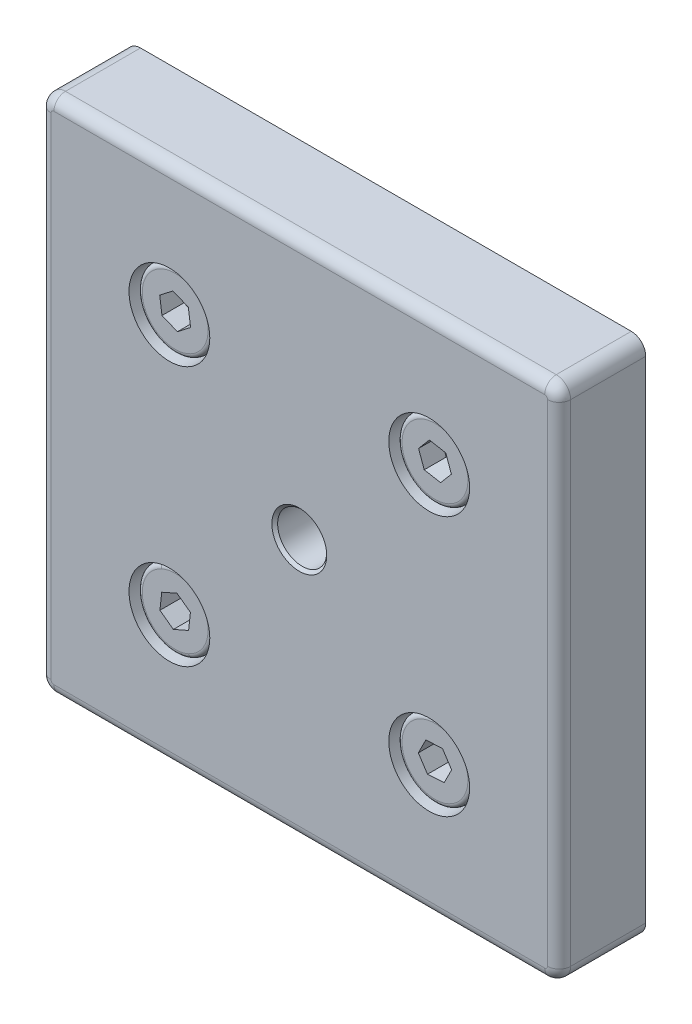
ISO-10303-21;
HEADER;
FILE_DESCRIPTION(('STEP AP214'),'2;1');
FILE_NAME('part.step','',(''),(''),'','','');
FILE_SCHEMA(('AUTOMOTIVE_DESIGN { 1 0 10303 214 1 1 1 1 }'));
ENDSEC;
DATA;
#1=APPLICATION_CONTEXT('core data for automotive mechanical design processes');
#2=APPLICATION_PROTOCOL_DEFINITION('international standard','automotive_design',2000,#1);
#3=PRODUCT_CONTEXT('',#1,'mechanical');
#4=PRODUCT('Part','Part','',(#3));
#5=PRODUCT_RELATED_PRODUCT_CATEGORY('part','',(#4));
#6=PRODUCT_DEFINITION_FORMATION('','',#4);
#7=PRODUCT_DEFINITION_CONTEXT('part definition',#1,'design');
#8=PRODUCT_DEFINITION('design','',#6,#7);
#9=PRODUCT_DEFINITION_SHAPE('','',#8);
#10=(LENGTH_UNIT() NAMED_UNIT(*) SI_UNIT(.MILLI.,.METRE.));
#11=(NAMED_UNIT(*) PLANE_ANGLE_UNIT() SI_UNIT($,.RADIAN.));
#12=(NAMED_UNIT(*) SI_UNIT($,.STERADIAN.) SOLID_ANGLE_UNIT());
#13=UNCERTAINTY_MEASURE_WITH_UNIT(LENGTH_MEASURE(1.E-05),#10,'distance_accuracy_value','');
#14=(GEOMETRIC_REPRESENTATION_CONTEXT(3) GLOBAL_UNCERTAINTY_ASSIGNED_CONTEXT((#13)) GLOBAL_UNIT_ASSIGNED_CONTEXT((#10,
#11,#12)) REPRESENTATION_CONTEXT('',''));
#15=CARTESIAN_POINT('',(0.,0.,0.));
#16=DIRECTION('',(0.,0.,1.));
#17=DIRECTION('',(1.,0.,0.));
#18=AXIS2_PLACEMENT_3D('',#15,#16,#17);
#19=CARTESIAN_POINT('',(-23.7017090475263,20.988987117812,10.2));
#20=DIRECTION('',(0.,0.,1.));
#21=DIRECTION('',(-0.990660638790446,-0.136350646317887,0.));
#22=AXIS2_PLACEMENT_3D('',#19,#20,#21);
#23=CONICAL_SURFACE('',#22,2.5,1.0471975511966);
#24=DIRECTION('',(0.857937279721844,0.118083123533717,0.5));
#25=VECTOR('',#24,1.);
#26=CARTESIAN_POINT('',(-21.2250574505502,21.3298637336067,10.2));
#27=LINE('',#26,#25);
#28=CARTESIAN_POINT('',(-23.7017090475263,20.988987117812,8.75662432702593));
#29=VERTEX_POINT('',#28);
#30=CARTESIAN_POINT('',(-21.2250574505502,21.3298637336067,10.2));
#31=VERTEX_POINT('',#30);
#32=EDGE_CURVE('P0_E333',#29,#31,#27,.T.);
#33=ORIENTED_EDGE('',*,*,#32,.F.);
#34=DIRECTION('',(-0.857937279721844,-0.118083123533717,0.5));
#35=VECTOR('',#34,1.);
#36=CARTESIAN_POINT('',(-26.1783606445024,20.6481105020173,10.2));
#37=LINE('',#36,#35);
#38=CARTESIAN_POINT('',(-26.1783606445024,20.6481105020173,10.2));
#39=VERTEX_POINT('',#38);
#40=EDGE_CURVE('P0_E336',#29,#39,#37,.T.);
#41=ORIENTED_EDGE('',*,*,#40,.T.);
#42=CARTESIAN_POINT('',(-23.7017090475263,20.988987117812,10.2));
#43=DIRECTION('',(0.,0.,1.));
#44=DIRECTION('',(-0.990660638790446,-0.136350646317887,0.));
#45=AXIS2_PLACEMENT_3D('',#42,#43,#44);
#46=CIRCLE('',#45,2.5);
#47=CARTESIAN_POINT('',(-24.6448270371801,18.67370561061,10.2));
#48=VERTEX_POINT('',#47);
#49=EDGE_CURVE('P0_E10',#39,#48,#46,.T.);
#50=ORIENTED_EDGE('',*,*,#49,.T.);
#51=CARTESIAN_POINT('',(-23.7017090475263,20.988987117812,10.2));
#52=DIRECTION('',(0.,0.,1.));
#53=DIRECTION('',(-0.990660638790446,-0.136350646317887,0.));
#54=AXIS2_PLACEMENT_3D('',#51,#52,#53);
#55=CIRCLE('',#54,2.5);
#56=CARTESIAN_POINT('',(-22.168175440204,19.0145822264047,10.2));
#57=VERTEX_POINT('',#56);
#58=EDGE_CURVE('P0_E26',#48,#57,#55,.T.);
#59=ORIENTED_EDGE('',*,*,#58,.T.);
#60=CARTESIAN_POINT('',(-23.7017090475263,20.988987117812,10.2));
#61=DIRECTION('',(0.,0.,1.));
#62=DIRECTION('',(-0.990660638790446,-0.136350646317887,0.));
#63=AXIS2_PLACEMENT_3D('',#60,#61,#62);
#64=CIRCLE('',#63,2.5);
#65=EDGE_CURVE('P0_E19',#57,#31,#64,.T.);
#66=ORIENTED_EDGE('',*,*,#65,.T.);
#67=EDGE_LOOP('',(#33,#41,#50,#59,#66));
#68=FACE_BOUND('',#67,.T.);
#69=ADVANCED_FACE('P0_F16',(#68),#23,.F.);
#70=CARTESIAN_POINT('',(-25.9815554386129,19.2182150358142,10.2));
#71=DIRECTION('',(0.,0.,1.));
#72=DIRECTION('',(-0.990660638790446,-0.136350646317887,0.));
#73=AXIS2_PLACEMENT_3D('',#70,#71,#72);
#74=PLANE('',#73);
#75=ORIENTED_EDGE('',*,*,#49,.F.);
#76=DIRECTION('',(0.136350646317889,-0.990660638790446,0.));
#77=VECTOR('',#76,1.);
#78=CARTESIAN_POINT('',(-26.3751658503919,22.0780059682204,10.2));
#79=LINE('',#78,#77);
#80=CARTESIAN_POINT('',(-25.9815554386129,19.2182150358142,10.2));
#81=VERTEX_POINT('',#80);
#82=EDGE_CURVE('P0_E294',#39,#81,#79,.T.);
#83=ORIENTED_EDGE('',*,*,#82,.T.);
#84=DIRECTION('',(-0.926112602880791,0.377247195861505,0.));
#85=VECTOR('',#84,1.);
#86=CARTESIAN_POINT('',(-23.3080986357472,18.1291961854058,10.2));
#87=LINE('',#86,#85);
#88=EDGE_CURVE('P0_E275',#48,#81,#87,.T.);
#89=ORIENTED_EDGE('',*,*,#88,.F.);
#90=EDGE_LOOP('',(#75,#83,#89));
#91=FACE_BOUND('',#90,.T.);
#92=ADVANCED_FACE('P0_F598',(#91),#74,.T.);
#93=CARTESIAN_POINT('',(-25.9815554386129,19.2182150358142,10.2));
#94=DIRECTION('',(0.,0.,1.));
#95=DIRECTION('',(-0.990660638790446,-0.136350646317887,0.));
#96=AXIS2_PLACEMENT_3D('',#93,#94,#95);
#97=PLANE('',#96);
#98=ORIENTED_EDGE('',*,*,#58,.F.);
#99=DIRECTION('',(-0.926112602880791,0.377247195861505,0.));
#100=VECTOR('',#99,1.);
#101=CARTESIAN_POINT('',(-23.3080986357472,18.1291961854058,10.2));
#102=LINE('',#101,#100);
#103=CARTESIAN_POINT('',(-23.3080986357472,18.1291961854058,10.2));
#104=VERTEX_POINT('',#103);
#105=EDGE_CURVE('P0_E271',#104,#48,#102,.T.);
#106=ORIENTED_EDGE('',*,*,#105,.F.);
#107=DIRECTION('',(0.789761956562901,0.613413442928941,0.));
#108=VECTOR('',#107,1.);
#109=CARTESIAN_POINT('',(-23.3080986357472,18.1291961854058,10.2));
#110=LINE('',#109,#108);
#111=EDGE_CURVE('P0_E207',#104,#57,#110,.T.);
#112=ORIENTED_EDGE('',*,*,#111,.T.);
#113=EDGE_LOOP('',(#98,#106,#112));
#114=FACE_BOUND('',#113,.T.);
#115=ADVANCED_FACE('P0_F599',(#114),#97,.T.);
#116=CARTESIAN_POINT('',(-25.9815554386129,19.2182150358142,10.2));
#117=DIRECTION('',(0.,0.,1.));
#118=DIRECTION('',(-0.990660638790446,-0.136350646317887,0.));
#119=AXIS2_PLACEMENT_3D('',#116,#117,#118);
#120=PLANE('',#119);
#121=ORIENTED_EDGE('',*,*,#65,.F.);
#122=DIRECTION('',(0.789761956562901,0.613413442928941,0.));
#123=VECTOR('',#122,1.);
#124=CARTESIAN_POINT('',(-23.3080986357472,18.1291961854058,10.2));
#125=LINE('',#124,#123);
#126=CARTESIAN_POINT('',(-21.0282522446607,19.8999682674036,10.2));
#127=VERTEX_POINT('',#126);
#128=EDGE_CURVE('P0_E205',#57,#127,#125,.T.);
#129=ORIENTED_EDGE('',*,*,#128,.T.);
#130=DIRECTION('',(-0.136350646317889,0.990660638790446,0.));
#131=VECTOR('',#130,1.);
#132=CARTESIAN_POINT('',(-21.0282522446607,19.8999682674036,10.2));
#133=LINE('',#132,#131);
#134=EDGE_CURVE('P0_E175',#127,#31,#133,.T.);
#135=ORIENTED_EDGE('',*,*,#134,.T.);
#136=EDGE_LOOP('',(#121,#129,#135));
#137=FACE_BOUND('',#136,.T.);
#138=ADVANCED_FACE('P0_F609',(#137),#120,.T.);
#139=CARTESIAN_POINT('',(-25.9815554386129,19.2182150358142,10.2));
#140=DIRECTION('',(0.,0.,1.));
#141=DIRECTION('',(-0.990660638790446,-0.136350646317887,0.));
#142=AXIS2_PLACEMENT_3D('',#139,#140,#141);
#143=PLANE('',#142);
#144=CARTESIAN_POINT('',(-23.7017090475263,20.988987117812,10.2));
#145=DIRECTION('',(0.,0.,1.));
#146=DIRECTION('',(-0.990660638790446,-0.136350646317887,0.));
#147=AXIS2_PLACEMENT_3D('',#144,#145,#146);
#148=CIRCLE('',#147,2.5);
#149=CARTESIAN_POINT('',(-22.7585910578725,23.304268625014,10.2));
#150=VERTEX_POINT('',#149);
#151=EDGE_CURVE('P0_E170',#31,#150,#148,.T.);
#152=ORIENTED_EDGE('',*,*,#151,.F.);
#153=DIRECTION('',(-0.136350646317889,0.990660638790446,0.));
#154=VECTOR('',#153,1.);
#155=CARTESIAN_POINT('',(-21.0282522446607,19.8999682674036,10.2));
#156=LINE('',#155,#154);
#157=CARTESIAN_POINT('',(-21.4218626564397,22.7597591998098,10.2));
#158=VERTEX_POINT('',#157);
#159=EDGE_CURVE('P0_E163',#31,#158,#156,.T.);
#160=ORIENTED_EDGE('',*,*,#159,.T.);
#161=DIRECTION('',(0.926112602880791,-0.377247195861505,0.));
#162=VECTOR('',#161,1.);
#163=CARTESIAN_POINT('',(-24.0953194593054,23.8487780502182,10.2));
#164=LINE('',#163,#162);
#165=EDGE_CURVE('P0_E167',#150,#158,#164,.T.);
#166=ORIENTED_EDGE('',*,*,#165,.F.);
#167=EDGE_LOOP('',(#152,#160,#166));
#168=FACE_BOUND('',#167,.T.);
#169=ADVANCED_FACE('P0_F165',(#168),#143,.T.);
#170=CARTESIAN_POINT('',(-25.9815554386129,19.2182150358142,10.2));
#171=DIRECTION('',(0.,0.,1.));
#172=DIRECTION('',(-0.990660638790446,-0.136350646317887,0.));
#173=AXIS2_PLACEMENT_3D('',#170,#171,#172);
#174=PLANE('',#173);
#175=CARTESIAN_POINT('',(-23.7017090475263,20.988987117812,10.2));
#176=DIRECTION('',(0.,0.,1.));
#177=DIRECTION('',(-0.990660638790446,-0.136350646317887,0.));
#178=AXIS2_PLACEMENT_3D('',#175,#176,#177);
#179=CIRCLE('',#178,2.5);
#180=CARTESIAN_POINT('',(-25.2352426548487,22.9633920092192,10.2));
#181=VERTEX_POINT('',#180);
#182=EDGE_CURVE('P0_E317',#150,#181,#179,.T.);
#183=ORIENTED_EDGE('',*,*,#182,.F.);
#184=DIRECTION('',(0.926112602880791,-0.377247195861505,0.));
#185=VECTOR('',#184,1.);
#186=CARTESIAN_POINT('',(-24.0953194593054,23.8487780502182,10.2));
#187=LINE('',#186,#185);
#188=CARTESIAN_POINT('',(-24.0953194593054,23.8487780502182,10.2));
#189=VERTEX_POINT('',#188);
#190=EDGE_CURVE('P0_E189',#189,#150,#187,.T.);
#191=ORIENTED_EDGE('',*,*,#190,.F.);
#192=DIRECTION('',(0.789761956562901,0.613413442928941,0.));
#193=VECTOR('',#192,1.);
#194=CARTESIAN_POINT('',(-26.3751658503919,22.0780059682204,10.2));
#195=LINE('',#194,#193);
#196=EDGE_CURVE('P0_E291',#181,#189,#195,.T.);
#197=ORIENTED_EDGE('',*,*,#196,.F.);
#198=EDGE_LOOP('',(#183,#191,#197));
#199=FACE_BOUND('',#198,.T.);
#200=ADVANCED_FACE('P0_F315',(#199),#174,.T.);
#201=CARTESIAN_POINT('',(-25.9815554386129,19.2182150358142,10.2));
#202=DIRECTION('',(0.,0.,1.));
#203=DIRECTION('',(-0.990660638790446,-0.136350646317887,0.));
#204=AXIS2_PLACEMENT_3D('',#201,#202,#203);
#205=PLANE('',#204);
#206=CARTESIAN_POINT('',(-23.7017090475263,20.988987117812,10.2));
#207=DIRECTION('',(0.,0.,1.));
#208=DIRECTION('',(-0.990660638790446,-0.136350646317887,0.));
#209=AXIS2_PLACEMENT_3D('',#206,#207,#208);
#210=CIRCLE('',#209,2.5);
#211=EDGE_CURVE('P0_E344',#181,#39,#210,.T.);
#212=ORIENTED_EDGE('',*,*,#211,.F.);
#213=DIRECTION('',(0.789761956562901,0.613413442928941,0.));
#214=VECTOR('',#213,1.);
#215=CARTESIAN_POINT('',(-26.3751658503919,22.0780059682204,10.2));
#216=LINE('',#215,#214);
#217=CARTESIAN_POINT('',(-26.3751658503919,22.0780059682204,10.2));
#218=VERTEX_POINT('',#217);
#219=EDGE_CURVE('P0_E302',#218,#181,#216,.T.);
#220=ORIENTED_EDGE('',*,*,#219,.F.);
#221=DIRECTION('',(0.136350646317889,-0.990660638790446,0.));
#222=VECTOR('',#221,1.);
#223=CARTESIAN_POINT('',(-26.3751658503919,22.0780059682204,10.2));
#224=LINE('',#223,#222);
#225=EDGE_CURVE('P0_E297',#218,#39,#224,.T.);
#226=ORIENTED_EDGE('',*,*,#225,.T.);
#227=EDGE_LOOP('',(#212,#220,#226));
#228=FACE_BOUND('',#227,.T.);
#229=ADVANCED_FACE('P0_F590',(#228),#205,.T.);
#230=CARTESIAN_POINT('',(-23.3080986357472,18.1291961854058,10.2));
#231=DIRECTION('',(0.613413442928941,-0.789761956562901,0.));
#232=DIRECTION('',(0.,0.,1.));
#233=AXIS2_PLACEMENT_3D('',#230,#231,#232);
#234=PLANE('',#233);
#235=DIRECTION('',(0.789761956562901,0.613413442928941,0.));
#236=VECTOR('',#235,1.);
#237=CARTESIAN_POINT('',(-23.3080986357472,18.1291961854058,14.));
#238=LINE('',#237,#236);
#239=CARTESIAN_POINT('',(-23.3080986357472,18.1291961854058,14.));
#240=VERTEX_POINT('',#239);
#241=CARTESIAN_POINT('',(-21.0282522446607,19.8999682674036,14.));
#242=VERTEX_POINT('',#241);
#243=EDGE_CURVE('P0_E260',#240,#242,#238,.T.);
#244=ORIENTED_EDGE('',*,*,#243,.T.);
#245=DIRECTION('',(0.,0.,1.));
#246=VECTOR('',#245,1.);
#247=CARTESIAN_POINT('',(-21.0282522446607,19.8999682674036,10.2));
#248=LINE('',#247,#246);
#249=EDGE_CURVE('P0_E203',#127,#242,#248,.T.);
#250=ORIENTED_EDGE('',*,*,#249,.F.);
#251=ORIENTED_EDGE('',*,*,#128,.F.);
#252=ORIENTED_EDGE('',*,*,#111,.F.);
#253=DIRECTION('',(0.,0.,1.));
#254=VECTOR('',#253,1.);
#255=CARTESIAN_POINT('',(-23.3080986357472,18.1291961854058,10.2));
#256=LINE('',#255,#254);
#257=EDGE_CURVE('P0_E276',#104,#240,#256,.T.);
#258=ORIENTED_EDGE('',*,*,#257,.T.);
#259=EDGE_LOOP('',(#244,#250,#251,#252,#258));
#260=FACE_BOUND('',#259,.T.);
#261=ADVANCED_FACE('P0_F606',(#260),#234,.F.);
#262=CARTESIAN_POINT('',(-21.0282522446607,19.8999682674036,10.2));
#263=DIRECTION('',(0.990660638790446,0.136350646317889,0.));
#264=DIRECTION('',(-0.136350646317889,0.990660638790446,0.));
#265=AXIS2_PLACEMENT_3D('',#262,#263,#264);
#266=PLANE('',#265);
#267=DIRECTION('',(-0.136350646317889,0.990660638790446,0.));
#268=VECTOR('',#267,1.);
#269=CARTESIAN_POINT('',(-21.0282522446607,19.8999682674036,14.));
#270=LINE('',#269,#268);
#271=CARTESIAN_POINT('',(-21.4218626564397,22.7597591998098,14.));
#272=VERTEX_POINT('',#271);
#273=EDGE_CURVE('P0_E181',#242,#272,#270,.T.);
#274=ORIENTED_EDGE('',*,*,#273,.T.);
#275=DIRECTION('',(0.,0.,1.));
#276=VECTOR('',#275,1.);
#277=CARTESIAN_POINT('',(-21.4218626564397,22.7597591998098,10.2));
#278=LINE('',#277,#276);
#279=EDGE_CURVE('P0_E176',#158,#272,#278,.T.);
#280=ORIENTED_EDGE('',*,*,#279,.F.);
#281=ORIENTED_EDGE('',*,*,#159,.F.);
#282=ORIENTED_EDGE('',*,*,#134,.F.);
#283=ORIENTED_EDGE('',*,*,#249,.T.);
#284=EDGE_LOOP('',(#274,#280,#281,#282,#283));
#285=FACE_BOUND('',#284,.T.);
#286=ADVANCED_FACE('P0_F179',(#285),#266,.F.);
#287=CARTESIAN_POINT('',(-24.0953194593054,23.8487780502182,10.2));
#288=DIRECTION('',(-0.377247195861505,-0.926112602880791,0.));
#289=DIRECTION('',(0.,0.,-1.));
#290=AXIS2_PLACEMENT_3D('',#287,#288,#289);
#291=PLANE('',#290);
#292=DIRECTION('',(0.926112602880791,-0.377247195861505,0.));
#293=VECTOR('',#292,1.);
#294=CARTESIAN_POINT('',(-24.0953194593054,23.8487780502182,14.));
#295=LINE('',#294,#293);
#296=CARTESIAN_POINT('',(-24.0953194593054,23.8487780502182,14.));
#297=VERTEX_POINT('',#296);
#298=EDGE_CURVE('P0_E254',#297,#272,#295,.T.);
#299=ORIENTED_EDGE('',*,*,#298,.F.);
#300=DIRECTION('',(0.,0.,1.));
#301=VECTOR('',#300,1.);
#302=CARTESIAN_POINT('',(-24.0953194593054,23.8487780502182,10.2));
#303=LINE('',#302,#301);
#304=EDGE_CURVE('P0_E197',#189,#297,#303,.T.);
#305=ORIENTED_EDGE('',*,*,#304,.F.);
#306=ORIENTED_EDGE('',*,*,#190,.T.);
#307=ORIENTED_EDGE('',*,*,#165,.T.);
#308=ORIENTED_EDGE('',*,*,#279,.T.);
#309=EDGE_LOOP('',(#299,#305,#306,#307,#308));
#310=FACE_BOUND('',#309,.T.);
#311=ADVANCED_FACE('P0_F187',(#310),#291,.T.);
#312=CARTESIAN_POINT('',(-26.3751658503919,22.0780059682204,10.2));
#313=DIRECTION('',(0.613413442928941,-0.789761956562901,0.));
#314=DIRECTION('',(0.,0.,1.));
#315=AXIS2_PLACEMENT_3D('',#312,#313,#314);
#316=PLANE('',#315);
#317=DIRECTION('',(0.789761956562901,0.613413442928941,0.));
#318=VECTOR('',#317,1.);
#319=CARTESIAN_POINT('',(-26.3751658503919,22.0780059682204,14.));
#320=LINE('',#319,#318);
#321=CARTESIAN_POINT('',(-26.3751658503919,22.0780059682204,14.));
#322=VERTEX_POINT('',#321);
#323=EDGE_CURVE('P0_E257',#322,#297,#320,.T.);
#324=ORIENTED_EDGE('',*,*,#323,.F.);
#325=DIRECTION('',(0.,0.,1.));
#326=VECTOR('',#325,1.);
#327=CARTESIAN_POINT('',(-26.3751658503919,22.0780059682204,10.2));
#328=LINE('',#327,#326);
#329=EDGE_CURVE('P0_E301',#218,#322,#328,.T.);
#330=ORIENTED_EDGE('',*,*,#329,.F.);
#331=ORIENTED_EDGE('',*,*,#219,.T.);
#332=ORIENTED_EDGE('',*,*,#196,.T.);
#333=ORIENTED_EDGE('',*,*,#304,.T.);
#334=EDGE_LOOP('',(#324,#330,#331,#332,#333));
#335=FACE_BOUND('',#334,.T.);
#336=ADVANCED_FACE('P0_F311',(#335),#316,.T.);
#337=CARTESIAN_POINT('',(-26.3751658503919,22.0780059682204,10.2));
#338=DIRECTION('',(-0.990660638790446,-0.136350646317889,0.));
#339=DIRECTION('',(-0.136350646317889,0.990660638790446,0.));
#340=AXIS2_PLACEMENT_3D('',#337,#338,#339);
#341=PLANE('',#340);
#342=DIRECTION('',(0.136350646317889,-0.990660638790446,0.));
#343=VECTOR('',#342,1.);
#344=CARTESIAN_POINT('',(-26.3751658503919,22.0780059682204,14.));
#345=LINE('',#344,#343);
#346=CARTESIAN_POINT('',(-25.9815554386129,19.2182150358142,14.));
#347=VERTEX_POINT('',#346);
#348=EDGE_CURVE('P0_E251',#322,#347,#345,.T.);
#349=ORIENTED_EDGE('',*,*,#348,.T.);
#350=DIRECTION('',(0.,0.,1.));
#351=VECTOR('',#350,1.);
#352=CARTESIAN_POINT('',(-25.9815554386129,19.2182150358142,10.2));
#353=LINE('',#352,#351);
#354=EDGE_CURVE('P0_E288',#81,#347,#353,.T.);
#355=ORIENTED_EDGE('',*,*,#354,.F.);
#356=ORIENTED_EDGE('',*,*,#82,.F.);
#357=ORIENTED_EDGE('',*,*,#225,.F.);
#358=ORIENTED_EDGE('',*,*,#329,.T.);
#359=EDGE_LOOP('',(#349,#355,#356,#357,#358));
#360=FACE_BOUND('',#359,.T.);
#361=ADVANCED_FACE('P0_F595',(#360),#341,.F.);
#362=CARTESIAN_POINT('',(-23.3080986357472,18.1291961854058,10.2));
#363=DIRECTION('',(0.377247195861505,0.926112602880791,0.));
#364=DIRECTION('',(0.926112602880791,-0.377247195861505,0.));
#365=AXIS2_PLACEMENT_3D('',#362,#363,#364);
#366=PLANE('',#365);
#367=DIRECTION('',(-0.926112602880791,0.377247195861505,0.));
#368=VECTOR('',#367,1.);
#369=CARTESIAN_POINT('',(-23.3080986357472,18.1291961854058,14.));
#370=LINE('',#369,#368);
#371=EDGE_CURVE('P0_E247',#240,#347,#370,.T.);
#372=ORIENTED_EDGE('',*,*,#371,.F.);
#373=ORIENTED_EDGE('',*,*,#257,.F.);
#374=ORIENTED_EDGE('',*,*,#105,.T.);
#375=ORIENTED_EDGE('',*,*,#88,.T.);
#376=ORIENTED_EDGE('',*,*,#354,.T.);
#377=EDGE_LOOP('',(#372,#373,#374,#375,#376));
#378=FACE_BOUND('',#377,.T.);
#379=ADVANCED_FACE('P0_F603',(#378),#366,.T.);
#380=CARTESIAN_POINT('',(-23.7017090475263,20.988987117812,13.2));
#381=DIRECTION('',(0.,0.,1.));
#382=DIRECTION('',(-0.990660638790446,-0.136350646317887,0.));
#383=AXIS2_PLACEMENT_3D('',#380,#381,#382);
#384=TOROIDAL_SURFACE('',#383,5.7,0.8);
#385=CARTESIAN_POINT('',(-18.0549434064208,21.766185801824,13.2));
#386=DIRECTION('',(0.136350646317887,-0.990660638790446,0.));
#387=DIRECTION('',(-0.990660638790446,-0.136350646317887,0.));
#388=AXIS2_PLACEMENT_3D('',#385,#386,#387);
#389=CIRCLE('',#388,0.8);
#390=CARTESIAN_POINT('',(-17.2624148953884,21.8752663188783,13.2));
#391=VERTEX_POINT('',#390);
#392=CARTESIAN_POINT('',(-18.0549434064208,21.766185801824,14.));
#393=VERTEX_POINT('',#392);
#394=EDGE_CURVE('P0_E343',#391,#393,#389,.T.);
#395=ORIENTED_EDGE('',*,*,#394,.F.);
#396=CARTESIAN_POINT('',(-23.7017090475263,20.988987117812,13.2));
#397=DIRECTION('',(0.,0.,-1.));
#398=DIRECTION('',(-0.990660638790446,-0.136350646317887,0.));
#399=AXIS2_PLACEMENT_3D('',#396,#397,#398);
#400=CIRCLE('',#399,6.5);
#401=CARTESIAN_POINT('',(-30.1410031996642,20.1027079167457,13.2));
#402=VERTEX_POINT('',#401);
#403=EDGE_CURVE('P0_E267',#402,#391,#400,.T.);
#404=ORIENTED_EDGE('',*,*,#403,.F.);
#405=CARTESIAN_POINT('',(-29.3484746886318,20.2117884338,13.2));
#406=DIRECTION('',(-0.136350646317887,0.990660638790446,0.));
#407=DIRECTION('',(0.990660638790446,0.136350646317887,0.));
#408=AXIS2_PLACEMENT_3D('',#405,#406,#407);
#409=CIRCLE('',#408,0.8);
#410=CARTESIAN_POINT('',(-29.3484746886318,20.2117884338,14.));
#411=VERTEX_POINT('',#410);
#412=EDGE_CURVE('P0_E362',#402,#411,#409,.T.);
#413=ORIENTED_EDGE('',*,*,#412,.T.);
#414=CARTESIAN_POINT('',(-23.7017090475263,20.988987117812,14.));
#415=DIRECTION('',(0.,0.,1.));
#416=DIRECTION('',(-0.990660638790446,-0.136350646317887,0.));
#417=AXIS2_PLACEMENT_3D('',#414,#415,#416);
#418=CIRCLE('',#417,5.7);
#419=EDGE_CURVE('P0_E244',#393,#411,#418,.T.);
#420=ORIENTED_EDGE('',*,*,#419,.F.);
#421=EDGE_LOOP('',(#395,#404,#413,#420));
#422=FACE_BOUND('',#421,.T.);
#423=ADVANCED_FACE('P0_F640',(#422),#384,.T.);
#424=CARTESIAN_POINT('',(-23.7017090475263,20.988987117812,8.6));
#425=DIRECTION('',(0.,0.,-1.));
#426=DIRECTION('',(0.990660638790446,0.136350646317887,0.));
#427=AXIS2_PLACEMENT_3D('',#424,#425,#426);
#428=TOROIDAL_SURFACE('',#427,4.39999999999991,0.4);
#429=CARTESIAN_POINT('',(-28.0606158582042,20.3890442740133,8.6));
#430=DIRECTION('',(0.136350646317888,-0.990660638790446,0.));
#431=DIRECTION('',(-0.990660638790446,-0.136350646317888,0.));
#432=AXIS2_PLACEMENT_3D('',#429,#430,#431);
#433=CIRCLE('',#432,0.4);
#434=CARTESIAN_POINT('',(-27.664351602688,20.4435845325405,8.6));
#435=VERTEX_POINT('',#434);
#436=CARTESIAN_POINT('',(-28.0606158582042,20.3890442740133,9.));
#437=VERTEX_POINT('',#436);
#438=EDGE_CURVE('P0_E372',#435,#437,#433,.T.);
#439=ORIENTED_EDGE('',*,*,#438,.F.);
#440=CARTESIAN_POINT('',(-23.7017090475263,20.988987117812,8.6));
#441=DIRECTION('',(0.,0.,-1.));
#442=DIRECTION('',(0.990660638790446,0.136350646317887,0.));
#443=AXIS2_PLACEMENT_3D('',#440,#441,#442);
#444=CIRCLE('',#443,3.99999999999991);
#445=CARTESIAN_POINT('',(-19.7390664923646,21.5343897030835,8.6));
#446=VERTEX_POINT('',#445);
#447=EDGE_CURVE('P0_E227',#446,#435,#444,.T.);
#448=ORIENTED_EDGE('',*,*,#447,.F.);
#449=CARTESIAN_POINT('',(-19.3428022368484,21.5889299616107,8.6));
#450=DIRECTION('',(-0.136350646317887,0.990660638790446,0.));
#451=DIRECTION('',(0.990660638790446,0.136350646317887,0.));
#452=AXIS2_PLACEMENT_3D('',#449,#450,#451);
#453=CIRCLE('',#452,0.4);
#454=CARTESIAN_POINT('',(-19.3428022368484,21.5889299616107,9.));
#455=VERTEX_POINT('',#454);
#456=EDGE_CURVE('P0_E354',#446,#455,#453,.T.);
#457=ORIENTED_EDGE('',*,*,#456,.T.);
#458=CARTESIAN_POINT('',(-23.7017090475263,20.988987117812,9.));
#459=DIRECTION('',(0.,0.,1.));
#460=DIRECTION('',(0.990660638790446,0.136350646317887,0.));
#461=AXIS2_PLACEMENT_3D('',#458,#459,#460);
#462=CIRCLE('',#461,4.39999999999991);
#463=EDGE_CURVE('P0_E270',#437,#455,#462,.T.);
#464=ORIENTED_EDGE('',*,*,#463,.F.);
#465=EDGE_LOOP('',(#439,#448,#457,#464));
#466=FACE_BOUND('',#465,.T.);
#467=ADVANCED_FACE('P0_F643',(#466),#428,.F.);
#468=CARTESIAN_POINT('',(-23.2504565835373,17.710395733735,-16.));
#469=DIRECTION('',(0.,0.,-1.));
#470=DIRECTION('',(0.136350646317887,-0.990660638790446,0.));
#471=AXIS2_PLACEMENT_3D('',#468,#469,#470);
#472=PLANE('',#471);
#473=CARTESIAN_POINT('',(-23.7017090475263,20.988987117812,-16.));
#474=DIRECTION('',(0.,0.,1.));
#475=DIRECTION('',(-0.990660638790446,-0.136350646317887,0.));
#476=AXIS2_PLACEMENT_3D('',#473,#474,#475);
#477=CIRCLE('',#476,3.3095);
#478=CARTESIAN_POINT('',(-26.9803004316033,20.537734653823,-16.));
#479=VERTEX_POINT('',#478);
#480=CARTESIAN_POINT('',(-20.4231176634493,21.4402395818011,-16.));
#481=VERTEX_POINT('',#480);
#482=EDGE_CURVE('P0_E350',#479,#481,#477,.T.);
#483=ORIENTED_EDGE('',*,*,#482,.F.);
#484=CARTESIAN_POINT('',(-23.7017090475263,20.988987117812,-16.));
#485=DIRECTION('',(0.,0.,1.));
#486=DIRECTION('',(-0.990660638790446,-0.136350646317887,0.));
#487=AXIS2_PLACEMENT_3D('',#484,#485,#486);
#488=CIRCLE('',#487,3.3095);
#489=EDGE_CURVE('P0_E280',#481,#479,#488,.T.);
#490=ORIENTED_EDGE('',*,*,#489,.F.);
#491=EDGE_LOOP('',(#483,#490));
#492=FACE_BOUND('',#491,.T.);
#493=ADVANCED_FACE('P0_F649',(#492),#472,.T.);
#494=CARTESIAN_POINT('',(-23.7017090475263,20.988987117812,-16.));
#495=DIRECTION('',(0.,0.,1.));
#496=DIRECTION('',(-0.990660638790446,-0.136350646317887,0.));
#497=AXIS2_PLACEMENT_3D('',#494,#495,#496);
#498=CONICAL_SURFACE('',#497,3.3095,0.785398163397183);
#499=DIRECTION('',(0.700502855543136,0.0964144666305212,0.707106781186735));
#500=VECTOR('',#499,1.);
#501=CARTESIAN_POINT('',(-20.4231176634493,21.4402395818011,-16.));
#502=LINE('',#501,#500);
#503=CARTESIAN_POINT('',(-19.7390664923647,21.5343897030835,-15.3095));
#504=VERTEX_POINT('',#503);
#505=EDGE_CURVE('P0_E345',#481,#504,#502,.T.);
#506=ORIENTED_EDGE('',*,*,#505,.F.);
#507=ORIENTED_EDGE('',*,*,#489,.T.);
#508=DIRECTION('',(-0.700502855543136,-0.0964144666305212,0.707106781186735));
#509=VECTOR('',#508,1.);
#510=CARTESIAN_POINT('',(-26.9803004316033,20.537734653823,-16.));
#511=LINE('',#510,#509);
#512=CARTESIAN_POINT('',(-27.6643516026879,20.4435845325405,-15.3095));
#513=VERTEX_POINT('',#512);
#514=EDGE_CURVE('P0_E384',#479,#513,#511,.T.);
#515=ORIENTED_EDGE('',*,*,#514,.T.);
#516=CARTESIAN_POINT('',(-23.7017090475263,20.988987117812,-15.3095));
#517=DIRECTION('',(0.,0.,1.));
#518=DIRECTION('',(-0.990660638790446,-0.136350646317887,0.));
#519=AXIS2_PLACEMENT_3D('',#516,#517,#518);
#520=CIRCLE('',#519,3.99999999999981);
#521=EDGE_CURVE('P0_E277',#504,#513,#520,.T.);
#522=ORIENTED_EDGE('',*,*,#521,.F.);
#523=EDGE_LOOP('',(#506,#507,#515,#522));
#524=FACE_BOUND('',#523,.T.);
#525=ADVANCED_FACE('P0_F653',(#524),#498,.T.);
#526=CARTESIAN_POINT('',(-23.7017090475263,20.988987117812,45.75));
#527=DIRECTION('',(0.,0.,1.));
#528=DIRECTION('',(-0.990660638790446,-0.136350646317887,0.));
#529=AXIS2_PLACEMENT_3D('',#526,#527,#528);
#530=CYLINDRICAL_SURFACE('',#529,3.99999999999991);
#531=DIRECTION('',(0.,0.,1.));
#532=VECTOR('',#531,1.);
#533=CARTESIAN_POINT('',(-19.7390664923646,21.5343897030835,45.75));
#534=LINE('',#533,#532);
#535=EDGE_CURVE('P0_E225',#504,#446,#534,.T.);
#536=ORIENTED_EDGE('',*,*,#535,.F.);
#537=ORIENTED_EDGE('',*,*,#521,.T.);
#538=DIRECTION('',(0.,0.,1.));
#539=VECTOR('',#538,1.);
#540=CARTESIAN_POINT('',(-27.664351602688,20.4435845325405,45.75));
#541=LINE('',#540,#539);
#542=EDGE_CURVE('P0_E231',#513,#435,#541,.T.);
#543=ORIENTED_EDGE('',*,*,#542,.T.);
#544=CARTESIAN_POINT('',(-23.7017090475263,20.988987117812,8.6));
#545=DIRECTION('',(0.,0.,-1.));
#546=DIRECTION('',(0.990660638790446,0.136350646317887,0.));
#547=AXIS2_PLACEMENT_3D('',#544,#545,#546);
#548=CIRCLE('',#547,3.99999999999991);
#549=EDGE_CURVE('P0_E366',#435,#446,#548,.T.);
#550=ORIENTED_EDGE('',*,*,#549,.T.);
#551=EDGE_LOOP('',(#536,#537,#543,#550));
#552=FACE_BOUND('',#551,.T.);
#553=ADVANCED_FACE('P0_F414',(#552),#530,.T.);
#554=CARTESIAN_POINT('',(-22.81542984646,14.5496929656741,9.));
#555=DIRECTION('',(0.,0.,-1.));
#556=DIRECTION('',(0.136350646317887,-0.990660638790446,0.));
#557=AXIS2_PLACEMENT_3D('',#554,#555,#556);
#558=PLANE('',#557);
#559=CARTESIAN_POINT('',(-23.7017090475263,20.988987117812,9.));
#560=DIRECTION('',(0.,0.,1.));
#561=DIRECTION('',(0.990660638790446,0.136350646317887,0.));
#562=AXIS2_PLACEMENT_3D('',#559,#560,#561);
#563=CIRCLE('',#562,4.39999999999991);
#564=EDGE_CURVE('P0_E376',#455,#437,#563,.T.);
#565=ORIENTED_EDGE('',*,*,#564,.T.);
#566=ORIENTED_EDGE('',*,*,#463,.T.);
#567=EDGE_LOOP('',(#565,#566));
#568=FACE_BOUND('',#567,.T.);
#569=CARTESIAN_POINT('',(-23.7017090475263,20.988987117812,9.));
#570=DIRECTION('',(0.,0.,1.));
#571=DIRECTION('',(-0.990660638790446,-0.136350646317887,0.));
#572=AXIS2_PLACEMENT_3D('',#569,#570,#571);
#573=CIRCLE('',#572,6.5);
#574=CARTESIAN_POINT('',(-30.1410031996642,20.1027079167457,9.));
#575=VERTEX_POINT('',#574);
#576=CARTESIAN_POINT('',(-17.2624148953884,21.8752663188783,9.));
#577=VERTEX_POINT('',#576);
#578=EDGE_CURVE('P0_E235',#575,#577,#573,.T.);
#579=ORIENTED_EDGE('',*,*,#578,.F.);
#580=CARTESIAN_POINT('',(-23.7017090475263,20.988987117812,9.));
#581=DIRECTION('',(0.,0.,1.));
#582=DIRECTION('',(-0.990660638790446,-0.136350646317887,0.));
#583=AXIS2_PLACEMENT_3D('',#580,#581,#582);
#584=CIRCLE('',#583,6.5);
#585=EDGE_CURVE('P0_E264',#577,#575,#584,.T.);
#586=ORIENTED_EDGE('',*,*,#585,.F.);
#587=EDGE_LOOP('',(#579,#586));
#588=FACE_BOUND('',#587,.T.);
#589=ADVANCED_FACE('P0_F659',(#568,#588),#558,.T.);
#590=CARTESIAN_POINT('',(-23.7017090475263,20.988987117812,45.75));
#591=DIRECTION('',(0.,0.,1.));
#592=DIRECTION('',(-0.990660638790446,-0.136350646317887,0.));
#593=AXIS2_PLACEMENT_3D('',#590,#591,#592);
#594=CYLINDRICAL_SURFACE('',#593,6.5);
#595=DIRECTION('',(0.,0.,1.));
#596=VECTOR('',#595,1.);
#597=CARTESIAN_POINT('',(-17.2624148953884,21.8752663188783,45.75));
#598=LINE('',#597,#596);
#599=EDGE_CURVE('P0_E236',#577,#391,#598,.T.);
#600=ORIENTED_EDGE('',*,*,#599,.F.);
#601=ORIENTED_EDGE('',*,*,#585,.T.);
#602=DIRECTION('',(0.,0.,1.));
#603=VECTOR('',#602,1.);
#604=CARTESIAN_POINT('',(-30.1410031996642,20.1027079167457,45.75));
#605=LINE('',#604,#603);
#606=EDGE_CURVE('P0_E240',#575,#402,#605,.T.);
#607=ORIENTED_EDGE('',*,*,#606,.T.);
#608=ORIENTED_EDGE('',*,*,#403,.T.);
#609=EDGE_LOOP('',(#600,#601,#607,#608));
#610=FACE_BOUND('',#609,.T.);
#611=ADVANCED_FACE('P0_F662',(#610),#594,.T.);
#612=CARTESIAN_POINT('',(-23.7017090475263,20.988987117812,14.));
#613=DIRECTION('',(0.,0.,1.));
#614=DIRECTION('',(-0.990660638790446,-0.136350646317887,0.));
#615=AXIS2_PLACEMENT_3D('',#612,#613,#614);
#616=PLANE('',#615);
#617=ORIENTED_EDGE('',*,*,#371,.T.);
#618=ORIENTED_EDGE('',*,*,#348,.F.);
#619=ORIENTED_EDGE('',*,*,#323,.T.);
#620=ORIENTED_EDGE('',*,*,#298,.T.);
#621=ORIENTED_EDGE('',*,*,#273,.F.);
#622=ORIENTED_EDGE('',*,*,#243,.F.);
#623=EDGE_LOOP('',(#617,#618,#619,#620,#621,#622));
#624=FACE_BOUND('',#623,.T.);
#625=CARTESIAN_POINT('',(-23.7017090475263,20.988987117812,14.));
#626=DIRECTION('',(0.,0.,1.));
#627=DIRECTION('',(-0.990660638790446,-0.136350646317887,0.));
#628=AXIS2_PLACEMENT_3D('',#625,#626,#627);
#629=CIRCLE('',#628,5.7);
#630=EDGE_CURVE('P0_E358',#411,#393,#629,.T.);
#631=ORIENTED_EDGE('',*,*,#630,.T.);
#632=ORIENTED_EDGE('',*,*,#419,.T.);
#633=EDGE_LOOP('',(#631,#632));
#634=FACE_BOUND('',#633,.T.);
#635=ADVANCED_FACE('P0_F321',(#624,#634),#616,.T.);
#636=CARTESIAN_POINT('',(-23.7017090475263,20.988987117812,45.75));
#637=DIRECTION('',(0.,0.,1.));
#638=DIRECTION('',(-0.990660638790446,-0.136350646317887,0.));
#639=AXIS2_PLACEMENT_3D('',#636,#637,#638);
#640=CYLINDRICAL_SURFACE('',#639,6.5);
#641=ORIENTED_EDGE('',*,*,#578,.T.);
#642=ORIENTED_EDGE('',*,*,#599,.T.);
#643=CARTESIAN_POINT('',(-23.7017090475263,20.988987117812,13.2));
#644=DIRECTION('',(0.,0.,-1.));
#645=DIRECTION('',(-0.990660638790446,-0.136350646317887,0.));
#646=AXIS2_PLACEMENT_3D('',#643,#644,#645);
#647=CIRCLE('',#646,6.5);
#648=EDGE_CURVE('P0_E339',#391,#402,#647,.T.);
#649=ORIENTED_EDGE('',*,*,#648,.T.);
#650=ORIENTED_EDGE('',*,*,#606,.F.);
#651=EDGE_LOOP('',(#641,#642,#649,#650));
#652=FACE_BOUND('',#651,.T.);
#653=ADVANCED_FACE('P0_F669',(#652),#640,.T.);
#654=CARTESIAN_POINT('',(-23.7017090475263,20.988987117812,45.75));
#655=DIRECTION('',(0.,0.,1.));
#656=DIRECTION('',(-0.990660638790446,-0.136350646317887,0.));
#657=AXIS2_PLACEMENT_3D('',#654,#655,#656);
#658=CYLINDRICAL_SURFACE('',#657,3.99999999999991);
#659=CARTESIAN_POINT('',(-23.7017090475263,20.988987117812,-15.3095));
#660=DIRECTION('',(0.,0.,1.));
#661=DIRECTION('',(-0.990660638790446,-0.136350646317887,0.));
#662=AXIS2_PLACEMENT_3D('',#659,#660,#661);
#663=CIRCLE('',#662,3.99999999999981);
#664=EDGE_CURVE('P0_E349',#513,#504,#663,.T.);
#665=ORIENTED_EDGE('',*,*,#664,.T.);
#666=ORIENTED_EDGE('',*,*,#535,.T.);
#667=ORIENTED_EDGE('',*,*,#447,.T.);
#668=ORIENTED_EDGE('',*,*,#542,.F.);
#669=EDGE_LOOP('',(#665,#666,#667,#668));
#670=FACE_BOUND('',#669,.T.);
#671=ADVANCED_FACE('P0_F673',(#670),#658,.T.);
#672=CARTESIAN_POINT('',(-23.7017090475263,20.988987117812,-16.));
#673=DIRECTION('',(0.,0.,1.));
#674=DIRECTION('',(-0.990660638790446,-0.136350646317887,0.));
#675=AXIS2_PLACEMENT_3D('',#672,#673,#674);
#676=CONICAL_SURFACE('',#675,3.3095,0.785398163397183);
#677=ORIENTED_EDGE('',*,*,#482,.T.);
#678=ORIENTED_EDGE('',*,*,#505,.T.);
#679=ORIENTED_EDGE('',*,*,#664,.F.);
#680=ORIENTED_EDGE('',*,*,#514,.F.);
#681=EDGE_LOOP('',(#677,#678,#679,#680));
#682=FACE_BOUND('',#681,.T.);
#683=ADVANCED_FACE('P0_F670',(#682),#676,.T.);
#684=CARTESIAN_POINT('',(-23.7017090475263,20.988987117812,8.6));
#685=DIRECTION('',(0.,0.,-1.));
#686=DIRECTION('',(0.990660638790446,0.136350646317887,0.));
#687=AXIS2_PLACEMENT_3D('',#684,#685,#686);
#688=TOROIDAL_SURFACE('',#687,4.39999999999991,0.4);
#689=ORIENTED_EDGE('',*,*,#549,.F.);
#690=ORIENTED_EDGE('',*,*,#438,.T.);
#691=ORIENTED_EDGE('',*,*,#564,.F.);
#692=ORIENTED_EDGE('',*,*,#456,.F.);
#693=EDGE_LOOP('',(#689,#690,#691,#692));
#694=FACE_BOUND('',#693,.T.);
#695=ADVANCED_FACE('P0_F417',(#694),#688,.F.);
#696=CARTESIAN_POINT('',(-23.7017090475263,20.988987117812,13.2));
#697=DIRECTION('',(0.,0.,1.));
#698=DIRECTION('',(-0.990660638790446,-0.136350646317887,0.));
#699=AXIS2_PLACEMENT_3D('',#696,#697,#698);
#700=TOROIDAL_SURFACE('',#699,5.7,0.8);
#701=ORIENTED_EDGE('',*,*,#648,.F.);
#702=ORIENTED_EDGE('',*,*,#394,.T.);
#703=ORIENTED_EDGE('',*,*,#630,.F.);
#704=ORIENTED_EDGE('',*,*,#412,.F.);
#705=EDGE_LOOP('',(#701,#702,#703,#704));
#706=FACE_BOUND('',#705,.T.);
#707=ADVANCED_FACE('P0_F680',(#706),#700,.T.);
#708=CARTESIAN_POINT('',(-23.7017090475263,20.988987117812,10.2));
#709=DIRECTION('',(0.,0.,1.));
#710=DIRECTION('',(-0.990660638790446,-0.136350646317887,0.));
#711=AXIS2_PLACEMENT_3D('',#708,#709,#710);
#712=CONICAL_SURFACE('',#711,2.5,1.0471975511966);
#713=ORIENTED_EDGE('',*,*,#40,.F.);
#714=ORIENTED_EDGE('',*,*,#32,.T.);
#715=ORIENTED_EDGE('',*,*,#151,.T.);
#716=ORIENTED_EDGE('',*,*,#182,.T.);
#717=ORIENTED_EDGE('',*,*,#211,.T.);
#718=EDGE_LOOP('',(#713,#714,#715,#716,#717));
#719=FACE_BOUND('',#718,.T.);
#720=ADVANCED_FACE('P0_F588',(#719),#712,.F.);
#721=CLOSED_SHELL('',(#69,#92,#115,#138,#169,#200,#229,#261,#286,#311,#336,#361,#379,#423,#467,
#493,#525,#553,#589,#611,#635,#653,#671,#683,#695,#707,#720));
#722=MANIFOLD_SOLID_BREP('P0_B1',#721);
#723=CARTESIAN_POINT('',(21.2982909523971,20.9889871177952,10.2));
#724=DIRECTION('',(0.,0.,1.));
#725=DIRECTION('',(0.177244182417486,0.984166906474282,0.));
#726=AXIS2_PLACEMENT_3D('',#723,#724,#725);
#727=CONICAL_SURFACE('',#726,2.5,1.0471975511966);
#728=DIRECTION('',(-0.153497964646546,-0.85231354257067,0.5));
#729=VECTOR('',#728,1.);
#730=CARTESIAN_POINT('',(20.8551804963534,18.5285698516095,10.2));
#731=LINE('',#730,#729);
#732=CARTESIAN_POINT('',(21.2982909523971,20.9889871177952,8.75662432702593));
#733=VERTEX_POINT('',#732);
#734=CARTESIAN_POINT('',(20.8551804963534,18.5285698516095,10.2));
#735=VERTEX_POINT('',#734);
#736=EDGE_CURVE('P1_E334',#733,#735,#731,.T.);
#737=ORIENTED_EDGE('',*,*,#736,.F.);
#738=DIRECTION('',(0.153497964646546,0.85231354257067,0.5));
#739=VECTOR('',#738,1.);
#740=CARTESIAN_POINT('',(21.7414014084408,23.4494043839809,10.2));
#741=LINE('',#740,#739);
#742=CARTESIAN_POINT('',(21.7414014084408,23.4494043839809,10.2));
#743=VERTEX_POINT('',#742);
#744=EDGE_CURVE('P1_E337',#733,#743,#741,.T.);
#745=ORIENTED_EDGE('',*,*,#744,.T.);
#746=CARTESIAN_POINT('',(21.2982909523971,20.9889871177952,10.2));
#747=DIRECTION('',(0.,0.,1.));
#748=DIRECTION('',(0.177244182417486,0.984166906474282,0.));
#749=AXIS2_PLACEMENT_3D('',#746,#747,#748);
#750=CIRCLE('',#749,2.5);
#751=CARTESIAN_POINT('',(19.3890623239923,22.6029406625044,10.2));
#752=VERTEX_POINT('',#751);
#753=EDGE_CURVE('P1_E11',#743,#752,#750,.T.);
#754=ORIENTED_EDGE('',*,*,#753,.T.);
#755=CARTESIAN_POINT('',(21.2982909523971,20.9889871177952,10.2));
#756=DIRECTION('',(0.,0.,1.));
#757=DIRECTION('',(0.177244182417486,0.984166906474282,0.));
#758=AXIS2_PLACEMENT_3D('',#755,#756,#757);
#759=CIRCLE('',#758,2.5);
#760=CARTESIAN_POINT('',(18.9459518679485,20.1425233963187,10.2));
#761=VERTEX_POINT('',#760);
#762=EDGE_CURVE('P1_E27',#752,#761,#759,.T.);
#763=ORIENTED_EDGE('',*,*,#762,.T.);
#764=CARTESIAN_POINT('',(21.2982909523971,20.9889871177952,10.2));
#765=DIRECTION('',(0.,0.,1.));
#766=DIRECTION('',(0.177244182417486,0.984166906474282,0.));
#767=AXIS2_PLACEMENT_3D('',#764,#765,#766);
#768=CIRCLE('',#767,2.5);
#769=EDGE_CURVE('P1_E20',#761,#735,#768,.T.);
#770=ORIENTED_EDGE('',*,*,#769,.T.);
#771=EDGE_LOOP('',(#737,#745,#754,#763,#770));
#772=FACE_BOUND('',#771,.T.);
#773=ADVANCED_FACE('P1_F17',(#772),#727,.F.);
#774=CARTESIAN_POINT('',(20.3208788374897,23.7052343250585,10.2));
#775=DIRECTION('',(0.,0.,1.));
#776=DIRECTION('',(0.177244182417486,0.984166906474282,0.));
#777=AXIS2_PLACEMENT_3D('',#774,#775,#776);
#778=PLANE('',#777);
#779=ORIENTED_EDGE('',*,*,#753,.F.);
#780=DIRECTION('',(-0.984166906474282,0.177244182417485,0.));
#781=VECTOR('',#780,1.);
#782=CARTESIAN_POINT('',(23.1619239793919,23.1935744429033,10.2));
#783=LINE('',#782,#781);
#784=CARTESIAN_POINT('',(20.3208788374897,23.7052343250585,10.2));
#785=VERTEX_POINT('',#784);
#786=EDGE_CURVE('P1_E295',#743,#785,#783,.T.);
#787=ORIENTED_EDGE('',*,*,#786,.T.);
#788=DIRECTION('',(0.645581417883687,0.76369145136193,0.));
#789=VECTOR('',#788,1.);
#790=CARTESIAN_POINT('',(18.4572458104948,21.5006469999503,10.2));
#791=LINE('',#790,#789);
#792=EDGE_CURVE('P1_E276',#752,#785,#791,.T.);
#793=ORIENTED_EDGE('',*,*,#792,.F.);
#794=EDGE_LOOP('',(#779,#787,#793));
#795=FACE_BOUND('',#794,.T.);
#796=ADVANCED_FACE('P1_F599',(#795),#778,.T.);
#797=CARTESIAN_POINT('',(20.3208788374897,23.7052343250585,10.2));
#798=DIRECTION('',(0.,0.,1.));
#799=DIRECTION('',(0.177244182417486,0.984166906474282,0.));
#800=AXIS2_PLACEMENT_3D('',#797,#798,#799);
#801=PLANE('',#800);
#802=ORIENTED_EDGE('',*,*,#762,.F.);
#803=DIRECTION('',(0.645581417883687,0.76369145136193,0.));
#804=VECTOR('',#803,1.);
#805=CARTESIAN_POINT('',(18.4572458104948,21.5006469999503,10.2));
#806=LINE('',#805,#804);
#807=CARTESIAN_POINT('',(18.4572458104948,21.5006469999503,10.2));
#808=VERTEX_POINT('',#807);
#809=EDGE_CURVE('P1_E272',#808,#752,#806,.T.);
#810=ORIENTED_EDGE('',*,*,#809,.F.);
#811=DIRECTION('',(0.338585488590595,-0.940935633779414,0.));
#812=VECTOR('',#811,1.);
#813=CARTESIAN_POINT('',(18.4572458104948,21.5006469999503,10.2));
#814=LINE('',#813,#812);
#815=EDGE_CURVE('P1_E208',#808,#761,#814,.T.);
#816=ORIENTED_EDGE('',*,*,#815,.T.);
#817=EDGE_LOOP('',(#802,#810,#816));
#818=FACE_BOUND('',#817,.T.);
#819=ADVANCED_FACE('P1_F600',(#818),#801,.T.);
#820=CARTESIAN_POINT('',(20.3208788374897,23.7052343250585,10.2));
#821=DIRECTION('',(0.,0.,1.));
#822=DIRECTION('',(0.177244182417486,0.984166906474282,0.));
#823=AXIS2_PLACEMENT_3D('',#820,#821,#822);
#824=PLANE('',#823);
#825=ORIENTED_EDGE('',*,*,#769,.F.);
#826=DIRECTION('',(0.338585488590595,-0.940935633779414,0.));
#827=VECTOR('',#826,1.);
#828=CARTESIAN_POINT('',(18.4572458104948,21.5006469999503,10.2));
#829=LINE('',#828,#827);
#830=CARTESIAN_POINT('',(19.4346579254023,18.7843997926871,10.2));
#831=VERTEX_POINT('',#830);
#832=EDGE_CURVE('P1_E206',#761,#831,#829,.T.);
#833=ORIENTED_EDGE('',*,*,#832,.T.);
#834=DIRECTION('',(0.984166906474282,-0.177244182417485,0.));
#835=VECTOR('',#834,1.);
#836=CARTESIAN_POINT('',(19.4346579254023,18.7843997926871,10.2));
#837=LINE('',#836,#835);
#838=EDGE_CURVE('P1_E176',#831,#735,#837,.T.);
#839=ORIENTED_EDGE('',*,*,#838,.T.);
#840=EDGE_LOOP('',(#825,#833,#839));
#841=FACE_BOUND('',#840,.T.);
#842=ADVANCED_FACE('P1_F610',(#841),#824,.T.);
#843=CARTESIAN_POINT('',(20.3208788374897,23.7052343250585,10.2));
#844=DIRECTION('',(0.,0.,1.));
#845=DIRECTION('',(0.177244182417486,0.984166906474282,0.));
#846=AXIS2_PLACEMENT_3D('',#843,#844,#845);
#847=PLANE('',#846);
#848=CARTESIAN_POINT('',(21.2982909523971,20.9889871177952,10.2));
#849=DIRECTION('',(0.,0.,1.));
#850=DIRECTION('',(0.177244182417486,0.984166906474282,0.));
#851=AXIS2_PLACEMENT_3D('',#848,#849,#850);
#852=CIRCLE('',#851,2.5);
#853=CARTESIAN_POINT('',(23.2075195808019,19.375033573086,10.2));
#854=VERTEX_POINT('',#853);
#855=EDGE_CURVE('P1_E171',#735,#854,#852,.T.);
#856=ORIENTED_EDGE('',*,*,#855,.F.);
#857=DIRECTION('',(0.984166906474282,-0.177244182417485,0.));
#858=VECTOR('',#857,1.);
#859=CARTESIAN_POINT('',(19.4346579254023,18.7843997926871,10.2));
#860=LINE('',#859,#858);
#861=CARTESIAN_POINT('',(22.2757030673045,18.2727399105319,10.2));
#862=VERTEX_POINT('',#861);
#863=EDGE_CURVE('P1_E164',#735,#862,#860,.T.);
#864=ORIENTED_EDGE('',*,*,#863,.T.);
#865=DIRECTION('',(-0.645581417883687,-0.76369145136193,0.));
#866=VECTOR('',#865,1.);
#867=CARTESIAN_POINT('',(24.1393360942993,20.47732723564,10.2));
#868=LINE('',#867,#866);
#869=EDGE_CURVE('P1_E168',#854,#862,#868,.T.);
#870=ORIENTED_EDGE('',*,*,#869,.F.);
#871=EDGE_LOOP('',(#856,#864,#870));
#872=FACE_BOUND('',#871,.T.);
#873=ADVANCED_FACE('P1_F166',(#872),#847,.T.);
#874=CARTESIAN_POINT('',(20.3208788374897,23.7052343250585,10.2));
#875=DIRECTION('',(0.,0.,1.));
#876=DIRECTION('',(0.177244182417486,0.984166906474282,0.));
#877=AXIS2_PLACEMENT_3D('',#874,#875,#876);
#878=PLANE('',#877);
#879=CARTESIAN_POINT('',(21.2982909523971,20.9889871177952,10.2));
#880=DIRECTION('',(0.,0.,1.));
#881=DIRECTION('',(0.177244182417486,0.984166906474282,0.));
#882=AXIS2_PLACEMENT_3D('',#879,#880,#881);
#883=CIRCLE('',#882,2.5);
#884=CARTESIAN_POINT('',(23.6506300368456,21.8354508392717,10.2));
#885=VERTEX_POINT('',#884);
#886=EDGE_CURVE('P1_E318',#854,#885,#883,.T.);
#887=ORIENTED_EDGE('',*,*,#886,.F.);
#888=DIRECTION('',(-0.645581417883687,-0.76369145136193,0.));
#889=VECTOR('',#888,1.);
#890=CARTESIAN_POINT('',(24.1393360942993,20.47732723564,10.2));
#891=LINE('',#890,#889);
#892=CARTESIAN_POINT('',(24.1393360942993,20.47732723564,10.2));
#893=VERTEX_POINT('',#892);
#894=EDGE_CURVE('P1_E190',#893,#854,#891,.T.);
#895=ORIENTED_EDGE('',*,*,#894,.F.);
#896=DIRECTION('',(0.338585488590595,-0.940935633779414,0.));
#897=VECTOR('',#896,1.);
#898=CARTESIAN_POINT('',(23.1619239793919,23.1935744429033,10.2));
#899=LINE('',#898,#897);
#900=EDGE_CURVE('P1_E292',#885,#893,#899,.T.);
#901=ORIENTED_EDGE('',*,*,#900,.F.);
#902=EDGE_LOOP('',(#887,#895,#901));
#903=FACE_BOUND('',#902,.T.);
#904=ADVANCED_FACE('P1_F316',(#903),#878,.T.);
#905=CARTESIAN_POINT('',(20.3208788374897,23.7052343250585,10.2));
#906=DIRECTION('',(0.,0.,1.));
#907=DIRECTION('',(0.177244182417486,0.984166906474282,0.));
#908=AXIS2_PLACEMENT_3D('',#905,#906,#907);
#909=PLANE('',#908);
#910=CARTESIAN_POINT('',(21.2982909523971,20.9889871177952,10.2));
#911=DIRECTION('',(0.,0.,1.));
#912=DIRECTION('',(0.177244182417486,0.984166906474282,0.));
#913=AXIS2_PLACEMENT_3D('',#910,#911,#912);
#914=CIRCLE('',#913,2.5);
#915=EDGE_CURVE('P1_E345',#885,#743,#914,.T.);
#916=ORIENTED_EDGE('',*,*,#915,.F.);
#917=DIRECTION('',(0.338585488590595,-0.940935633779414,0.));
#918=VECTOR('',#917,1.);
#919=CARTESIAN_POINT('',(23.1619239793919,23.1935744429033,10.2));
#920=LINE('',#919,#918);
#921=CARTESIAN_POINT('',(23.1619239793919,23.1935744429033,10.2));
#922=VERTEX_POINT('',#921);
#923=EDGE_CURVE('P1_E303',#922,#885,#920,.T.);
#924=ORIENTED_EDGE('',*,*,#923,.F.);
#925=DIRECTION('',(-0.984166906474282,0.177244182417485,0.));
#926=VECTOR('',#925,1.);
#927=CARTESIAN_POINT('',(23.1619239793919,23.1935744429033,10.2));
#928=LINE('',#927,#926);
#929=EDGE_CURVE('P1_E298',#922,#743,#928,.T.);
#930=ORIENTED_EDGE('',*,*,#929,.T.);
#931=EDGE_LOOP('',(#916,#924,#930));
#932=FACE_BOUND('',#931,.T.);
#933=ADVANCED_FACE('P1_F591',(#932),#909,.T.);
#934=CARTESIAN_POINT('',(18.4572458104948,21.5006469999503,10.2));
#935=DIRECTION('',(-0.940935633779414,-0.338585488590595,0.));
#936=DIRECTION('',(0.,0.,1.));
#937=AXIS2_PLACEMENT_3D('',#934,#935,#936);
#938=PLANE('',#937);
#939=DIRECTION('',(0.338585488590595,-0.940935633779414,0.));
#940=VECTOR('',#939,1.);
#941=CARTESIAN_POINT('',(18.4572458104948,21.5006469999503,14.));
#942=LINE('',#941,#940);
#943=CARTESIAN_POINT('',(18.4572458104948,21.5006469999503,14.));
#944=VERTEX_POINT('',#943);
#945=CARTESIAN_POINT('',(19.4346579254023,18.7843997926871,14.));
#946=VERTEX_POINT('',#945);
#947=EDGE_CURVE('P1_E261',#944,#946,#942,.T.);
#948=ORIENTED_EDGE('',*,*,#947,.T.);
#949=DIRECTION('',(0.,0.,1.));
#950=VECTOR('',#949,1.);
#951=CARTESIAN_POINT('',(19.4346579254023,18.7843997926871,10.2));
#952=LINE('',#951,#950);
#953=EDGE_CURVE('P1_E204',#831,#946,#952,.T.);
#954=ORIENTED_EDGE('',*,*,#953,.F.);
#955=ORIENTED_EDGE('',*,*,#832,.F.);
#956=ORIENTED_EDGE('',*,*,#815,.F.);
#957=DIRECTION('',(0.,0.,1.));
#958=VECTOR('',#957,1.);
#959=CARTESIAN_POINT('',(18.4572458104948,21.5006469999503,10.2));
#960=LINE('',#959,#958);
#961=EDGE_CURVE('P1_E277',#808,#944,#960,.T.);
#962=ORIENTED_EDGE('',*,*,#961,.T.);
#963=EDGE_LOOP('',(#948,#954,#955,#956,#962));
#964=FACE_BOUND('',#963,.T.);
#965=ADVANCED_FACE('P1_F607',(#964),#938,.F.);
#966=CARTESIAN_POINT('',(19.4346579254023,18.7843997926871,10.2));
#967=DIRECTION('',(-0.177244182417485,-0.984166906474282,0.));
#968=DIRECTION('',(0.984166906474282,-0.177244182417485,0.));
#969=AXIS2_PLACEMENT_3D('',#966,#967,#968);
#970=PLANE('',#969);
#971=DIRECTION('',(0.984166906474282,-0.177244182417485,0.));
#972=VECTOR('',#971,1.);
#973=CARTESIAN_POINT('',(19.4346579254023,18.7843997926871,14.));
#974=LINE('',#973,#972);
#975=CARTESIAN_POINT('',(22.2757030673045,18.2727399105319,14.));
#976=VERTEX_POINT('',#975);
#977=EDGE_CURVE('P1_E182',#946,#976,#974,.T.);
#978=ORIENTED_EDGE('',*,*,#977,.T.);
#979=DIRECTION('',(0.,0.,1.));
#980=VECTOR('',#979,1.);
#981=CARTESIAN_POINT('',(22.2757030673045,18.2727399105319,10.2));
#982=LINE('',#981,#980);
#983=EDGE_CURVE('P1_E177',#862,#976,#982,.T.);
#984=ORIENTED_EDGE('',*,*,#983,.F.);
#985=ORIENTED_EDGE('',*,*,#863,.F.);
#986=ORIENTED_EDGE('',*,*,#838,.F.);
#987=ORIENTED_EDGE('',*,*,#953,.T.);
#988=EDGE_LOOP('',(#978,#984,#985,#986,#987));
#989=FACE_BOUND('',#988,.T.);
#990=ADVANCED_FACE('P1_F180',(#989),#970,.F.);
#991=CARTESIAN_POINT('',(24.1393360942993,20.47732723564,10.2));
#992=DIRECTION('',(-0.76369145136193,0.645581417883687,0.));
#993=DIRECTION('',(0.,0.,-1.));
#994=AXIS2_PLACEMENT_3D('',#991,#992,#993);
#995=PLANE('',#994);
#996=DIRECTION('',(-0.645581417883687,-0.76369145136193,0.));
#997=VECTOR('',#996,1.);
#998=CARTESIAN_POINT('',(24.1393360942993,20.47732723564,14.));
#999=LINE('',#998,#997);
#1000=CARTESIAN_POINT('',(24.1393360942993,20.47732723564,14.));
#1001=VERTEX_POINT('',#1000);
#1002=EDGE_CURVE('P1_E255',#1001,#976,#999,.T.);
#1003=ORIENTED_EDGE('',*,*,#1002,.F.);
#1004=DIRECTION('',(0.,0.,1.));
#1005=VECTOR('',#1004,1.);
#1006=CARTESIAN_POINT('',(24.1393360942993,20.47732723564,10.2));
#1007=LINE('',#1006,#1005);
#1008=EDGE_CURVE('P1_E198',#893,#1001,#1007,.T.);
#1009=ORIENTED_EDGE('',*,*,#1008,.F.);
#1010=ORIENTED_EDGE('',*,*,#894,.T.);
#1011=ORIENTED_EDGE('',*,*,#869,.T.);
#1012=ORIENTED_EDGE('',*,*,#983,.T.);
#1013=EDGE_LOOP('',(#1003,#1009,#1010,#1011,#1012));
#1014=FACE_BOUND('',#1013,.T.);
#1015=ADVANCED_FACE('P1_F188',(#1014),#995,.T.);
#1016=CARTESIAN_POINT('',(23.1619239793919,23.1935744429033,10.2));
#1017=DIRECTION('',(-0.940935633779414,-0.338585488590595,0.));
#1018=DIRECTION('',(0.,0.,1.));
#1019=AXIS2_PLACEMENT_3D('',#1016,#1017,#1018);
#1020=PLANE('',#1019);
#1021=DIRECTION('',(0.338585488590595,-0.940935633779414,0.));
#1022=VECTOR('',#1021,1.);
#1023=CARTESIAN_POINT('',(23.1619239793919,23.1935744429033,14.));
#1024=LINE('',#1023,#1022);
#1025=CARTESIAN_POINT('',(23.1619239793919,23.1935744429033,14.));
#1026=VERTEX_POINT('',#1025);
#1027=EDGE_CURVE('P1_E258',#1026,#1001,#1024,.T.);
#1028=ORIENTED_EDGE('',*,*,#1027,.F.);
#1029=DIRECTION('',(0.,0.,1.));
#1030=VECTOR('',#1029,1.);
#1031=CARTESIAN_POINT('',(23.1619239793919,23.1935744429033,10.2));
#1032=LINE('',#1031,#1030);
#1033=EDGE_CURVE('P1_E302',#922,#1026,#1032,.T.);
#1034=ORIENTED_EDGE('',*,*,#1033,.F.);
#1035=ORIENTED_EDGE('',*,*,#923,.T.);
#1036=ORIENTED_EDGE('',*,*,#900,.T.);
#1037=ORIENTED_EDGE('',*,*,#1008,.T.);
#1038=EDGE_LOOP('',(#1028,#1034,#1035,#1036,#1037));
#1039=FACE_BOUND('',#1038,.T.);
#1040=ADVANCED_FACE('P1_F312',(#1039),#1020,.T.);
#1041=CARTESIAN_POINT('',(23.1619239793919,23.1935744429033,10.2));
#1042=DIRECTION('',(0.177244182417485,0.984166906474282,0.));
#1043=DIRECTION('',(0.984166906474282,-0.177244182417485,0.));
#1044=AXIS2_PLACEMENT_3D('',#1041,#1042,#1043);
#1045=PLANE('',#1044);
#1046=DIRECTION('',(-0.984166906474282,0.177244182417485,0.));
#1047=VECTOR('',#1046,1.);
#1048=CARTESIAN_POINT('',(23.1619239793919,23.1935744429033,14.));
#1049=LINE('',#1048,#1047);
#1050=CARTESIAN_POINT('',(20.3208788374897,23.7052343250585,14.));
#1051=VERTEX_POINT('',#1050);
#1052=EDGE_CURVE('P1_E252',#1026,#1051,#1049,.T.);
#1053=ORIENTED_EDGE('',*,*,#1052,.T.);
#1054=DIRECTION('',(0.,0.,1.));
#1055=VECTOR('',#1054,1.);
#1056=CARTESIAN_POINT('',(20.3208788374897,23.7052343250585,10.2));
#1057=LINE('',#1056,#1055);
#1058=EDGE_CURVE('P1_E289',#785,#1051,#1057,.T.);
#1059=ORIENTED_EDGE('',*,*,#1058,.F.);
#1060=ORIENTED_EDGE('',*,*,#786,.F.);
#1061=ORIENTED_EDGE('',*,*,#929,.F.);
#1062=ORIENTED_EDGE('',*,*,#1033,.T.);
#1063=EDGE_LOOP('',(#1053,#1059,#1060,#1061,#1062));
#1064=FACE_BOUND('',#1063,.T.);
#1065=ADVANCED_FACE('P1_F596',(#1064),#1045,.F.);
#1066=CARTESIAN_POINT('',(18.4572458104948,21.5006469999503,10.2));
#1067=DIRECTION('',(0.76369145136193,-0.645581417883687,0.));
#1068=DIRECTION('',(-0.645581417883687,-0.76369145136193,0.));
#1069=AXIS2_PLACEMENT_3D('',#1066,#1067,#1068);
#1070=PLANE('',#1069);
#1071=DIRECTION('',(0.645581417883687,0.76369145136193,0.));
#1072=VECTOR('',#1071,1.);
#1073=CARTESIAN_POINT('',(18.4572458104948,21.5006469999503,14.));
#1074=LINE('',#1073,#1072);
#1075=EDGE_CURVE('P1_E248',#944,#1051,#1074,.T.);
#1076=ORIENTED_EDGE('',*,*,#1075,.F.);
#1077=ORIENTED_EDGE('',*,*,#961,.F.);
#1078=ORIENTED_EDGE('',*,*,#809,.T.);
#1079=ORIENTED_EDGE('',*,*,#792,.T.);
#1080=ORIENTED_EDGE('',*,*,#1058,.T.);
#1081=EDGE_LOOP('',(#1076,#1077,#1078,#1079,#1080));
#1082=FACE_BOUND('',#1081,.T.);
#1083=ADVANCED_FACE('P1_F604',(#1082),#1070,.T.);
#1084=CARTESIAN_POINT('',(21.2982909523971,20.9889871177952,13.2));
#1085=DIRECTION('',(0.,0.,1.));
#1086=DIRECTION('',(0.177244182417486,0.984166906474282,0.));
#1087=AXIS2_PLACEMENT_3D('',#1084,#1085,#1086);
#1088=TOROIDAL_SURFACE('',#1087,5.7,0.8);
#1089=CARTESIAN_POINT('',(20.2879991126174,15.3792357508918,13.2));
#1090=DIRECTION('',(-0.984166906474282,0.177244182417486,0.));
#1091=DIRECTION('',(0.177244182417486,0.984166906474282,0.));
#1092=AXIS2_PLACEMENT_3D('',#1089,#1090,#1091);
#1093=CIRCLE('',#1092,0.8);
#1094=CARTESIAN_POINT('',(20.1462037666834,14.5919022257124,13.2));
#1095=VERTEX_POINT('',#1094);
#1096=CARTESIAN_POINT('',(20.2879991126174,15.3792357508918,14.));
#1097=VERTEX_POINT('',#1096);
#1098=EDGE_CURVE('P1_E344',#1095,#1097,#1093,.T.);
#1099=ORIENTED_EDGE('',*,*,#1098,.F.);
#1100=CARTESIAN_POINT('',(21.2982909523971,20.9889871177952,13.2));
#1101=DIRECTION('',(0.,0.,-1.));
#1102=DIRECTION('',(0.177244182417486,0.984166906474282,0.));
#1103=AXIS2_PLACEMENT_3D('',#1100,#1101,#1102);
#1104=CIRCLE('',#1103,6.5);
#1105=CARTESIAN_POINT('',(22.4503781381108,27.386072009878,13.2));
#1106=VERTEX_POINT('',#1105);
#1107=EDGE_CURVE('P1_E268',#1106,#1095,#1104,.T.);
#1108=ORIENTED_EDGE('',*,*,#1107,.F.);
#1109=CARTESIAN_POINT('',(22.3085827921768,26.5987384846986,13.2));
#1110=DIRECTION('',(0.984166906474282,-0.177244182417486,0.));
#1111=DIRECTION('',(-0.177244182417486,-0.984166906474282,0.));
#1112=AXIS2_PLACEMENT_3D('',#1109,#1110,#1111);
#1113=CIRCLE('',#1112,0.8);
#1114=CARTESIAN_POINT('',(22.3085827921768,26.5987384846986,14.));
#1115=VERTEX_POINT('',#1114);
#1116=EDGE_CURVE('P1_E363',#1106,#1115,#1113,.T.);
#1117=ORIENTED_EDGE('',*,*,#1116,.T.);
#1118=CARTESIAN_POINT('',(21.2982909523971,20.9889871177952,14.));
#1119=DIRECTION('',(0.,0.,1.));
#1120=DIRECTION('',(0.177244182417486,0.984166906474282,0.));
#1121=AXIS2_PLACEMENT_3D('',#1118,#1119,#1120);
#1122=CIRCLE('',#1121,5.7);
#1123=EDGE_CURVE('P1_E245',#1097,#1115,#1122,.T.);
#1124=ORIENTED_EDGE('',*,*,#1123,.F.);
#1125=EDGE_LOOP('',(#1099,#1108,#1117,#1124));
#1126=FACE_BOUND('',#1125,.T.);
#1127=ADVANCED_FACE('P1_F641',(#1126),#1088,.T.);
#1128=CARTESIAN_POINT('',(21.2982909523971,20.9889871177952,8.6));
#1129=DIRECTION('',(0.,0.,-1.));
#1130=DIRECTION('',(-0.177244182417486,-0.984166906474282,0.));
#1131=AXIS2_PLACEMENT_3D('',#1128,#1129,#1130);
#1132=TOROIDAL_SURFACE('',#1131,4.39999999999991,0.4);
#1133=CARTESIAN_POINT('',(22.078165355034,25.3193215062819,8.6));
#1134=DIRECTION('',(-0.984166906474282,0.177244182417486,0.));
#1135=DIRECTION('',(0.177244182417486,0.984166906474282,0.));
#1136=AXIS2_PLACEMENT_3D('',#1133,#1134,#1135);
#1137=CIRCLE('',#1136,0.4);
#1138=CARTESIAN_POINT('',(22.007267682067,24.9256547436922,8.6));
#1139=VERTEX_POINT('',#1138);
#1140=CARTESIAN_POINT('',(22.078165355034,25.3193215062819,9.));
#1141=VERTEX_POINT('',#1140);
#1142=EDGE_CURVE('P1_E373',#1139,#1141,#1137,.T.);
#1143=ORIENTED_EDGE('',*,*,#1142,.F.);
#1144=CARTESIAN_POINT('',(21.2982909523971,20.9889871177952,8.6));
#1145=DIRECTION('',(0.,0.,-1.));
#1146=DIRECTION('',(-0.177244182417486,-0.984166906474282,0.));
#1147=AXIS2_PLACEMENT_3D('',#1144,#1145,#1146);
#1148=CIRCLE('',#1147,3.99999999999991);
#1149=CARTESIAN_POINT('',(20.5893142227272,17.0523194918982,8.6));
#1150=VERTEX_POINT('',#1149);
#1151=EDGE_CURVE('P1_E228',#1150,#1139,#1148,.T.);
#1152=ORIENTED_EDGE('',*,*,#1151,.F.);
#1153=CARTESIAN_POINT('',(20.5184165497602,16.6586527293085,8.6));
#1154=DIRECTION('',(0.984166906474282,-0.177244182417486,0.));
#1155=DIRECTION('',(-0.177244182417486,-0.984166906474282,0.));
#1156=AXIS2_PLACEMENT_3D('',#1153,#1154,#1155);
#1157=CIRCLE('',#1156,0.4);
#1158=CARTESIAN_POINT('',(20.5184165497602,16.6586527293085,9.));
#1159=VERTEX_POINT('',#1158);
#1160=EDGE_CURVE('P1_E355',#1150,#1159,#1157,.T.);
#1161=ORIENTED_EDGE('',*,*,#1160,.T.);
#1162=CARTESIAN_POINT('',(21.2982909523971,20.9889871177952,9.));
#1163=DIRECTION('',(0.,0.,1.));
#1164=DIRECTION('',(-0.177244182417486,-0.984166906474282,0.));
#1165=AXIS2_PLACEMENT_3D('',#1162,#1163,#1164);
#1166=CIRCLE('',#1165,4.39999999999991);
#1167=EDGE_CURVE('P1_E271',#1141,#1159,#1166,.T.);
#1168=ORIENTED_EDGE('',*,*,#1167,.F.);
#1169=EDGE_LOOP('',(#1143,#1152,#1161,#1168));
#1170=FACE_BOUND('',#1169,.T.);
#1171=ADVANCED_FACE('P1_F644',(#1170),#1132,.F.);
#1172=CARTESIAN_POINT('',(18.0411905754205,21.5755767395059,-16.));
#1173=DIRECTION('',(0.,0.,-1.));
#1174=DIRECTION('',(-0.984166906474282,0.177244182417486,0.));
#1175=AXIS2_PLACEMENT_3D('',#1172,#1173,#1174);
#1176=PLANE('',#1175);
#1177=CARTESIAN_POINT('',(21.2982909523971,20.9889871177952,-16.));
#1178=DIRECTION('',(0.,0.,1.));
#1179=DIRECTION('',(0.177244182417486,0.984166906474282,0.));
#1180=AXIS2_PLACEMENT_3D('',#1177,#1178,#1179);
#1181=CIRCLE('',#1180,3.3095);
#1182=CARTESIAN_POINT('',(21.8848805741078,24.2460874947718,-16.));
#1183=VERTEX_POINT('',#1182);
#1184=CARTESIAN_POINT('',(20.7117013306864,17.7318867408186,-16.));
#1185=VERTEX_POINT('',#1184);
#1186=EDGE_CURVE('P1_E351',#1183,#1185,#1181,.T.);
#1187=ORIENTED_EDGE('',*,*,#1186,.F.);
#1188=CARTESIAN_POINT('',(21.2982909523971,20.9889871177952,-16.));
#1189=DIRECTION('',(0.,0.,1.));
#1190=DIRECTION('',(0.177244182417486,0.984166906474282,0.));
#1191=AXIS2_PLACEMENT_3D('',#1188,#1189,#1190);
#1192=CIRCLE('',#1191,3.3095);
#1193=EDGE_CURVE('P1_E281',#1185,#1183,#1192,.T.);
#1194=ORIENTED_EDGE('',*,*,#1193,.F.);
#1195=EDGE_LOOP('',(#1187,#1194));
#1196=FACE_BOUND('',#1195,.T.);
#1197=ADVANCED_FACE('P1_F650',(#1196),#1176,.T.);
#1198=CARTESIAN_POINT('',(21.2982909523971,20.9889871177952,-16.));
#1199=DIRECTION('',(0.,0.,1.));
#1200=DIRECTION('',(0.177244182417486,0.984166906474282,0.));
#1201=AXIS2_PLACEMENT_3D('',#1198,#1199,#1200);
#1202=CONICAL_SURFACE('',#1201,3.3095,0.785398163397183);
#1203=DIRECTION('',(-0.125330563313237,-0.695911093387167,0.707106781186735));
#1204=VECTOR('',#1203,1.);
#1205=CARTESIAN_POINT('',(20.7117013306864,17.7318867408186,-16.));
#1206=LINE('',#1205,#1204);
#1207=CARTESIAN_POINT('',(20.5893142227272,17.0523194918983,-15.3095));
#1208=VERTEX_POINT('',#1207);
#1209=EDGE_CURVE('P1_E346',#1185,#1208,#1206,.T.);
#1210=ORIENTED_EDGE('',*,*,#1209,.F.);
#1211=ORIENTED_EDGE('',*,*,#1193,.T.);
#1212=DIRECTION('',(0.125330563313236,0.695911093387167,0.707106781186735));
#1213=VECTOR('',#1212,1.);
#1214=CARTESIAN_POINT('',(21.8848805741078,24.2460874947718,-16.));
#1215=LINE('',#1214,#1213);
#1216=CARTESIAN_POINT('',(22.007267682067,24.9256547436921,-15.3095));
#1217=VERTEX_POINT('',#1216);
#1218=EDGE_CURVE('P1_E385',#1183,#1217,#1215,.T.);
#1219=ORIENTED_EDGE('',*,*,#1218,.T.);
#1220=CARTESIAN_POINT('',(21.2982909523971,20.9889871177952,-15.3095));
#1221=DIRECTION('',(0.,0.,1.));
#1222=DIRECTION('',(0.177244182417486,0.984166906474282,0.));
#1223=AXIS2_PLACEMENT_3D('',#1220,#1221,#1222);
#1224=CIRCLE('',#1223,3.99999999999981);
#1225=EDGE_CURVE('P1_E278',#1208,#1217,#1224,.T.);
#1226=ORIENTED_EDGE('',*,*,#1225,.F.);
#1227=EDGE_LOOP('',(#1210,#1211,#1219,#1226));
#1228=FACE_BOUND('',#1227,.T.);
#1229=ADVANCED_FACE('P1_F654',(#1228),#1202,.T.);
#1230=CARTESIAN_POINT('',(21.2982909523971,20.9889871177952,45.75));
#1231=DIRECTION('',(0.,0.,1.));
#1232=DIRECTION('',(0.177244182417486,0.984166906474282,0.));
#1233=AXIS2_PLACEMENT_3D('',#1230,#1231,#1232);
#1234=CYLINDRICAL_SURFACE('',#1233,3.99999999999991);
#1235=DIRECTION('',(0.,0.,1.));
#1236=VECTOR('',#1235,1.);
#1237=CARTESIAN_POINT('',(20.5893142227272,17.0523194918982,45.75));
#1238=LINE('',#1237,#1236);
#1239=EDGE_CURVE('P1_E226',#1208,#1150,#1238,.T.);
#1240=ORIENTED_EDGE('',*,*,#1239,.F.);
#1241=ORIENTED_EDGE('',*,*,#1225,.T.);
#1242=DIRECTION('',(0.,0.,1.));
#1243=VECTOR('',#1242,1.);
#1244=CARTESIAN_POINT('',(22.007267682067,24.9256547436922,45.75));
#1245=LINE('',#1244,#1243);
#1246=EDGE_CURVE('P1_E232',#1217,#1139,#1245,.T.);
#1247=ORIENTED_EDGE('',*,*,#1246,.T.);
#1248=CARTESIAN_POINT('',(21.2982909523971,20.9889871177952,8.6));
#1249=DIRECTION('',(0.,0.,-1.));
#1250=DIRECTION('',(-0.177244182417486,-0.984166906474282,0.));
#1251=AXIS2_PLACEMENT_3D('',#1248,#1249,#1250);
#1252=CIRCLE('',#1251,3.99999999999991);
#1253=EDGE_CURVE('P1_E367',#1139,#1150,#1252,.T.);
#1254=ORIENTED_EDGE('',*,*,#1253,.T.);
#1255=EDGE_LOOP('',(#1240,#1241,#1247,#1254));
#1256=FACE_BOUND('',#1255,.T.);
#1257=ADVANCED_FACE('P1_F415',(#1256),#1234,.T.);
#1258=CARTESIAN_POINT('',(14.9012060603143,22.1410743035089,9.));
#1259=DIRECTION('',(0.,0.,-1.));
#1260=DIRECTION('',(-0.984166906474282,0.177244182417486,0.));
#1261=AXIS2_PLACEMENT_3D('',#1258,#1259,#1260);
#1262=PLANE('',#1261);
#1263=CARTESIAN_POINT('',(21.2982909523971,20.9889871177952,9.));
#1264=DIRECTION('',(0.,0.,1.));
#1265=DIRECTION('',(-0.177244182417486,-0.984166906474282,0.));
#1266=AXIS2_PLACEMENT_3D('',#1263,#1264,#1265);
#1267=CIRCLE('',#1266,4.39999999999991);
#1268=EDGE_CURVE('P1_E377',#1159,#1141,#1267,.T.);
#1269=ORIENTED_EDGE('',*,*,#1268,.T.);
#1270=ORIENTED_EDGE('',*,*,#1167,.T.);
#1271=EDGE_LOOP('',(#1269,#1270));
#1272=FACE_BOUND('',#1271,.T.);
#1273=CARTESIAN_POINT('',(21.2982909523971,20.9889871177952,9.));
#1274=DIRECTION('',(0.,0.,1.));
#1275=DIRECTION('',(0.177244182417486,0.984166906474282,0.));
#1276=AXIS2_PLACEMENT_3D('',#1273,#1274,#1275);
#1277=CIRCLE('',#1276,6.5);
#1278=CARTESIAN_POINT('',(22.4503781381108,27.386072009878,9.));
#1279=VERTEX_POINT('',#1278);
#1280=CARTESIAN_POINT('',(20.1462037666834,14.5919022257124,9.));
#1281=VERTEX_POINT('',#1280);
#1282=EDGE_CURVE('P1_E236',#1279,#1281,#1277,.T.);
#1283=ORIENTED_EDGE('',*,*,#1282,.F.);
#1284=CARTESIAN_POINT('',(21.2982909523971,20.9889871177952,9.));
#1285=DIRECTION('',(0.,0.,1.));
#1286=DIRECTION('',(0.177244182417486,0.984166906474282,0.));
#1287=AXIS2_PLACEMENT_3D('',#1284,#1285,#1286);
#1288=CIRCLE('',#1287,6.5);
#1289=EDGE_CURVE('P1_E265',#1281,#1279,#1288,.T.);
#1290=ORIENTED_EDGE('',*,*,#1289,.F.);
#1291=EDGE_LOOP('',(#1283,#1290));
#1292=FACE_BOUND('',#1291,.T.);
#1293=ADVANCED_FACE('P1_F660',(#1272,#1292),#1262,.T.);
#1294=CARTESIAN_POINT('',(21.2982909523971,20.9889871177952,45.75));
#1295=DIRECTION('',(0.,0.,1.));
#1296=DIRECTION('',(0.177244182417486,0.984166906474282,0.));
#1297=AXIS2_PLACEMENT_3D('',#1294,#1295,#1296);
#1298=CYLINDRICAL_SURFACE('',#1297,6.5);
#1299=DIRECTION('',(0.,0.,1.));
#1300=VECTOR('',#1299,1.);
#1301=CARTESIAN_POINT('',(20.1462037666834,14.5919022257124,45.75));
#1302=LINE('',#1301,#1300);
#1303=EDGE_CURVE('P1_E237',#1281,#1095,#1302,.T.);
#1304=ORIENTED_EDGE('',*,*,#1303,.F.);
#1305=ORIENTED_EDGE('',*,*,#1289,.T.);
#1306=DIRECTION('',(0.,0.,1.));
#1307=VECTOR('',#1306,1.);
#1308=CARTESIAN_POINT('',(22.4503781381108,27.386072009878,45.75));
#1309=LINE('',#1308,#1307);
#1310=EDGE_CURVE('P1_E241',#1279,#1106,#1309,.T.);
#1311=ORIENTED_EDGE('',*,*,#1310,.T.);
#1312=ORIENTED_EDGE('',*,*,#1107,.T.);
#1313=EDGE_LOOP('',(#1304,#1305,#1311,#1312));
#1314=FACE_BOUND('',#1313,.T.);
#1315=ADVANCED_FACE('P1_F663',(#1314),#1298,.T.);
#1316=CARTESIAN_POINT('',(21.2982909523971,20.9889871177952,14.));
#1317=DIRECTION('',(0.,0.,1.));
#1318=DIRECTION('',(0.177244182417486,0.984166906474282,0.));
#1319=AXIS2_PLACEMENT_3D('',#1316,#1317,#1318);
#1320=PLANE('',#1319);
#1321=ORIENTED_EDGE('',*,*,#1075,.T.);
#1322=ORIENTED_EDGE('',*,*,#1052,.F.);
#1323=ORIENTED_EDGE('',*,*,#1027,.T.);
#1324=ORIENTED_EDGE('',*,*,#1002,.T.);
#1325=ORIENTED_EDGE('',*,*,#977,.F.);
#1326=ORIENTED_EDGE('',*,*,#947,.F.);
#1327=EDGE_LOOP('',(#1321,#1322,#1323,#1324,#1325,#1326));
#1328=FACE_BOUND('',#1327,.T.);
#1329=CARTESIAN_POINT('',(21.2982909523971,20.9889871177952,14.));
#1330=DIRECTION('',(0.,0.,1.));
#1331=DIRECTION('',(0.177244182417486,0.984166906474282,0.));
#1332=AXIS2_PLACEMENT_3D('',#1329,#1330,#1331);
#1333=CIRCLE('',#1332,5.7);
#1334=EDGE_CURVE('P1_E359',#1115,#1097,#1333,.T.);
#1335=ORIENTED_EDGE('',*,*,#1334,.T.);
#1336=ORIENTED_EDGE('',*,*,#1123,.T.);
#1337=EDGE_LOOP('',(#1335,#1336));
#1338=FACE_BOUND('',#1337,.T.);
#1339=ADVANCED_FACE('P1_F322',(#1328,#1338),#1320,.T.);
#1340=CARTESIAN_POINT('',(21.2982909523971,20.9889871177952,45.75));
#1341=DIRECTION('',(0.,0.,1.));
#1342=DIRECTION('',(0.177244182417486,0.984166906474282,0.));
#1343=AXIS2_PLACEMENT_3D('',#1340,#1341,#1342);
#1344=CYLINDRICAL_SURFACE('',#1343,6.5);
#1345=ORIENTED_EDGE('',*,*,#1282,.T.);
#1346=ORIENTED_EDGE('',*,*,#1303,.T.);
#1347=CARTESIAN_POINT('',(21.2982909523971,20.9889871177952,13.2));
#1348=DIRECTION('',(0.,0.,-1.));
#1349=DIRECTION('',(0.177244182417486,0.984166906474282,0.));
#1350=AXIS2_PLACEMENT_3D('',#1347,#1348,#1349);
#1351=CIRCLE('',#1350,6.5);
#1352=EDGE_CURVE('P1_E340',#1095,#1106,#1351,.T.);
#1353=ORIENTED_EDGE('',*,*,#1352,.T.);
#1354=ORIENTED_EDGE('',*,*,#1310,.F.);
#1355=EDGE_LOOP('',(#1345,#1346,#1353,#1354));
#1356=FACE_BOUND('',#1355,.T.);
#1357=ADVANCED_FACE('P1_F670',(#1356),#1344,.T.);
#1358=CARTESIAN_POINT('',(21.2982909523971,20.9889871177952,45.75));
#1359=DIRECTION('',(0.,0.,1.));
#1360=DIRECTION('',(0.177244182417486,0.984166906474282,0.));
#1361=AXIS2_PLACEMENT_3D('',#1358,#1359,#1360);
#1362=CYLINDRICAL_SURFACE('',#1361,3.99999999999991);
#1363=CARTESIAN_POINT('',(21.2982909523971,20.9889871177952,-15.3095));
#1364=DIRECTION('',(0.,0.,1.));
#1365=DIRECTION('',(0.177244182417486,0.984166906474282,0.));
#1366=AXIS2_PLACEMENT_3D('',#1363,#1364,#1365);
#1367=CIRCLE('',#1366,3.99999999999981);
#1368=EDGE_CURVE('P1_E350',#1217,#1208,#1367,.T.);
#1369=ORIENTED_EDGE('',*,*,#1368,.T.);
#1370=ORIENTED_EDGE('',*,*,#1239,.T.);
#1371=ORIENTED_EDGE('',*,*,#1151,.T.);
#1372=ORIENTED_EDGE('',*,*,#1246,.F.);
#1373=EDGE_LOOP('',(#1369,#1370,#1371,#1372));
#1374=FACE_BOUND('',#1373,.T.);
#1375=ADVANCED_FACE('P1_F674',(#1374),#1362,.T.);
#1376=CARTESIAN_POINT('',(21.2982909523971,20.9889871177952,-16.));
#1377=DIRECTION('',(0.,0.,1.));
#1378=DIRECTION('',(0.177244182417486,0.984166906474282,0.));
#1379=AXIS2_PLACEMENT_3D('',#1376,#1377,#1378);
#1380=CONICAL_SURFACE('',#1379,3.3095,0.785398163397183);
#1381=ORIENTED_EDGE('',*,*,#1186,.T.);
#1382=ORIENTED_EDGE('',*,*,#1209,.T.);
#1383=ORIENTED_EDGE('',*,*,#1368,.F.);
#1384=ORIENTED_EDGE('',*,*,#1218,.F.);
#1385=EDGE_LOOP('',(#1381,#1382,#1383,#1384));
#1386=FACE_BOUND('',#1385,.T.);
#1387=ADVANCED_FACE('P1_F671',(#1386),#1380,.T.);
#1388=CARTESIAN_POINT('',(21.2982909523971,20.9889871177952,8.6));
#1389=DIRECTION('',(0.,0.,-1.));
#1390=DIRECTION('',(-0.177244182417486,-0.984166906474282,0.));
#1391=AXIS2_PLACEMENT_3D('',#1388,#1389,#1390);
#1392=TOROIDAL_SURFACE('',#1391,4.39999999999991,0.4);
#1393=ORIENTED_EDGE('',*,*,#1253,.F.);
#1394=ORIENTED_EDGE('',*,*,#1142,.T.);
#1395=ORIENTED_EDGE('',*,*,#1268,.F.);
#1396=ORIENTED_EDGE('',*,*,#1160,.F.);
#1397=EDGE_LOOP('',(#1393,#1394,#1395,#1396));
#1398=FACE_BOUND('',#1397,.T.);
#1399=ADVANCED_FACE('P1_F418',(#1398),#1392,.F.);
#1400=CARTESIAN_POINT('',(21.2982909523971,20.9889871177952,13.2));
#1401=DIRECTION('',(0.,0.,1.));
#1402=DIRECTION('',(0.177244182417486,0.984166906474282,0.));
#1403=AXIS2_PLACEMENT_3D('',#1400,#1401,#1402);
#1404=TOROIDAL_SURFACE('',#1403,5.7,0.8);
#1405=ORIENTED_EDGE('',*,*,#1352,.F.);
#1406=ORIENTED_EDGE('',*,*,#1098,.T.);
#1407=ORIENTED_EDGE('',*,*,#1334,.F.);
#1408=ORIENTED_EDGE('',*,*,#1116,.F.);
#1409=EDGE_LOOP('',(#1405,#1406,#1407,#1408));
#1410=FACE_BOUND('',#1409,.T.);
#1411=ADVANCED_FACE('P1_F681',(#1410),#1404,.T.);
#1412=CARTESIAN_POINT('',(21.2982909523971,20.9889871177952,10.2));
#1413=DIRECTION('',(0.,0.,1.));
#1414=DIRECTION('',(0.177244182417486,0.984166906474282,0.));
#1415=AXIS2_PLACEMENT_3D('',#1412,#1413,#1414);
#1416=CONICAL_SURFACE('',#1415,2.5,1.0471975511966);
#1417=ORIENTED_EDGE('',*,*,#744,.F.);
#1418=ORIENTED_EDGE('',*,*,#736,.T.);
#1419=ORIENTED_EDGE('',*,*,#855,.T.);
#1420=ORIENTED_EDGE('',*,*,#886,.T.);
#1421=ORIENTED_EDGE('',*,*,#915,.T.);
#1422=EDGE_LOOP('',(#1417,#1418,#1419,#1420,#1421));
#1423=FACE_BOUND('',#1422,.T.);
#1424=ADVANCED_FACE('P1_F589',(#1423),#1416,.F.);
#1425=CLOSED_SHELL('',(#773,#796,#819,#842,#873,#904,#933,#965,#990,#1015,#1040,#1065,#1083,
#1127,#1171,#1197,#1229,#1257,#1293,#1315,#1339,#1357,#1375,#1387,#1399,#1411,#1424));
#1426=MANIFOLD_SOLID_BREP('P1_B1',#1425);
#1427=CARTESIAN_POINT('',(-23.7017090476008,-24.0110128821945,10.2));
#1428=DIRECTION('',(0.,0.,1.));
#1429=DIRECTION('',(-0.403685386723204,0.914897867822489,0.));
#1430=AXIS2_PLACEMENT_3D('',#1427,#1428,#1429);
#1431=CONICAL_SURFACE('',#1430,2.5,1.0471975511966);
#1432=DIRECTION('',(0.349601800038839,-0.792324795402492,0.5));
#1433=VECTOR('',#1432,1.);
#1434=CARTESIAN_POINT('',(-22.6924955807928,-26.2982575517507,10.2));
#1435=LINE('',#1434,#1433);
#1436=CARTESIAN_POINT('',(-23.7017090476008,-24.0110128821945,8.75662432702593));
#1437=VERTEX_POINT('',#1436);
#1438=CARTESIAN_POINT('',(-22.6924955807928,-26.2982575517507,10.2));
#1439=VERTEX_POINT('',#1438);
#1440=EDGE_CURVE('P2_E334',#1437,#1439,#1435,.T.);
#1441=ORIENTED_EDGE('',*,*,#1440,.F.);
#1442=DIRECTION('',(-0.349601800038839,0.792324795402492,0.5));
#1443=VECTOR('',#1442,1.);
#1444=CARTESIAN_POINT('',(-24.7109225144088,-21.7237682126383,10.2));
#1445=LINE('',#1444,#1443);
#1446=CARTESIAN_POINT('',(-24.7109225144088,-21.7237682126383,10.2));
#1447=VERTEX_POINT('',#1446);
#1448=EDGE_CURVE('P2_E337',#1437,#1447,#1445,.T.);
#1449=ORIENTED_EDGE('',*,*,#1448,.T.);
#1450=CARTESIAN_POINT('',(-23.7017090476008,-24.0110128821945,10.2));
#1451=DIRECTION('',(0.,0.,1.));
#1452=DIRECTION('',(-0.403685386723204,0.914897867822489,0.));
#1453=AXIS2_PLACEMENT_3D('',#1450,#1451,#1452);
#1454=CIRCLE('',#1453,2.5);
#1455=CARTESIAN_POINT('',(-26.187127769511,-23.7413950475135,10.2));
#1456=VERTEX_POINT('',#1455);
#1457=EDGE_CURVE('P2_E11',#1447,#1456,#1454,.T.);
#1458=ORIENTED_EDGE('',*,*,#1457,.T.);
#1459=CARTESIAN_POINT('',(-23.7017090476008,-24.0110128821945,10.2));
#1460=DIRECTION('',(0.,0.,1.));
#1461=DIRECTION('',(-0.403685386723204,0.914897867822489,0.));
#1462=AXIS2_PLACEMENT_3D('',#1459,#1460,#1461);
#1463=CIRCLE('',#1462,2.5);
#1464=CARTESIAN_POINT('',(-25.177914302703,-26.0286397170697,10.2));
#1465=VERTEX_POINT('',#1464);
#1466=EDGE_CURVE('P2_E27',#1456,#1465,#1463,.T.);
#1467=ORIENTED_EDGE('',*,*,#1466,.T.);
#1468=CARTESIAN_POINT('',(-23.7017090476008,-24.0110128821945,10.2));
#1469=DIRECTION('',(0.,0.,1.));
#1470=DIRECTION('',(-0.403685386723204,0.914897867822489,0.));
#1471=AXIS2_PLACEMENT_3D('',#1468,#1469,#1470);
#1472=CIRCLE('',#1471,2.5);
#1473=EDGE_CURVE('P2_E20',#1465,#1439,#1472,.T.);
#1474=ORIENTED_EDGE('',*,*,#1473,.T.);
#1475=EDGE_LOOP('',(#1441,#1449,#1458,#1467,#1474));
#1476=FACE_BOUND('',#1475,.T.);
#1477=ADVANCED_FACE('P2_F17',(#1476),#1431,.F.);
#1478=CARTESIAN_POINT('',(-26.0314638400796,-22.3064378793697,10.2));
#1479=DIRECTION('',(0.,0.,1.));
#1480=DIRECTION('',(-0.403685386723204,0.914897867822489,0.));
#1481=AXIS2_PLACEMENT_3D('',#1478,#1479,#1480);
#1482=PLANE('',#1481);
#1483=ORIENTED_EDGE('',*,*,#1457,.F.);
#1484=DIRECTION('',(-0.914897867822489,-0.403685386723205,0.));
#1485=VECTOR('',#1484,1.);
#1486=CARTESIAN_POINT('',(-23.390381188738,-21.1410985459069,10.2));
#1487=LINE('',#1486,#1485);
#1488=CARTESIAN_POINT('',(-26.0314638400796,-22.3064378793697,10.2));
#1489=VERTEX_POINT('',#1488);
#1490=EDGE_CURVE('P2_E295',#1447,#1489,#1487,.T.);
#1491=ORIENTED_EDGE('',*,*,#1490,.T.);
#1492=DIRECTION('',(0.107847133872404,0.994167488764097,0.));
#1493=VECTOR('',#1492,1.);
#1494=CARTESIAN_POINT('',(-26.3427916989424,-25.1763522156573,10.2));
#1495=LINE('',#1494,#1493);
#1496=EDGE_CURVE('P2_E276',#1456,#1489,#1495,.T.);
#1497=ORIENTED_EDGE('',*,*,#1496,.F.);
#1498=EDGE_LOOP('',(#1483,#1491,#1497));
#1499=FACE_BOUND('',#1498,.T.);
#1500=ADVANCED_FACE('P2_F599',(#1499),#1482,.T.);
#1501=CARTESIAN_POINT('',(-26.0314638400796,-22.3064378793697,10.2));
#1502=DIRECTION('',(0.,0.,1.));
#1503=DIRECTION('',(-0.403685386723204,0.914897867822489,0.));
#1504=AXIS2_PLACEMENT_3D('',#1501,#1502,#1503);
#1505=PLANE('',#1504);
#1506=ORIENTED_EDGE('',*,*,#1466,.F.);
#1507=DIRECTION('',(0.107847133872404,0.994167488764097,0.));
#1508=VECTOR('',#1507,1.);
#1509=CARTESIAN_POINT('',(-26.3427916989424,-25.1763522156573,10.2));
#1510=LINE('',#1509,#1508);
#1511=CARTESIAN_POINT('',(-26.3427916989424,-25.1763522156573,10.2));
#1512=VERTEX_POINT('',#1511);
#1513=EDGE_CURVE('P2_E272',#1512,#1456,#1510,.T.);
#1514=ORIENTED_EDGE('',*,*,#1513,.F.);
#1515=DIRECTION('',(0.807050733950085,-0.590482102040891,0.));
#1516=VECTOR('',#1515,1.);
#1517=CARTESIAN_POINT('',(-26.3427916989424,-25.1763522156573,10.2));
#1518=LINE('',#1517,#1516);
#1519=EDGE_CURVE('P2_E208',#1512,#1465,#1518,.T.);
#1520=ORIENTED_EDGE('',*,*,#1519,.T.);
#1521=EDGE_LOOP('',(#1506,#1514,#1520));
#1522=FACE_BOUND('',#1521,.T.);
#1523=ADVANCED_FACE('P2_F600',(#1522),#1505,.T.);
#1524=CARTESIAN_POINT('',(-26.0314638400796,-22.3064378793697,10.2));
#1525=DIRECTION('',(0.,0.,1.));
#1526=DIRECTION('',(-0.403685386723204,0.914897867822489,0.));
#1527=AXIS2_PLACEMENT_3D('',#1524,#1525,#1526);
#1528=PLANE('',#1527);
#1529=ORIENTED_EDGE('',*,*,#1473,.F.);
#1530=DIRECTION('',(0.807050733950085,-0.590482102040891,0.));
#1531=VECTOR('',#1530,1.);
#1532=CARTESIAN_POINT('',(-26.3427916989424,-25.1763522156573,10.2));
#1533=LINE('',#1532,#1531);
#1534=CARTESIAN_POINT('',(-24.0130369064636,-26.8809272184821,10.2));
#1535=VERTEX_POINT('',#1534);
#1536=EDGE_CURVE('P2_E206',#1465,#1535,#1533,.T.);
#1537=ORIENTED_EDGE('',*,*,#1536,.T.);
#1538=DIRECTION('',(0.914897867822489,0.403685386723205,0.));
#1539=VECTOR('',#1538,1.);
#1540=CARTESIAN_POINT('',(-24.0130369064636,-26.8809272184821,10.2));
#1541=LINE('',#1540,#1539);
#1542=EDGE_CURVE('P2_E176',#1535,#1439,#1541,.T.);
#1543=ORIENTED_EDGE('',*,*,#1542,.T.);
#1544=EDGE_LOOP('',(#1529,#1537,#1543));
#1545=FACE_BOUND('',#1544,.T.);
#1546=ADVANCED_FACE('P2_F610',(#1545),#1528,.T.);
#1547=CARTESIAN_POINT('',(-26.0314638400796,-22.3064378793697,10.2));
#1548=DIRECTION('',(0.,0.,1.));
#1549=DIRECTION('',(-0.403685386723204,0.914897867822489,0.));
#1550=AXIS2_PLACEMENT_3D('',#1547,#1548,#1549);
#1551=PLANE('',#1550);
#1552=CARTESIAN_POINT('',(-23.7017090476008,-24.0110128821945,10.2));
#1553=DIRECTION('',(0.,0.,1.));
#1554=DIRECTION('',(-0.403685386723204,0.914897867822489,0.));
#1555=AXIS2_PLACEMENT_3D('',#1552,#1553,#1554);
#1556=CIRCLE('',#1555,2.5);
#1557=CARTESIAN_POINT('',(-21.2162903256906,-24.2806307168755,10.2));
#1558=VERTEX_POINT('',#1557);
#1559=EDGE_CURVE('P2_E171',#1439,#1558,#1556,.T.);
#1560=ORIENTED_EDGE('',*,*,#1559,.F.);
#1561=DIRECTION('',(0.914897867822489,0.403685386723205,0.));
#1562=VECTOR('',#1561,1.);
#1563=CARTESIAN_POINT('',(-24.0130369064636,-26.8809272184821,10.2));
#1564=LINE('',#1563,#1562);
#1565=CARTESIAN_POINT('',(-21.371954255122,-25.7155878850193,10.2));
#1566=VERTEX_POINT('',#1565);
#1567=EDGE_CURVE('P2_E164',#1439,#1566,#1564,.T.);
#1568=ORIENTED_EDGE('',*,*,#1567,.T.);
#1569=DIRECTION('',(-0.107847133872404,-0.994167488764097,0.));
#1570=VECTOR('',#1569,1.);
#1571=CARTESIAN_POINT('',(-21.0606263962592,-22.8456735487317,10.2));
#1572=LINE('',#1571,#1570);
#1573=EDGE_CURVE('P2_E168',#1558,#1566,#1572,.T.);
#1574=ORIENTED_EDGE('',*,*,#1573,.F.);
#1575=EDGE_LOOP('',(#1560,#1568,#1574));
#1576=FACE_BOUND('',#1575,.T.);
#1577=ADVANCED_FACE('P2_F166',(#1576),#1551,.T.);
#1578=CARTESIAN_POINT('',(-26.0314638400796,-22.3064378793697,10.2));
#1579=DIRECTION('',(0.,0.,1.));
#1580=DIRECTION('',(-0.403685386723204,0.914897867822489,0.));
#1581=AXIS2_PLACEMENT_3D('',#1578,#1579,#1580);
#1582=PLANE('',#1581);
#1583=CARTESIAN_POINT('',(-23.7017090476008,-24.0110128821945,10.2));
#1584=DIRECTION('',(0.,0.,1.));
#1585=DIRECTION('',(-0.403685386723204,0.914897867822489,0.));
#1586=AXIS2_PLACEMENT_3D('',#1583,#1584,#1585);
#1587=CIRCLE('',#1586,2.5);
#1588=CARTESIAN_POINT('',(-22.2255037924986,-21.9933860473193,10.2));
#1589=VERTEX_POINT('',#1588);
#1590=EDGE_CURVE('P2_E318',#1558,#1589,#1587,.T.);
#1591=ORIENTED_EDGE('',*,*,#1590,.F.);
#1592=DIRECTION('',(-0.107847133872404,-0.994167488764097,0.));
#1593=VECTOR('',#1592,1.);
#1594=CARTESIAN_POINT('',(-21.0606263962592,-22.8456735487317,10.2));
#1595=LINE('',#1594,#1593);
#1596=CARTESIAN_POINT('',(-21.0606263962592,-22.8456735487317,10.2));
#1597=VERTEX_POINT('',#1596);
#1598=EDGE_CURVE('P2_E190',#1597,#1558,#1595,.T.);
#1599=ORIENTED_EDGE('',*,*,#1598,.F.);
#1600=DIRECTION('',(0.807050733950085,-0.590482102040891,0.));
#1601=VECTOR('',#1600,1.);
#1602=CARTESIAN_POINT('',(-23.390381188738,-21.1410985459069,10.2));
#1603=LINE('',#1602,#1601);
#1604=EDGE_CURVE('P2_E292',#1589,#1597,#1603,.T.);
#1605=ORIENTED_EDGE('',*,*,#1604,.F.);
#1606=EDGE_LOOP('',(#1591,#1599,#1605));
#1607=FACE_BOUND('',#1606,.T.);
#1608=ADVANCED_FACE('P2_F316',(#1607),#1582,.T.);
#1609=CARTESIAN_POINT('',(-26.0314638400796,-22.3064378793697,10.2));
#1610=DIRECTION('',(0.,0.,1.));
#1611=DIRECTION('',(-0.403685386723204,0.914897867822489,0.));
#1612=AXIS2_PLACEMENT_3D('',#1609,#1610,#1611);
#1613=PLANE('',#1612);
#1614=CARTESIAN_POINT('',(-23.7017090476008,-24.0110128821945,10.2));
#1615=DIRECTION('',(0.,0.,1.));
#1616=DIRECTION('',(-0.403685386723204,0.914897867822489,0.));
#1617=AXIS2_PLACEMENT_3D('',#1614,#1615,#1616);
#1618=CIRCLE('',#1617,2.5);
#1619=EDGE_CURVE('P2_E345',#1589,#1447,#1618,.T.);
#1620=ORIENTED_EDGE('',*,*,#1619,.F.);
#1621=DIRECTION('',(0.807050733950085,-0.590482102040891,0.));
#1622=VECTOR('',#1621,1.);
#1623=CARTESIAN_POINT('',(-23.390381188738,-21.1410985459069,10.2));
#1624=LINE('',#1623,#1622);
#1625=CARTESIAN_POINT('',(-23.390381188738,-21.1410985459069,10.2));
#1626=VERTEX_POINT('',#1625);
#1627=EDGE_CURVE('P2_E303',#1626,#1589,#1624,.T.);
#1628=ORIENTED_EDGE('',*,*,#1627,.F.);
#1629=DIRECTION('',(-0.914897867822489,-0.403685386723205,0.));
#1630=VECTOR('',#1629,1.);
#1631=CARTESIAN_POINT('',(-23.390381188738,-21.1410985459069,10.2));
#1632=LINE('',#1631,#1630);
#1633=EDGE_CURVE('P2_E298',#1626,#1447,#1632,.T.);
#1634=ORIENTED_EDGE('',*,*,#1633,.T.);
#1635=EDGE_LOOP('',(#1620,#1628,#1634));
#1636=FACE_BOUND('',#1635,.T.);
#1637=ADVANCED_FACE('P2_F591',(#1636),#1613,.T.);
#1638=CARTESIAN_POINT('',(-26.3427916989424,-25.1763522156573,10.2));
#1639=DIRECTION('',(-0.590482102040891,-0.807050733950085,0.));
#1640=DIRECTION('',(0.,0.,1.));
#1641=AXIS2_PLACEMENT_3D('',#1638,#1639,#1640);
#1642=PLANE('',#1641);
#1643=DIRECTION('',(0.807050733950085,-0.590482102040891,0.));
#1644=VECTOR('',#1643,1.);
#1645=CARTESIAN_POINT('',(-26.3427916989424,-25.1763522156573,14.));
#1646=LINE('',#1645,#1644);
#1647=CARTESIAN_POINT('',(-26.3427916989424,-25.1763522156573,14.));
#1648=VERTEX_POINT('',#1647);
#1649=CARTESIAN_POINT('',(-24.0130369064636,-26.8809272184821,14.));
#1650=VERTEX_POINT('',#1649);
#1651=EDGE_CURVE('P2_E261',#1648,#1650,#1646,.T.);
#1652=ORIENTED_EDGE('',*,*,#1651,.T.);
#1653=DIRECTION('',(0.,0.,1.));
#1654=VECTOR('',#1653,1.);
#1655=CARTESIAN_POINT('',(-24.0130369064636,-26.8809272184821,10.2));
#1656=LINE('',#1655,#1654);
#1657=EDGE_CURVE('P2_E204',#1535,#1650,#1656,.T.);
#1658=ORIENTED_EDGE('',*,*,#1657,.F.);
#1659=ORIENTED_EDGE('',*,*,#1536,.F.);
#1660=ORIENTED_EDGE('',*,*,#1519,.F.);
#1661=DIRECTION('',(0.,0.,1.));
#1662=VECTOR('',#1661,1.);
#1663=CARTESIAN_POINT('',(-26.3427916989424,-25.1763522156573,10.2));
#1664=LINE('',#1663,#1662);
#1665=EDGE_CURVE('P2_E277',#1512,#1648,#1664,.T.);
#1666=ORIENTED_EDGE('',*,*,#1665,.T.);
#1667=EDGE_LOOP('',(#1652,#1658,#1659,#1660,#1666));
#1668=FACE_BOUND('',#1667,.T.);
#1669=ADVANCED_FACE('P2_F607',(#1668),#1642,.F.);
#1670=CARTESIAN_POINT('',(-24.0130369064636,-26.8809272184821,10.2));
#1671=DIRECTION('',(0.403685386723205,-0.914897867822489,0.));
#1672=DIRECTION('',(0.914897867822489,0.403685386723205,0.));
#1673=AXIS2_PLACEMENT_3D('',#1670,#1671,#1672);
#1674=PLANE('',#1673);
#1675=DIRECTION('',(0.914897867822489,0.403685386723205,0.));
#1676=VECTOR('',#1675,1.);
#1677=CARTESIAN_POINT('',(-24.0130369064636,-26.8809272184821,14.));
#1678=LINE('',#1677,#1676);
#1679=CARTESIAN_POINT('',(-21.371954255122,-25.7155878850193,14.));
#1680=VERTEX_POINT('',#1679);
#1681=EDGE_CURVE('P2_E182',#1650,#1680,#1678,.T.);
#1682=ORIENTED_EDGE('',*,*,#1681,.T.);
#1683=DIRECTION('',(0.,0.,1.));
#1684=VECTOR('',#1683,1.);
#1685=CARTESIAN_POINT('',(-21.371954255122,-25.7155878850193,10.2));
#1686=LINE('',#1685,#1684);
#1687=EDGE_CURVE('P2_E177',#1566,#1680,#1686,.T.);
#1688=ORIENTED_EDGE('',*,*,#1687,.F.);
#1689=ORIENTED_EDGE('',*,*,#1567,.F.);
#1690=ORIENTED_EDGE('',*,*,#1542,.F.);
#1691=ORIENTED_EDGE('',*,*,#1657,.T.);
#1692=EDGE_LOOP('',(#1682,#1688,#1689,#1690,#1691));
#1693=FACE_BOUND('',#1692,.T.);
#1694=ADVANCED_FACE('P2_F180',(#1693),#1674,.F.);
#1695=CARTESIAN_POINT('',(-21.0606263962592,-22.8456735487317,10.2));
#1696=DIRECTION('',(-0.994167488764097,0.107847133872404,0.));
#1697=DIRECTION('',(0.,0.,-1.));
#1698=AXIS2_PLACEMENT_3D('',#1695,#1696,#1697);
#1699=PLANE('',#1698);
#1700=DIRECTION('',(-0.107847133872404,-0.994167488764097,0.));
#1701=VECTOR('',#1700,1.);
#1702=CARTESIAN_POINT('',(-21.0606263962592,-22.8456735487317,14.));
#1703=LINE('',#1702,#1701);
#1704=CARTESIAN_POINT('',(-21.0606263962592,-22.8456735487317,14.));
#1705=VERTEX_POINT('',#1704);
#1706=EDGE_CURVE('P2_E255',#1705,#1680,#1703,.T.);
#1707=ORIENTED_EDGE('',*,*,#1706,.F.);
#1708=DIRECTION('',(0.,0.,1.));
#1709=VECTOR('',#1708,1.);
#1710=CARTESIAN_POINT('',(-21.0606263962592,-22.8456735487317,10.2));
#1711=LINE('',#1710,#1709);
#1712=EDGE_CURVE('P2_E198',#1597,#1705,#1711,.T.);
#1713=ORIENTED_EDGE('',*,*,#1712,.F.);
#1714=ORIENTED_EDGE('',*,*,#1598,.T.);
#1715=ORIENTED_EDGE('',*,*,#1573,.T.);
#1716=ORIENTED_EDGE('',*,*,#1687,.T.);
#1717=EDGE_LOOP('',(#1707,#1713,#1714,#1715,#1716));
#1718=FACE_BOUND('',#1717,.T.);
#1719=ADVANCED_FACE('P2_F188',(#1718),#1699,.T.);
#1720=CARTESIAN_POINT('',(-23.390381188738,-21.1410985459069,10.2));
#1721=DIRECTION('',(-0.590482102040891,-0.807050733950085,0.));
#1722=DIRECTION('',(0.,0.,1.));
#1723=AXIS2_PLACEMENT_3D('',#1720,#1721,#1722);
#1724=PLANE('',#1723);
#1725=DIRECTION('',(0.807050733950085,-0.590482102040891,0.));
#1726=VECTOR('',#1725,1.);
#1727=CARTESIAN_POINT('',(-23.390381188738,-21.1410985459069,14.));
#1728=LINE('',#1727,#1726);
#1729=CARTESIAN_POINT('',(-23.390381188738,-21.1410985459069,14.));
#1730=VERTEX_POINT('',#1729);
#1731=EDGE_CURVE('P2_E258',#1730,#1705,#1728,.T.);
#1732=ORIENTED_EDGE('',*,*,#1731,.F.);
#1733=DIRECTION('',(0.,0.,1.));
#1734=VECTOR('',#1733,1.);
#1735=CARTESIAN_POINT('',(-23.390381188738,-21.1410985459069,10.2));
#1736=LINE('',#1735,#1734);
#1737=EDGE_CURVE('P2_E302',#1626,#1730,#1736,.T.);
#1738=ORIENTED_EDGE('',*,*,#1737,.F.);
#1739=ORIENTED_EDGE('',*,*,#1627,.T.);
#1740=ORIENTED_EDGE('',*,*,#1604,.T.);
#1741=ORIENTED_EDGE('',*,*,#1712,.T.);
#1742=EDGE_LOOP('',(#1732,#1738,#1739,#1740,#1741));
#1743=FACE_BOUND('',#1742,.T.);
#1744=ADVANCED_FACE('P2_F312',(#1743),#1724,.T.);
#1745=CARTESIAN_POINT('',(-23.390381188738,-21.1410985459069,10.2));
#1746=DIRECTION('',(-0.403685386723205,0.914897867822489,0.));
#1747=DIRECTION('',(0.914897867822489,0.403685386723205,0.));
#1748=AXIS2_PLACEMENT_3D('',#1745,#1746,#1747);
#1749=PLANE('',#1748);
#1750=DIRECTION('',(-0.914897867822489,-0.403685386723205,0.));
#1751=VECTOR('',#1750,1.);
#1752=CARTESIAN_POINT('',(-23.390381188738,-21.1410985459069,14.));
#1753=LINE('',#1752,#1751);
#1754=CARTESIAN_POINT('',(-26.0314638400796,-22.3064378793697,14.));
#1755=VERTEX_POINT('',#1754);
#1756=EDGE_CURVE('P2_E252',#1730,#1755,#1753,.T.);
#1757=ORIENTED_EDGE('',*,*,#1756,.T.);
#1758=DIRECTION('',(0.,0.,1.));
#1759=VECTOR('',#1758,1.);
#1760=CARTESIAN_POINT('',(-26.0314638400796,-22.3064378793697,10.2));
#1761=LINE('',#1760,#1759);
#1762=EDGE_CURVE('P2_E289',#1489,#1755,#1761,.T.);
#1763=ORIENTED_EDGE('',*,*,#1762,.F.);
#1764=ORIENTED_EDGE('',*,*,#1490,.F.);
#1765=ORIENTED_EDGE('',*,*,#1633,.F.);
#1766=ORIENTED_EDGE('',*,*,#1737,.T.);
#1767=EDGE_LOOP('',(#1757,#1763,#1764,#1765,#1766));
#1768=FACE_BOUND('',#1767,.T.);
#1769=ADVANCED_FACE('P2_F596',(#1768),#1749,.F.);
#1770=CARTESIAN_POINT('',(-26.3427916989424,-25.1763522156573,10.2));
#1771=DIRECTION('',(0.994167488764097,-0.107847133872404,0.));
#1772=DIRECTION('',(-0.107847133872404,-0.994167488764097,0.));
#1773=AXIS2_PLACEMENT_3D('',#1770,#1771,#1772);
#1774=PLANE('',#1773);
#1775=DIRECTION('',(0.107847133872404,0.994167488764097,0.));
#1776=VECTOR('',#1775,1.);
#1777=CARTESIAN_POINT('',(-26.3427916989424,-25.1763522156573,14.));
#1778=LINE('',#1777,#1776);
#1779=EDGE_CURVE('P2_E248',#1648,#1755,#1778,.T.);
#1780=ORIENTED_EDGE('',*,*,#1779,.F.);
#1781=ORIENTED_EDGE('',*,*,#1665,.F.);
#1782=ORIENTED_EDGE('',*,*,#1513,.T.);
#1783=ORIENTED_EDGE('',*,*,#1496,.T.);
#1784=ORIENTED_EDGE('',*,*,#1762,.T.);
#1785=EDGE_LOOP('',(#1780,#1781,#1782,#1783,#1784));
#1786=FACE_BOUND('',#1785,.T.);
#1787=ADVANCED_FACE('P2_F604',(#1786),#1774,.T.);
#1788=CARTESIAN_POINT('',(-23.7017090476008,-24.0110128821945,13.2));
#1789=DIRECTION('',(0.,0.,1.));
#1790=DIRECTION('',(-0.403685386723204,0.914897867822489,0.));
#1791=AXIS2_PLACEMENT_3D('',#1788,#1789,#1790);
#1792=TOROIDAL_SURFACE('',#1791,5.7,0.8);
#1793=CARTESIAN_POINT('',(-21.4007023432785,-29.2259307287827,13.2));
#1794=DIRECTION('',(-0.914897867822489,-0.403685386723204,0.));
#1795=DIRECTION('',(-0.403685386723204,0.914897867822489,0.));
#1796=AXIS2_PLACEMENT_3D('',#1793,#1794,#1795);
#1797=CIRCLE('',#1796,0.8);
#1798=CARTESIAN_POINT('',(-21.0777540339,-29.9578490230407,13.2));
#1799=VERTEX_POINT('',#1798);
#1800=CARTESIAN_POINT('',(-21.4007023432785,-29.2259307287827,14.));
#1801=VERTEX_POINT('',#1800);
#1802=EDGE_CURVE('P2_E344',#1799,#1801,#1797,.T.);
#1803=ORIENTED_EDGE('',*,*,#1802,.F.);
#1804=CARTESIAN_POINT('',(-23.7017090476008,-24.0110128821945,13.2));
#1805=DIRECTION('',(0.,0.,-1.));
#1806=DIRECTION('',(-0.403685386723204,0.914897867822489,0.));
#1807=AXIS2_PLACEMENT_3D('',#1804,#1805,#1806);
#1808=CIRCLE('',#1807,6.5);
#1809=CARTESIAN_POINT('',(-26.3256640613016,-18.0641767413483,13.2));
#1810=VERTEX_POINT('',#1809);
#1811=EDGE_CURVE('P2_E268',#1810,#1799,#1808,.T.);
#1812=ORIENTED_EDGE('',*,*,#1811,.F.);
#1813=CARTESIAN_POINT('',(-26.0027157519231,-18.7960950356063,13.2));
#1814=DIRECTION('',(0.914897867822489,0.403685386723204,0.));
#1815=DIRECTION('',(0.403685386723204,-0.914897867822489,0.));
#1816=AXIS2_PLACEMENT_3D('',#1813,#1814,#1815);
#1817=CIRCLE('',#1816,0.8);
#1818=CARTESIAN_POINT('',(-26.0027157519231,-18.7960950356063,14.));
#1819=VERTEX_POINT('',#1818);
#1820=EDGE_CURVE('P2_E363',#1810,#1819,#1817,.T.);
#1821=ORIENTED_EDGE('',*,*,#1820,.T.);
#1822=CARTESIAN_POINT('',(-23.7017090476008,-24.0110128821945,14.));
#1823=DIRECTION('',(0.,0.,1.));
#1824=DIRECTION('',(-0.403685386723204,0.914897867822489,0.));
#1825=AXIS2_PLACEMENT_3D('',#1822,#1823,#1824);
#1826=CIRCLE('',#1825,5.7);
#1827=EDGE_CURVE('P2_E245',#1801,#1819,#1826,.T.);
#1828=ORIENTED_EDGE('',*,*,#1827,.F.);
#1829=EDGE_LOOP('',(#1803,#1812,#1821,#1828));
#1830=FACE_BOUND('',#1829,.T.);
#1831=ADVANCED_FACE('P2_F641',(#1830),#1792,.T.);
#1832=CARTESIAN_POINT('',(-23.7017090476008,-24.0110128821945,8.6));
#1833=DIRECTION('',(0.,0.,-1.));
#1834=DIRECTION('',(0.403685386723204,-0.914897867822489,0.));
#1835=AXIS2_PLACEMENT_3D('',#1832,#1833,#1834);
#1836=TOROIDAL_SURFACE('',#1835,4.39999999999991,0.4);
#1837=CARTESIAN_POINT('',(-25.4779247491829,-19.9854622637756,8.6));
#1838=DIRECTION('',(-0.914897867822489,-0.403685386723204,0.));
#1839=DIRECTION('',(-0.403685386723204,0.914897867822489,0.));
#1840=AXIS2_PLACEMENT_3D('',#1837,#1838,#1839);
#1841=CIRCLE('',#1840,0.4);
#1842=CARTESIAN_POINT('',(-25.3164505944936,-20.3514214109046,8.6));
#1843=VERTEX_POINT('',#1842);
#1844=CARTESIAN_POINT('',(-25.4779247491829,-19.9854622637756,9.));
#1845=VERTEX_POINT('',#1844);
#1846=EDGE_CURVE('P2_E373',#1843,#1845,#1841,.T.);
#1847=ORIENTED_EDGE('',*,*,#1846,.F.);
#1848=CARTESIAN_POINT('',(-23.7017090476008,-24.0110128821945,8.6));
#1849=DIRECTION('',(0.,0.,-1.));
#1850=DIRECTION('',(0.403685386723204,-0.914897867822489,0.));
#1851=AXIS2_PLACEMENT_3D('',#1848,#1849,#1850);
#1852=CIRCLE('',#1851,3.99999999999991);
#1853=CARTESIAN_POINT('',(-22.086967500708,-27.6706043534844,8.6));
#1854=VERTEX_POINT('',#1853);
#1855=EDGE_CURVE('P2_E228',#1854,#1843,#1852,.T.);
#1856=ORIENTED_EDGE('',*,*,#1855,.F.);
#1857=CARTESIAN_POINT('',(-21.9254933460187,-28.0365635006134,8.6));
#1858=DIRECTION('',(0.914897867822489,0.403685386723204,0.));
#1859=DIRECTION('',(0.403685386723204,-0.914897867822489,0.));
#1860=AXIS2_PLACEMENT_3D('',#1857,#1858,#1859);
#1861=CIRCLE('',#1860,0.4);
#1862=CARTESIAN_POINT('',(-21.9254933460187,-28.0365635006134,9.));
#1863=VERTEX_POINT('',#1862);
#1864=EDGE_CURVE('P2_E355',#1854,#1863,#1861,.T.);
#1865=ORIENTED_EDGE('',*,*,#1864,.T.);
#1866=CARTESIAN_POINT('',(-23.7017090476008,-24.0110128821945,9.));
#1867=DIRECTION('',(0.,0.,1.));
#1868=DIRECTION('',(0.403685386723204,-0.914897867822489,0.));
#1869=AXIS2_PLACEMENT_3D('',#1866,#1867,#1868);
#1870=CIRCLE('',#1869,4.39999999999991);
#1871=EDGE_CURVE('P2_E271',#1845,#1863,#1870,.T.);
#1872=ORIENTED_EDGE('',*,*,#1871,.F.);
#1873=EDGE_LOOP('',(#1847,#1856,#1865,#1872));
#1874=FACE_BOUND('',#1873,.T.);
#1875=ADVANCED_FACE('P2_F644',(#1874),#1836,.F.);
#1876=CARTESIAN_POINT('',(-26.7295635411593,-25.3470096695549,-16.));
#1877=DIRECTION('',(0.,0.,-1.));
#1878=DIRECTION('',(-0.914897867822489,-0.403685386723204,0.));
#1879=AXIS2_PLACEMENT_3D('',#1876,#1877,#1878);
#1880=PLANE('',#1879);
#1881=CARTESIAN_POINT('',(-23.7017090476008,-24.0110128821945,-16.));
#1882=DIRECTION('',(0.,0.,1.));
#1883=DIRECTION('',(-0.403685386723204,0.914897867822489,0.));
#1884=AXIS2_PLACEMENT_3D('',#1881,#1882,#1883);
#1885=CIRCLE('',#1884,3.3095);
#1886=CARTESIAN_POINT('',(-25.0377058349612,-20.983158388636,-16.));
#1887=VERTEX_POINT('',#1886);
#1888=CARTESIAN_POINT('',(-22.3657122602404,-27.038867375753,-16.));
#1889=VERTEX_POINT('',#1888);
#1890=EDGE_CURVE('P2_E351',#1887,#1889,#1885,.T.);
#1891=ORIENTED_EDGE('',*,*,#1890,.F.);
#1892=CARTESIAN_POINT('',(-23.7017090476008,-24.0110128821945,-16.));
#1893=DIRECTION('',(0.,0.,1.));
#1894=DIRECTION('',(-0.403685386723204,0.914897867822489,0.));
#1895=AXIS2_PLACEMENT_3D('',#1892,#1893,#1894);
#1896=CIRCLE('',#1895,3.3095);
#1897=EDGE_CURVE('P2_E281',#1889,#1887,#1896,.T.);
#1898=ORIENTED_EDGE('',*,*,#1897,.F.);
#1899=EDGE_LOOP('',(#1891,#1898));
#1900=FACE_BOUND('',#1899,.T.);
#1901=ADVANCED_FACE('P2_F650',(#1900),#1880,.T.);
#1902=CARTESIAN_POINT('',(-23.7017090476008,-24.0110128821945,-16.));
#1903=DIRECTION('',(0.,0.,1.));
#1904=DIRECTION('',(-0.403685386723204,0.914897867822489,0.));
#1905=AXIS2_PLACEMENT_3D('',#1902,#1903,#1904);
#1906=CONICAL_SURFACE('',#1905,3.3095,0.785398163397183);
#1907=DIRECTION('',(0.285448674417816,-0.646930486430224,0.707106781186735));
#1908=VECTOR('',#1907,1.);
#1909=CARTESIAN_POINT('',(-22.3657122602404,-27.038867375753,-16.));
#1910=LINE('',#1909,#1908);
#1911=CARTESIAN_POINT('',(-22.0869675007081,-27.6706043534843,-15.3095));
#1912=VERTEX_POINT('',#1911);
#1913=EDGE_CURVE('P2_E346',#1889,#1912,#1910,.T.);
#1914=ORIENTED_EDGE('',*,*,#1913,.F.);
#1915=ORIENTED_EDGE('',*,*,#1897,.T.);
#1916=DIRECTION('',(-0.285448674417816,0.646930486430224,0.707106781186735));
#1917=VECTOR('',#1916,1.);
#1918=CARTESIAN_POINT('',(-25.0377058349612,-20.983158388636,-16.));
#1919=LINE('',#1918,#1917);
#1920=CARTESIAN_POINT('',(-25.3164505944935,-20.3514214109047,-15.3095));
#1921=VERTEX_POINT('',#1920);
#1922=EDGE_CURVE('P2_E385',#1887,#1921,#1919,.T.);
#1923=ORIENTED_EDGE('',*,*,#1922,.T.);
#1924=CARTESIAN_POINT('',(-23.7017090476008,-24.0110128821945,-15.3095));
#1925=DIRECTION('',(0.,0.,1.));
#1926=DIRECTION('',(-0.403685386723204,0.914897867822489,0.));
#1927=AXIS2_PLACEMENT_3D('',#1924,#1925,#1926);
#1928=CIRCLE('',#1927,3.99999999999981);
#1929=EDGE_CURVE('P2_E278',#1912,#1921,#1928,.T.);
#1930=ORIENTED_EDGE('',*,*,#1929,.F.);
#1931=EDGE_LOOP('',(#1914,#1915,#1923,#1930));
#1932=FACE_BOUND('',#1931,.T.);
#1933=ADVANCED_FACE('P2_F654',(#1932),#1906,.T.);
#1934=CARTESIAN_POINT('',(-23.7017090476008,-24.0110128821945,45.75));
#1935=DIRECTION('',(0.,0.,1.));
#1936=DIRECTION('',(-0.403685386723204,0.914897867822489,0.));
#1937=AXIS2_PLACEMENT_3D('',#1934,#1935,#1936);
#1938=CYLINDRICAL_SURFACE('',#1937,3.99999999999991);
#1939=DIRECTION('',(0.,0.,1.));
#1940=VECTOR('',#1939,1.);
#1941=CARTESIAN_POINT('',(-22.086967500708,-27.6706043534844,45.75));
#1942=LINE('',#1941,#1940);
#1943=EDGE_CURVE('P2_E226',#1912,#1854,#1942,.T.);
#1944=ORIENTED_EDGE('',*,*,#1943,.F.);
#1945=ORIENTED_EDGE('',*,*,#1929,.T.);
#1946=DIRECTION('',(0.,0.,1.));
#1947=VECTOR('',#1946,1.);
#1948=CARTESIAN_POINT('',(-25.3164505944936,-20.3514214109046,45.75));
#1949=LINE('',#1948,#1947);
#1950=EDGE_CURVE('P2_E232',#1921,#1843,#1949,.T.);
#1951=ORIENTED_EDGE('',*,*,#1950,.T.);
#1952=CARTESIAN_POINT('',(-23.7017090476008,-24.0110128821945,8.6));
#1953=DIRECTION('',(0.,0.,-1.));
#1954=DIRECTION('',(0.403685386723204,-0.914897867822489,0.));
#1955=AXIS2_PLACEMENT_3D('',#1952,#1953,#1954);
#1956=CIRCLE('',#1955,3.99999999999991);
#1957=EDGE_CURVE('P2_E367',#1843,#1854,#1956,.T.);
#1958=ORIENTED_EDGE('',*,*,#1957,.T.);
#1959=EDGE_LOOP('',(#1944,#1945,#1951,#1958));
#1960=FACE_BOUND('',#1959,.T.);
#1961=ADVANCED_FACE('P2_F415',(#1960),#1938,.T.);
#1962=CARTESIAN_POINT('',(-29.648545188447,-26.6349678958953,9.));
#1963=DIRECTION('',(0.,0.,-1.));
#1964=DIRECTION('',(-0.914897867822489,-0.403685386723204,0.));
#1965=AXIS2_PLACEMENT_3D('',#1962,#1963,#1964);
#1966=PLANE('',#1965);
#1967=CARTESIAN_POINT('',(-23.7017090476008,-24.0110128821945,9.));
#1968=DIRECTION('',(0.,0.,1.));
#1969=DIRECTION('',(0.403685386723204,-0.914897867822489,0.));
#1970=AXIS2_PLACEMENT_3D('',#1967,#1968,#1969);
#1971=CIRCLE('',#1970,4.39999999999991);
#1972=EDGE_CURVE('P2_E377',#1863,#1845,#1971,.T.);
#1973=ORIENTED_EDGE('',*,*,#1972,.T.);
#1974=ORIENTED_EDGE('',*,*,#1871,.T.);
#1975=EDGE_LOOP('',(#1973,#1974));
#1976=FACE_BOUND('',#1975,.T.);
#1977=CARTESIAN_POINT('',(-23.7017090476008,-24.0110128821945,9.));
#1978=DIRECTION('',(0.,0.,1.));
#1979=DIRECTION('',(-0.403685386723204,0.914897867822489,0.));
#1980=AXIS2_PLACEMENT_3D('',#1977,#1978,#1979);
#1981=CIRCLE('',#1980,6.5);
#1982=CARTESIAN_POINT('',(-26.3256640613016,-18.0641767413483,9.));
#1983=VERTEX_POINT('',#1982);
#1984=CARTESIAN_POINT('',(-21.0777540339,-29.9578490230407,9.));
#1985=VERTEX_POINT('',#1984);
#1986=EDGE_CURVE('P2_E236',#1983,#1985,#1981,.T.);
#1987=ORIENTED_EDGE('',*,*,#1986,.F.);
#1988=CARTESIAN_POINT('',(-23.7017090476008,-24.0110128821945,9.));
#1989=DIRECTION('',(0.,0.,1.));
#1990=DIRECTION('',(-0.403685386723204,0.914897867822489,0.));
#1991=AXIS2_PLACEMENT_3D('',#1988,#1989,#1990);
#1992=CIRCLE('',#1991,6.5);
#1993=EDGE_CURVE('P2_E265',#1985,#1983,#1992,.T.);
#1994=ORIENTED_EDGE('',*,*,#1993,.F.);
#1995=EDGE_LOOP('',(#1987,#1994));
#1996=FACE_BOUND('',#1995,.T.);
#1997=ADVANCED_FACE('P2_F660',(#1976,#1996),#1966,.T.);
#1998=CARTESIAN_POINT('',(-23.7017090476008,-24.0110128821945,45.75));
#1999=DIRECTION('',(0.,0.,1.));
#2000=DIRECTION('',(-0.403685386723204,0.914897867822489,0.));
#2001=AXIS2_PLACEMENT_3D('',#1998,#1999,#2000);
#2002=CYLINDRICAL_SURFACE('',#2001,6.5);
#2003=DIRECTION('',(0.,0.,1.));
#2004=VECTOR('',#2003,1.);
#2005=CARTESIAN_POINT('',(-21.0777540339,-29.9578490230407,45.75));
#2006=LINE('',#2005,#2004);
#2007=EDGE_CURVE('P2_E237',#1985,#1799,#2006,.T.);
#2008=ORIENTED_EDGE('',*,*,#2007,.F.);
#2009=ORIENTED_EDGE('',*,*,#1993,.T.);
#2010=DIRECTION('',(0.,0.,1.));
#2011=VECTOR('',#2010,1.);
#2012=CARTESIAN_POINT('',(-26.3256640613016,-18.0641767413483,45.75));
#2013=LINE('',#2012,#2011);
#2014=EDGE_CURVE('P2_E241',#1983,#1810,#2013,.T.);
#2015=ORIENTED_EDGE('',*,*,#2014,.T.);
#2016=ORIENTED_EDGE('',*,*,#1811,.T.);
#2017=EDGE_LOOP('',(#2008,#2009,#2015,#2016));
#2018=FACE_BOUND('',#2017,.T.);
#2019=ADVANCED_FACE('P2_F663',(#2018),#2002,.T.);
#2020=CARTESIAN_POINT('',(-23.7017090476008,-24.0110128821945,14.));
#2021=DIRECTION('',(0.,0.,1.));
#2022=DIRECTION('',(-0.403685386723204,0.914897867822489,0.));
#2023=AXIS2_PLACEMENT_3D('',#2020,#2021,#2022);
#2024=PLANE('',#2023);
#2025=ORIENTED_EDGE('',*,*,#1779,.T.);
#2026=ORIENTED_EDGE('',*,*,#1756,.F.);
#2027=ORIENTED_EDGE('',*,*,#1731,.T.);
#2028=ORIENTED_EDGE('',*,*,#1706,.T.);
#2029=ORIENTED_EDGE('',*,*,#1681,.F.);
#2030=ORIENTED_EDGE('',*,*,#1651,.F.);
#2031=EDGE_LOOP('',(#2025,#2026,#2027,#2028,#2029,#2030));
#2032=FACE_BOUND('',#2031,.T.);
#2033=CARTESIAN_POINT('',(-23.7017090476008,-24.0110128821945,14.));
#2034=DIRECTION('',(0.,0.,1.));
#2035=DIRECTION('',(-0.403685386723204,0.914897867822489,0.));
#2036=AXIS2_PLACEMENT_3D('',#2033,#2034,#2035);
#2037=CIRCLE('',#2036,5.7);
#2038=EDGE_CURVE('P2_E359',#1819,#1801,#2037,.T.);
#2039=ORIENTED_EDGE('',*,*,#2038,.T.);
#2040=ORIENTED_EDGE('',*,*,#1827,.T.);
#2041=EDGE_LOOP('',(#2039,#2040));
#2042=FACE_BOUND('',#2041,.T.);
#2043=ADVANCED_FACE('P2_F322',(#2032,#2042),#2024,.T.);
#2044=CARTESIAN_POINT('',(-23.7017090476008,-24.0110128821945,45.75));
#2045=DIRECTION('',(0.,0.,1.));
#2046=DIRECTION('',(-0.403685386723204,0.914897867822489,0.));
#2047=AXIS2_PLACEMENT_3D('',#2044,#2045,#2046);
#2048=CYLINDRICAL_SURFACE('',#2047,6.5);
#2049=ORIENTED_EDGE('',*,*,#1986,.T.);
#2050=ORIENTED_EDGE('',*,*,#2007,.T.);
#2051=CARTESIAN_POINT('',(-23.7017090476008,-24.0110128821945,13.2));
#2052=DIRECTION('',(0.,0.,-1.));
#2053=DIRECTION('',(-0.403685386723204,0.914897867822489,0.));
#2054=AXIS2_PLACEMENT_3D('',#2051,#2052,#2053);
#2055=CIRCLE('',#2054,6.5);
#2056=EDGE_CURVE('P2_E340',#1799,#1810,#2055,.T.);
#2057=ORIENTED_EDGE('',*,*,#2056,.T.);
#2058=ORIENTED_EDGE('',*,*,#2014,.F.);
#2059=EDGE_LOOP('',(#2049,#2050,#2057,#2058));
#2060=FACE_BOUND('',#2059,.T.);
#2061=ADVANCED_FACE('P2_F670',(#2060),#2048,.T.);
#2062=CARTESIAN_POINT('',(-23.7017090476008,-24.0110128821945,45.75));
#2063=DIRECTION('',(0.,0.,1.));
#2064=DIRECTION('',(-0.403685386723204,0.914897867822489,0.));
#2065=AXIS2_PLACEMENT_3D('',#2062,#2063,#2064);
#2066=CYLINDRICAL_SURFACE('',#2065,3.99999999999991);
#2067=CARTESIAN_POINT('',(-23.7017090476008,-24.0110128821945,-15.3095));
#2068=DIRECTION('',(0.,0.,1.));
#2069=DIRECTION('',(-0.403685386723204,0.914897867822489,0.));
#2070=AXIS2_PLACEMENT_3D('',#2067,#2068,#2069);
#2071=CIRCLE('',#2070,3.99999999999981);
#2072=EDGE_CURVE('P2_E350',#1921,#1912,#2071,.T.);
#2073=ORIENTED_EDGE('',*,*,#2072,.T.);
#2074=ORIENTED_EDGE('',*,*,#1943,.T.);
#2075=ORIENTED_EDGE('',*,*,#1855,.T.);
#2076=ORIENTED_EDGE('',*,*,#1950,.F.);
#2077=EDGE_LOOP('',(#2073,#2074,#2075,#2076));
#2078=FACE_BOUND('',#2077,.T.);
#2079=ADVANCED_FACE('P2_F674',(#2078),#2066,.T.);
#2080=CARTESIAN_POINT('',(-23.7017090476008,-24.0110128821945,-16.));
#2081=DIRECTION('',(0.,0.,1.));
#2082=DIRECTION('',(-0.403685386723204,0.914897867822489,0.));
#2083=AXIS2_PLACEMENT_3D('',#2080,#2081,#2082);
#2084=CONICAL_SURFACE('',#2083,3.3095,0.785398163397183);
#2085=ORIENTED_EDGE('',*,*,#1890,.T.);
#2086=ORIENTED_EDGE('',*,*,#1913,.T.);
#2087=ORIENTED_EDGE('',*,*,#2072,.F.);
#2088=ORIENTED_EDGE('',*,*,#1922,.F.);
#2089=EDGE_LOOP('',(#2085,#2086,#2087,#2088));
#2090=FACE_BOUND('',#2089,.T.);
#2091=ADVANCED_FACE('P2_F671',(#2090),#2084,.T.);
#2092=CARTESIAN_POINT('',(-23.7017090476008,-24.0110128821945,8.6));
#2093=DIRECTION('',(0.,0.,-1.));
#2094=DIRECTION('',(0.403685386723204,-0.914897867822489,0.));
#2095=AXIS2_PLACEMENT_3D('',#2092,#2093,#2094);
#2096=TOROIDAL_SURFACE('',#2095,4.39999999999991,0.4);
#2097=ORIENTED_EDGE('',*,*,#1957,.F.);
#2098=ORIENTED_EDGE('',*,*,#1846,.T.);
#2099=ORIENTED_EDGE('',*,*,#1972,.F.);
#2100=ORIENTED_EDGE('',*,*,#1864,.F.);
#2101=EDGE_LOOP('',(#2097,#2098,#2099,#2100));
#2102=FACE_BOUND('',#2101,.T.);
#2103=ADVANCED_FACE('P2_F418',(#2102),#2096,.F.);
#2104=CARTESIAN_POINT('',(-23.7017090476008,-24.0110128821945,13.2));
#2105=DIRECTION('',(0.,0.,1.));
#2106=DIRECTION('',(-0.403685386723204,0.914897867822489,0.));
#2107=AXIS2_PLACEMENT_3D('',#2104,#2105,#2106);
#2108=TOROIDAL_SURFACE('',#2107,5.7,0.8);
#2109=ORIENTED_EDGE('',*,*,#2056,.F.);
#2110=ORIENTED_EDGE('',*,*,#1802,.T.);
#2111=ORIENTED_EDGE('',*,*,#2038,.F.);
#2112=ORIENTED_EDGE('',*,*,#1820,.F.);
#2113=EDGE_LOOP('',(#2109,#2110,#2111,#2112));
#2114=FACE_BOUND('',#2113,.T.);
#2115=ADVANCED_FACE('P2_F681',(#2114),#2108,.T.);
#2116=CARTESIAN_POINT('',(-23.7017090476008,-24.0110128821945,10.2));
#2117=DIRECTION('',(0.,0.,1.));
#2118=DIRECTION('',(-0.403685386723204,0.914897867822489,0.));
#2119=AXIS2_PLACEMENT_3D('',#2116,#2117,#2118);
#2120=CONICAL_SURFACE('',#2119,2.5,1.0471975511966);
#2121=ORIENTED_EDGE('',*,*,#1448,.F.);
#2122=ORIENTED_EDGE('',*,*,#1440,.T.);
#2123=ORIENTED_EDGE('',*,*,#1559,.T.);
#2124=ORIENTED_EDGE('',*,*,#1590,.T.);
#2125=ORIENTED_EDGE('',*,*,#1619,.T.);
#2126=EDGE_LOOP('',(#2121,#2122,#2123,#2124,#2125));
#2127=FACE_BOUND('',#2126,.T.);
#2128=ADVANCED_FACE('P2_F589',(#2127),#2120,.F.);
#2129=CLOSED_SHELL('',(#1477,#1500,#1523,#1546,#1577,#1608,#1637,#1669,#1694,#1719,#1744,#1769,
#1787,#1831,#1875,#1901,#1933,#1961,#1997,#2019,#2043,#2061,#2079,#2091,#2103,#2115,#2128));
#2130=MANIFOLD_SOLID_BREP('P2_B1',#2129);
#2131=CARTESIAN_POINT('',(21.2982909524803,-24.0110128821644,10.2));
#2132=DIRECTION('',(0.,0.,1.));
#2133=DIRECTION('',(-0.0594310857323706,0.998232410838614,0.));
#2134=AXIS2_PLACEMENT_3D('',#2131,#2132,#2133);
#2135=CONICAL_SURFACE('',#2134,2.5,1.0471975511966);
#2136=DIRECTION('',(0.0514688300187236,-0.864494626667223,0.5));
#2137=VECTOR('',#2136,1.);
#2138=CARTESIAN_POINT('',(21.4468686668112,-26.5065939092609,10.2));
#2139=LINE('',#2138,#2137);
#2140=CARTESIAN_POINT('',(21.2982909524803,-24.0110128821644,8.75662432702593));
#2141=VERTEX_POINT('',#2140);
#2142=CARTESIAN_POINT('',(21.4468686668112,-26.5065939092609,10.2));
#2143=VERTEX_POINT('',#2142);
#2144=EDGE_CURVE('P3_E334',#2141,#2143,#2139,.T.);
#2145=ORIENTED_EDGE('',*,*,#2144,.F.);
#2146=DIRECTION('',(-0.0514688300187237,0.864494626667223,0.5));
#2147=VECTOR('',#2146,1.);
#2148=CARTESIAN_POINT('',(21.1497132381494,-21.5154318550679,10.2));
#2149=LINE('',#2148,#2147);
#2150=CARTESIAN_POINT('',(21.1497132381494,-21.5154318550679,10.2));
#2151=VERTEX_POINT('',#2150);
#2152=EDGE_CURVE('P3_E337',#2141,#2151,#2149,.T.);
#2153=ORIENTED_EDGE('',*,*,#2152,.T.);
#2154=CARTESIAN_POINT('',(21.2982909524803,-24.0110128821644,10.2));
#2155=DIRECTION('',(0.,0.,1.));
#2156=DIRECTION('',(-0.0594310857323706,0.998232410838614,0.));
#2157=AXIS2_PLACEMENT_3D('',#2154,#2155,#2156);
#2158=CIRCLE('',#2157,2.5);
#2159=CARTESIAN_POINT('',(19.0627655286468,-22.8918944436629,10.2));
#2160=VERTEX_POINT('',#2159);
#2161=EDGE_CURVE('P3_E11',#2151,#2160,#2158,.T.);
#2162=ORIENTED_EDGE('',*,*,#2161,.T.);
#2163=CARTESIAN_POINT('',(21.2982909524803,-24.0110128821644,10.2));
#2164=DIRECTION('',(0.,0.,1.));
#2165=DIRECTION('',(-0.0594310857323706,0.998232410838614,0.));
#2166=AXIS2_PLACEMENT_3D('',#2163,#2164,#2165);
#2167=CIRCLE('',#2166,2.5);
#2168=CARTESIAN_POINT('',(19.2113432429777,-25.3874754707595,10.2));
#2169=VERTEX_POINT('',#2168);
#2170=EDGE_CURVE('P3_E27',#2160,#2169,#2167,.T.);
#2171=ORIENTED_EDGE('',*,*,#2170,.T.);
#2172=CARTESIAN_POINT('',(21.2982909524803,-24.0110128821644,10.2));
#2173=DIRECTION('',(0.,0.,1.));
#2174=DIRECTION('',(-0.0594310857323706,0.998232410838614,0.));
#2175=AXIS2_PLACEMENT_3D('',#2172,#2173,#2174);
#2176=CIRCLE('',#2175,2.5);
#2177=EDGE_CURVE('P3_E20',#2169,#2143,#2176,.T.);
#2178=ORIENTED_EDGE('',*,*,#2177,.T.);
#2179=EDGE_LOOP('',(#2145,#2153,#2162,#2171,#2178));
#2180=FACE_BOUND('',#2179,.T.);
#2181=ADVANCED_FACE('P3_F17',(#2180),#2135,.F.);
#2182=CARTESIAN_POINT('',(19.7088888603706,-21.6012132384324,10.2));
#2183=DIRECTION('',(0.,0.,1.));
#2184=DIRECTION('',(-0.0594310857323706,0.998232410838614,0.));
#2185=AXIS2_PLACEMENT_3D('',#2182,#2183,#2184);
#2186=PLANE('',#2185);
#2187=ORIENTED_EDGE('',*,*,#2161,.F.);
#2188=DIRECTION('',(-0.998232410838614,-0.0594310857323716,0.));
#2189=VECTOR('',#2188,1.);
#2190=CARTESIAN_POINT('',(22.5905376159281,-21.4296504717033,10.2));
#2191=LINE('',#2190,#2189);
#2192=CARTESIAN_POINT('',(19.7088888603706,-21.6012132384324,10.2));
#2193=VERTEX_POINT('',#2192);
#2194=EDGE_CURVE('P3_E295',#2151,#2193,#2191,.T.);
#2195=ORIENTED_EDGE('',*,*,#2194,.T.);
#2196=DIRECTION('',(0.447647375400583,0.894210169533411,0.));
#2197=VECTOR('',#2196,1.);
#2198=CARTESIAN_POINT('',(18.4166421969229,-24.1825756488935,10.2));
#2199=LINE('',#2198,#2197);
#2200=EDGE_CURVE('P3_E276',#2160,#2193,#2199,.T.);
#2201=ORIENTED_EDGE('',*,*,#2200,.F.);
#2202=EDGE_LOOP('',(#2187,#2195,#2201));
#2203=FACE_BOUND('',#2202,.T.);
#2204=ADVANCED_FACE('P3_F599',(#2203),#2186,.T.);
#2205=CARTESIAN_POINT('',(19.7088888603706,-21.6012132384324,10.2));
#2206=DIRECTION('',(0.,0.,1.));
#2207=DIRECTION('',(-0.0594310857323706,0.998232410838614,0.));
#2208=AXIS2_PLACEMENT_3D('',#2205,#2206,#2207);
#2209=PLANE('',#2208);
#2210=ORIENTED_EDGE('',*,*,#2170,.F.);
#2211=DIRECTION('',(0.447647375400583,0.894210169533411,0.));
#2212=VECTOR('',#2211,1.);
#2213=CARTESIAN_POINT('',(18.4166421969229,-24.1825756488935,10.2));
#2214=LINE('',#2213,#2212);
#2215=CARTESIAN_POINT('',(18.4166421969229,-24.1825756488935,10.2));
#2216=VERTEX_POINT('',#2215);
#2217=EDGE_CURVE('P3_E272',#2216,#2160,#2214,.T.);
#2218=ORIENTED_EDGE('',*,*,#2217,.F.);
#2219=DIRECTION('',(0.550585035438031,-0.834779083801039,0.));
#2220=VECTOR('',#2219,1.);
#2221=CARTESIAN_POINT('',(18.4166421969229,-24.1825756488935,10.2));
#2222=LINE('',#2221,#2220);
#2223=EDGE_CURVE('P3_E208',#2216,#2169,#2222,.T.);
#2224=ORIENTED_EDGE('',*,*,#2223,.T.);
#2225=EDGE_LOOP('',(#2210,#2218,#2224));
#2226=FACE_BOUND('',#2225,.T.);
#2227=ADVANCED_FACE('P3_F600',(#2226),#2209,.T.);
#2228=CARTESIAN_POINT('',(19.7088888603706,-21.6012132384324,10.2));
#2229=DIRECTION('',(0.,0.,1.));
#2230=DIRECTION('',(-0.0594310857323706,0.998232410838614,0.));
#2231=AXIS2_PLACEMENT_3D('',#2228,#2229,#2230);
#2232=PLANE('',#2231);
#2233=ORIENTED_EDGE('',*,*,#2177,.F.);
#2234=DIRECTION('',(0.550585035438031,-0.834779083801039,0.));
#2235=VECTOR('',#2234,1.);
#2236=CARTESIAN_POINT('',(18.4166421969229,-24.1825756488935,10.2));
#2237=LINE('',#2236,#2235);
#2238=CARTESIAN_POINT('',(20.0060442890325,-26.5923752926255,10.2));
#2239=VERTEX_POINT('',#2238);
#2240=EDGE_CURVE('P3_E206',#2169,#2239,#2237,.T.);
#2241=ORIENTED_EDGE('',*,*,#2240,.T.);
#2242=DIRECTION('',(0.998232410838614,0.0594310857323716,0.));
#2243=VECTOR('',#2242,1.);
#2244=CARTESIAN_POINT('',(20.0060442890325,-26.5923752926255,10.2));
#2245=LINE('',#2244,#2243);
#2246=EDGE_CURVE('P3_E176',#2239,#2143,#2245,.T.);
#2247=ORIENTED_EDGE('',*,*,#2246,.T.);
#2248=EDGE_LOOP('',(#2233,#2241,#2247));
#2249=FACE_BOUND('',#2248,.T.);
#2250=ADVANCED_FACE('P3_F610',(#2249),#2232,.T.);
#2251=CARTESIAN_POINT('',(19.7088888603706,-21.6012132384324,10.2));
#2252=DIRECTION('',(0.,0.,1.));
#2253=DIRECTION('',(-0.0594310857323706,0.998232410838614,0.));
#2254=AXIS2_PLACEMENT_3D('',#2251,#2252,#2253);
#2255=PLANE('',#2254);
#2256=CARTESIAN_POINT('',(21.2982909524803,-24.0110128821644,10.2));
#2257=DIRECTION('',(0.,0.,1.));
#2258=DIRECTION('',(-0.0594310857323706,0.998232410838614,0.));
#2259=AXIS2_PLACEMENT_3D('',#2256,#2257,#2258);
#2260=CIRCLE('',#2259,2.5);
#2261=CARTESIAN_POINT('',(23.5338163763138,-25.1301313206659,10.2));
#2262=VERTEX_POINT('',#2261);
#2263=EDGE_CURVE('P3_E171',#2143,#2262,#2260,.T.);
#2264=ORIENTED_EDGE('',*,*,#2263,.F.);
#2265=DIRECTION('',(0.998232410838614,0.0594310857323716,0.));
#2266=VECTOR('',#2265,1.);
#2267=CARTESIAN_POINT('',(20.0060442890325,-26.5923752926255,10.2));
#2268=LINE('',#2267,#2266);
#2269=CARTESIAN_POINT('',(22.8876930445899,-26.4208125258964,10.2));
#2270=VERTEX_POINT('',#2269);
#2271=EDGE_CURVE('P3_E164',#2143,#2270,#2268,.T.);
#2272=ORIENTED_EDGE('',*,*,#2271,.T.);
#2273=DIRECTION('',(-0.447647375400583,-0.894210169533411,0.));
#2274=VECTOR('',#2273,1.);
#2275=CARTESIAN_POINT('',(24.1799397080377,-23.8394501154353,10.2));
#2276=LINE('',#2275,#2274);
#2277=EDGE_CURVE('P3_E168',#2262,#2270,#2276,.T.);
#2278=ORIENTED_EDGE('',*,*,#2277,.F.);
#2279=EDGE_LOOP('',(#2264,#2272,#2278));
#2280=FACE_BOUND('',#2279,.T.);
#2281=ADVANCED_FACE('P3_F166',(#2280),#2255,.T.);
#2282=CARTESIAN_POINT('',(19.7088888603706,-21.6012132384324,10.2));
#2283=DIRECTION('',(0.,0.,1.));
#2284=DIRECTION('',(-0.0594310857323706,0.998232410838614,0.));
#2285=AXIS2_PLACEMENT_3D('',#2282,#2283,#2284);
#2286=PLANE('',#2285);
#2287=CARTESIAN_POINT('',(21.2982909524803,-24.0110128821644,10.2));
#2288=DIRECTION('',(0.,0.,1.));
#2289=DIRECTION('',(-0.0594310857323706,0.998232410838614,0.));
#2290=AXIS2_PLACEMENT_3D('',#2287,#2288,#2289);
#2291=CIRCLE('',#2290,2.5);
#2292=CARTESIAN_POINT('',(23.3852386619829,-22.6345502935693,10.2));
#2293=VERTEX_POINT('',#2292);
#2294=EDGE_CURVE('P3_E318',#2262,#2293,#2291,.T.);
#2295=ORIENTED_EDGE('',*,*,#2294,.F.);
#2296=DIRECTION('',(-0.447647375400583,-0.894210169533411,0.));
#2297=VECTOR('',#2296,1.);
#2298=CARTESIAN_POINT('',(24.1799397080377,-23.8394501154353,10.2));
#2299=LINE('',#2298,#2297);
#2300=CARTESIAN_POINT('',(24.1799397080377,-23.8394501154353,10.2));
#2301=VERTEX_POINT('',#2300);
#2302=EDGE_CURVE('P3_E190',#2301,#2262,#2299,.T.);
#2303=ORIENTED_EDGE('',*,*,#2302,.F.);
#2304=DIRECTION('',(0.550585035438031,-0.834779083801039,0.));
#2305=VECTOR('',#2304,1.);
#2306=CARTESIAN_POINT('',(22.5905376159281,-21.4296504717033,10.2));
#2307=LINE('',#2306,#2305);
#2308=EDGE_CURVE('P3_E292',#2293,#2301,#2307,.T.);
#2309=ORIENTED_EDGE('',*,*,#2308,.F.);
#2310=EDGE_LOOP('',(#2295,#2303,#2309));
#2311=FACE_BOUND('',#2310,.T.);
#2312=ADVANCED_FACE('P3_F316',(#2311),#2286,.T.);
#2313=CARTESIAN_POINT('',(19.7088888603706,-21.6012132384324,10.2));
#2314=DIRECTION('',(0.,0.,1.));
#2315=DIRECTION('',(-0.0594310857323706,0.998232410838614,0.));
#2316=AXIS2_PLACEMENT_3D('',#2313,#2314,#2315);
#2317=PLANE('',#2316);
#2318=CARTESIAN_POINT('',(21.2982909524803,-24.0110128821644,10.2));
#2319=DIRECTION('',(0.,0.,1.));
#2320=DIRECTION('',(-0.0594310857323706,0.998232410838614,0.));
#2321=AXIS2_PLACEMENT_3D('',#2318,#2319,#2320);
#2322=CIRCLE('',#2321,2.5);
#2323=EDGE_CURVE('P3_E345',#2293,#2151,#2322,.T.);
#2324=ORIENTED_EDGE('',*,*,#2323,.F.);
#2325=DIRECTION('',(0.550585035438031,-0.834779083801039,0.));
#2326=VECTOR('',#2325,1.);
#2327=CARTESIAN_POINT('',(22.5905376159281,-21.4296504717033,10.2));
#2328=LINE('',#2327,#2326);
#2329=CARTESIAN_POINT('',(22.5905376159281,-21.4296504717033,10.2));
#2330=VERTEX_POINT('',#2329);
#2331=EDGE_CURVE('P3_E303',#2330,#2293,#2328,.T.);
#2332=ORIENTED_EDGE('',*,*,#2331,.F.);
#2333=DIRECTION('',(-0.998232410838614,-0.0594310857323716,0.));
#2334=VECTOR('',#2333,1.);
#2335=CARTESIAN_POINT('',(22.5905376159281,-21.4296504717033,10.2));
#2336=LINE('',#2335,#2334);
#2337=EDGE_CURVE('P3_E298',#2330,#2151,#2336,.T.);
#2338=ORIENTED_EDGE('',*,*,#2337,.T.);
#2339=EDGE_LOOP('',(#2324,#2332,#2338));
#2340=FACE_BOUND('',#2339,.T.);
#2341=ADVANCED_FACE('P3_F591',(#2340),#2317,.T.);
#2342=CARTESIAN_POINT('',(18.4166421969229,-24.1825756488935,10.2));
#2343=DIRECTION('',(-0.834779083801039,-0.550585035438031,0.));
#2344=DIRECTION('',(0.,0.,1.));
#2345=AXIS2_PLACEMENT_3D('',#2342,#2343,#2344);
#2346=PLANE('',#2345);
#2347=DIRECTION('',(0.550585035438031,-0.834779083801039,0.));
#2348=VECTOR('',#2347,1.);
#2349=CARTESIAN_POINT('',(18.4166421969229,-24.1825756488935,14.));
#2350=LINE('',#2349,#2348);
#2351=CARTESIAN_POINT('',(18.4166421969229,-24.1825756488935,14.));
#2352=VERTEX_POINT('',#2351);
#2353=CARTESIAN_POINT('',(20.0060442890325,-26.5923752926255,14.));
#2354=VERTEX_POINT('',#2353);
#2355=EDGE_CURVE('P3_E261',#2352,#2354,#2350,.T.);
#2356=ORIENTED_EDGE('',*,*,#2355,.T.);
#2357=DIRECTION('',(0.,0.,1.));
#2358=VECTOR('',#2357,1.);
#2359=CARTESIAN_POINT('',(20.0060442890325,-26.5923752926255,10.2));
#2360=LINE('',#2359,#2358);
#2361=EDGE_CURVE('P3_E204',#2239,#2354,#2360,.T.);
#2362=ORIENTED_EDGE('',*,*,#2361,.F.);
#2363=ORIENTED_EDGE('',*,*,#2240,.F.);
#2364=ORIENTED_EDGE('',*,*,#2223,.F.);
#2365=DIRECTION('',(0.,0.,1.));
#2366=VECTOR('',#2365,1.);
#2367=CARTESIAN_POINT('',(18.4166421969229,-24.1825756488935,10.2));
#2368=LINE('',#2367,#2366);
#2369=EDGE_CURVE('P3_E277',#2216,#2352,#2368,.T.);
#2370=ORIENTED_EDGE('',*,*,#2369,.T.);
#2371=EDGE_LOOP('',(#2356,#2362,#2363,#2364,#2370));
#2372=FACE_BOUND('',#2371,.T.);
#2373=ADVANCED_FACE('P3_F607',(#2372),#2346,.F.);
#2374=CARTESIAN_POINT('',(20.0060442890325,-26.5923752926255,10.2));
#2375=DIRECTION('',(0.0594310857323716,-0.998232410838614,0.));
#2376=DIRECTION('',(0.998232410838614,0.0594310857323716,0.));
#2377=AXIS2_PLACEMENT_3D('',#2374,#2375,#2376);
#2378=PLANE('',#2377);
#2379=DIRECTION('',(0.998232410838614,0.0594310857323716,0.));
#2380=VECTOR('',#2379,1.);
#2381=CARTESIAN_POINT('',(20.0060442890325,-26.5923752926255,14.));
#2382=LINE('',#2381,#2380);
#2383=CARTESIAN_POINT('',(22.8876930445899,-26.4208125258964,14.));
#2384=VERTEX_POINT('',#2383);
#2385=EDGE_CURVE('P3_E182',#2354,#2384,#2382,.T.);
#2386=ORIENTED_EDGE('',*,*,#2385,.T.);
#2387=DIRECTION('',(0.,0.,1.));
#2388=VECTOR('',#2387,1.);
#2389=CARTESIAN_POINT('',(22.8876930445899,-26.4208125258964,10.2));
#2390=LINE('',#2389,#2388);
#2391=EDGE_CURVE('P3_E177',#2270,#2384,#2390,.T.);
#2392=ORIENTED_EDGE('',*,*,#2391,.F.);
#2393=ORIENTED_EDGE('',*,*,#2271,.F.);
#2394=ORIENTED_EDGE('',*,*,#2246,.F.);
#2395=ORIENTED_EDGE('',*,*,#2361,.T.);
#2396=EDGE_LOOP('',(#2386,#2392,#2393,#2394,#2395));
#2397=FACE_BOUND('',#2396,.T.);
#2398=ADVANCED_FACE('P3_F180',(#2397),#2378,.F.);
#2399=CARTESIAN_POINT('',(24.1799397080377,-23.8394501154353,10.2));
#2400=DIRECTION('',(-0.894210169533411,0.447647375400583,0.));
#2401=DIRECTION('',(0.,0.,-1.));
#2402=AXIS2_PLACEMENT_3D('',#2399,#2400,#2401);
#2403=PLANE('',#2402);
#2404=DIRECTION('',(-0.447647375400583,-0.894210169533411,0.));
#2405=VECTOR('',#2404,1.);
#2406=CARTESIAN_POINT('',(24.1799397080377,-23.8394501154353,14.));
#2407=LINE('',#2406,#2405);
#2408=CARTESIAN_POINT('',(24.1799397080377,-23.8394501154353,14.));
#2409=VERTEX_POINT('',#2408);
#2410=EDGE_CURVE('P3_E255',#2409,#2384,#2407,.T.);
#2411=ORIENTED_EDGE('',*,*,#2410,.F.);
#2412=DIRECTION('',(0.,0.,1.));
#2413=VECTOR('',#2412,1.);
#2414=CARTESIAN_POINT('',(24.1799397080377,-23.8394501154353,10.2));
#2415=LINE('',#2414,#2413);
#2416=EDGE_CURVE('P3_E198',#2301,#2409,#2415,.T.);
#2417=ORIENTED_EDGE('',*,*,#2416,.F.);
#2418=ORIENTED_EDGE('',*,*,#2302,.T.);
#2419=ORIENTED_EDGE('',*,*,#2277,.T.);
#2420=ORIENTED_EDGE('',*,*,#2391,.T.);
#2421=EDGE_LOOP('',(#2411,#2417,#2418,#2419,#2420));
#2422=FACE_BOUND('',#2421,.T.);
#2423=ADVANCED_FACE('P3_F188',(#2422),#2403,.T.);
#2424=CARTESIAN_POINT('',(22.5905376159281,-21.4296504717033,10.2));
#2425=DIRECTION('',(-0.834779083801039,-0.550585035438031,0.));
#2426=DIRECTION('',(0.,0.,1.));
#2427=AXIS2_PLACEMENT_3D('',#2424,#2425,#2426);
#2428=PLANE('',#2427);
#2429=DIRECTION('',(0.550585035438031,-0.834779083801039,0.));
#2430=VECTOR('',#2429,1.);
#2431=CARTESIAN_POINT('',(22.5905376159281,-21.4296504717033,14.));
#2432=LINE('',#2431,#2430);
#2433=CARTESIAN_POINT('',(22.5905376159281,-21.4296504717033,14.));
#2434=VERTEX_POINT('',#2433);
#2435=EDGE_CURVE('P3_E258',#2434,#2409,#2432,.T.);
#2436=ORIENTED_EDGE('',*,*,#2435,.F.);
#2437=DIRECTION('',(0.,0.,1.));
#2438=VECTOR('',#2437,1.);
#2439=CARTESIAN_POINT('',(22.5905376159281,-21.4296504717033,10.2));
#2440=LINE('',#2439,#2438);
#2441=EDGE_CURVE('P3_E302',#2330,#2434,#2440,.T.);
#2442=ORIENTED_EDGE('',*,*,#2441,.F.);
#2443=ORIENTED_EDGE('',*,*,#2331,.T.);
#2444=ORIENTED_EDGE('',*,*,#2308,.T.);
#2445=ORIENTED_EDGE('',*,*,#2416,.T.);
#2446=EDGE_LOOP('',(#2436,#2442,#2443,#2444,#2445));
#2447=FACE_BOUND('',#2446,.T.);
#2448=ADVANCED_FACE('P3_F312',(#2447),#2428,.T.);
#2449=CARTESIAN_POINT('',(22.5905376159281,-21.4296504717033,10.2));
#2450=DIRECTION('',(-0.0594310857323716,0.998232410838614,0.));
#2451=DIRECTION('',(0.998232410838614,0.0594310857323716,0.));
#2452=AXIS2_PLACEMENT_3D('',#2449,#2450,#2451);
#2453=PLANE('',#2452);
#2454=DIRECTION('',(-0.998232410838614,-0.0594310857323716,0.));
#2455=VECTOR('',#2454,1.);
#2456=CARTESIAN_POINT('',(22.5905376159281,-21.4296504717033,14.));
#2457=LINE('',#2456,#2455);
#2458=CARTESIAN_POINT('',(19.7088888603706,-21.6012132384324,14.));
#2459=VERTEX_POINT('',#2458);
#2460=EDGE_CURVE('P3_E252',#2434,#2459,#2457,.T.);
#2461=ORIENTED_EDGE('',*,*,#2460,.T.);
#2462=DIRECTION('',(0.,0.,1.));
#2463=VECTOR('',#2462,1.);
#2464=CARTESIAN_POINT('',(19.7088888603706,-21.6012132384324,10.2));
#2465=LINE('',#2464,#2463);
#2466=EDGE_CURVE('P3_E289',#2193,#2459,#2465,.T.);
#2467=ORIENTED_EDGE('',*,*,#2466,.F.);
#2468=ORIENTED_EDGE('',*,*,#2194,.F.);
#2469=ORIENTED_EDGE('',*,*,#2337,.F.);
#2470=ORIENTED_EDGE('',*,*,#2441,.T.);
#2471=EDGE_LOOP('',(#2461,#2467,#2468,#2469,#2470));
#2472=FACE_BOUND('',#2471,.T.);
#2473=ADVANCED_FACE('P3_F596',(#2472),#2453,.F.);
#2474=CARTESIAN_POINT('',(18.4166421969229,-24.1825756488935,10.2));
#2475=DIRECTION('',(0.894210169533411,-0.447647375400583,0.));
#2476=DIRECTION('',(-0.447647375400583,-0.894210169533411,0.));
#2477=AXIS2_PLACEMENT_3D('',#2474,#2475,#2476);
#2478=PLANE('',#2477);
#2479=DIRECTION('',(0.447647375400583,0.894210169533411,0.));
#2480=VECTOR('',#2479,1.);
#2481=CARTESIAN_POINT('',(18.4166421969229,-24.1825756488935,14.));
#2482=LINE('',#2481,#2480);
#2483=EDGE_CURVE('P3_E248',#2352,#2459,#2482,.T.);
#2484=ORIENTED_EDGE('',*,*,#2483,.F.);
#2485=ORIENTED_EDGE('',*,*,#2369,.F.);
#2486=ORIENTED_EDGE('',*,*,#2217,.T.);
#2487=ORIENTED_EDGE('',*,*,#2200,.T.);
#2488=ORIENTED_EDGE('',*,*,#2466,.T.);
#2489=EDGE_LOOP('',(#2484,#2485,#2486,#2487,#2488));
#2490=FACE_BOUND('',#2489,.T.);
#2491=ADVANCED_FACE('P3_F604',(#2490),#2478,.T.);
#2492=CARTESIAN_POINT('',(21.2982909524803,-24.0110128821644,13.2));
#2493=DIRECTION('',(0.,0.,1.));
#2494=DIRECTION('',(-0.0594310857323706,0.998232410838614,0.));
#2495=AXIS2_PLACEMENT_3D('',#2492,#2493,#2494);
#2496=TOROIDAL_SURFACE('',#2495,5.7,0.8);
#2497=CARTESIAN_POINT('',(21.6370481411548,-29.7009376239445,13.2));
#2498=DIRECTION('',(-0.998232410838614,-0.0594310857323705,0.));
#2499=DIRECTION('',(-0.0594310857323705,0.998232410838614,0.));
#2500=AXIS2_PLACEMENT_3D('',#2497,#2498,#2499);
#2501=CIRCLE('',#2500,0.8);
#2502=CARTESIAN_POINT('',(21.6845930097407,-30.4995235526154,13.2));
#2503=VERTEX_POINT('',#2502);
#2504=CARTESIAN_POINT('',(21.6370481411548,-29.7009376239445,14.));
#2505=VERTEX_POINT('',#2504);
#2506=EDGE_CURVE('P3_E344',#2503,#2505,#2501,.T.);
#2507=ORIENTED_EDGE('',*,*,#2506,.F.);
#2508=CARTESIAN_POINT('',(21.2982909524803,-24.0110128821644,13.2));
#2509=DIRECTION('',(0.,0.,-1.));
#2510=DIRECTION('',(-0.0594310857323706,0.998232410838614,0.));
#2511=AXIS2_PLACEMENT_3D('',#2508,#2509,#2510);
#2512=CIRCLE('',#2511,6.5);
#2513=CARTESIAN_POINT('',(20.9119888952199,-17.5225022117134,13.2));
#2514=VERTEX_POINT('',#2513);
#2515=EDGE_CURVE('P3_E268',#2514,#2503,#2512,.T.);
#2516=ORIENTED_EDGE('',*,*,#2515,.F.);
#2517=CARTESIAN_POINT('',(20.9595337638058,-18.3210881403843,13.2));
#2518=DIRECTION('',(0.998232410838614,0.0594310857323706,0.));
#2519=DIRECTION('',(0.0594310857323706,-0.998232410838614,0.));
#2520=AXIS2_PLACEMENT_3D('',#2517,#2518,#2519);
#2521=CIRCLE('',#2520,0.8);
#2522=CARTESIAN_POINT('',(20.9595337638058,-18.3210881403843,14.));
#2523=VERTEX_POINT('',#2522);
#2524=EDGE_CURVE('P3_E363',#2514,#2523,#2521,.T.);
#2525=ORIENTED_EDGE('',*,*,#2524,.T.);
#2526=CARTESIAN_POINT('',(21.2982909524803,-24.0110128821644,14.));
#2527=DIRECTION('',(0.,0.,1.));
#2528=DIRECTION('',(-0.0594310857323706,0.998232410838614,0.));
#2529=AXIS2_PLACEMENT_3D('',#2526,#2527,#2528);
#2530=CIRCLE('',#2529,5.7);
#2531=EDGE_CURVE('P3_E245',#2505,#2523,#2530,.T.);
#2532=ORIENTED_EDGE('',*,*,#2531,.F.);
#2533=EDGE_LOOP('',(#2507,#2516,#2525,#2532));
#2534=FACE_BOUND('',#2533,.T.);
#2535=ADVANCED_FACE('P3_F641',(#2534),#2496,.T.);
#2536=CARTESIAN_POINT('',(21.2982909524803,-24.0110128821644,8.6));
#2537=DIRECTION('',(0.,0.,-1.));
#2538=DIRECTION('',(0.0594310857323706,-0.998232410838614,0.));
#2539=AXIS2_PLACEMENT_3D('',#2536,#2537,#2538);
#2540=TOROIDAL_SURFACE('',#2539,4.39999999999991,0.4);
#2541=CARTESIAN_POINT('',(21.0367941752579,-19.6187902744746,8.6));
#2542=DIRECTION('',(-0.998232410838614,-0.0594310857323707,0.));
#2543=DIRECTION('',(-0.0594310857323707,0.998232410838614,0.));
#2544=AXIS2_PLACEMENT_3D('',#2541,#2542,#2543);
#2545=CIRCLE('',#2544,0.4);
#2546=CARTESIAN_POINT('',(21.0605666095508,-20.01808323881,8.6));
#2547=VERTEX_POINT('',#2546);
#2548=CARTESIAN_POINT('',(21.0367941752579,-19.6187902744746,9.));
#2549=VERTEX_POINT('',#2548);
#2550=EDGE_CURVE('P3_E373',#2547,#2549,#2545,.T.);
#2551=ORIENTED_EDGE('',*,*,#2550,.F.);
#2552=CARTESIAN_POINT('',(21.2982909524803,-24.0110128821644,8.6));
#2553=DIRECTION('',(0.,0.,-1.));
#2554=DIRECTION('',(0.0594310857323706,-0.998232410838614,0.));
#2555=AXIS2_PLACEMENT_3D('',#2552,#2553,#2554);
#2556=CIRCLE('',#2555,3.99999999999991);
#2557=CARTESIAN_POINT('',(21.5360152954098,-28.0039425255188,8.6));
#2558=VERTEX_POINT('',#2557);
#2559=EDGE_CURVE('P3_E228',#2558,#2547,#2556,.T.);
#2560=ORIENTED_EDGE('',*,*,#2559,.F.);
#2561=CARTESIAN_POINT('',(21.5597877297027,-28.4032354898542,8.6));
#2562=DIRECTION('',(0.998232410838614,0.0594310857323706,0.));
#2563=DIRECTION('',(0.0594310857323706,-0.998232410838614,0.));
#2564=AXIS2_PLACEMENT_3D('',#2561,#2562,#2563);
#2565=CIRCLE('',#2564,0.4);
#2566=CARTESIAN_POINT('',(21.5597877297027,-28.4032354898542,9.));
#2567=VERTEX_POINT('',#2566);
#2568=EDGE_CURVE('P3_E355',#2558,#2567,#2565,.T.);
#2569=ORIENTED_EDGE('',*,*,#2568,.T.);
#2570=CARTESIAN_POINT('',(21.2982909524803,-24.0110128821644,9.));
#2571=DIRECTION('',(0.,0.,1.));
#2572=DIRECTION('',(0.0594310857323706,-0.998232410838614,0.));
#2573=AXIS2_PLACEMENT_3D('',#2570,#2571,#2572);
#2574=CIRCLE('',#2573,4.39999999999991);
#2575=EDGE_CURVE('P3_E271',#2549,#2567,#2574,.T.);
#2576=ORIENTED_EDGE('',*,*,#2575,.F.);
#2577=EDGE_LOOP('',(#2551,#2560,#2569,#2576));
#2578=FACE_BOUND('',#2577,.T.);
#2579=ADVANCED_FACE('P3_F644',(#2578),#2540,.F.);
#2580=CARTESIAN_POINT('',(17.9946407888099,-24.2077000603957,-16.));
#2581=DIRECTION('',(0.,0.,-1.));
#2582=DIRECTION('',(-0.998232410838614,-0.0594310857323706,0.));
#2583=AXIS2_PLACEMENT_3D('',#2580,#2581,#2582);
#2584=PLANE('',#2583);
#2585=CARTESIAN_POINT('',(21.2982909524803,-24.0110128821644,-16.));
#2586=DIRECTION('',(0.,0.,1.));
#2587=DIRECTION('',(-0.0594310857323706,0.998232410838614,0.));
#2588=AXIS2_PLACEMENT_3D('',#2585,#2586,#2587);
#2589=CIRCLE('',#2588,3.3095);
#2590=CARTESIAN_POINT('',(21.101603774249,-20.707362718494,-16.));
#2591=VERTEX_POINT('',#2590);
#2592=CARTESIAN_POINT('',(21.4949781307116,-27.3146630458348,-16.));
#2593=VERTEX_POINT('',#2592);
#2594=EDGE_CURVE('P3_E351',#2591,#2593,#2589,.T.);
#2595=ORIENTED_EDGE('',*,*,#2594,.F.);
#2596=CARTESIAN_POINT('',(21.2982909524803,-24.0110128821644,-16.));
#2597=DIRECTION('',(0.,0.,1.));
#2598=DIRECTION('',(-0.0594310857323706,0.998232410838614,0.));
#2599=AXIS2_PLACEMENT_3D('',#2596,#2597,#2598);
#2600=CIRCLE('',#2599,3.3095);
#2601=EDGE_CURVE('P3_E281',#2593,#2591,#2600,.T.);
#2602=ORIENTED_EDGE('',*,*,#2601,.F.);
#2603=EDGE_LOOP('',(#2595,#2602));
#2604=FACE_BOUND('',#2603,.T.);
#2605=ADVANCED_FACE('P3_F650',(#2604),#2584,.T.);
#2606=CARTESIAN_POINT('',(21.2982909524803,-24.0110128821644,-16.));
#2607=DIRECTION('',(0.,0.,1.));
#2608=DIRECTION('',(-0.0594310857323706,0.998232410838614,0.));
#2609=AXIS2_PLACEMENT_3D('',#2606,#2607,#2608);
#2610=CONICAL_SURFACE('',#2609,3.3095,0.785398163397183);
#2611=DIRECTION('',(0.0420241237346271,-0.705856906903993,0.707106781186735));
#2612=VECTOR('',#2611,1.);
#2613=CARTESIAN_POINT('',(21.4949781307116,-27.3146630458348,-16.));
#2614=LINE('',#2613,#2612);
#2615=CARTESIAN_POINT('',(21.5360152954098,-28.0039425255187,-15.3095));
#2616=VERTEX_POINT('',#2615);
#2617=EDGE_CURVE('P3_E346',#2593,#2616,#2614,.T.);
#2618=ORIENTED_EDGE('',*,*,#2617,.F.);
#2619=ORIENTED_EDGE('',*,*,#2601,.T.);
#2620=DIRECTION('',(-0.0420241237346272,0.705856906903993,0.707106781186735));
#2621=VECTOR('',#2620,1.);
#2622=CARTESIAN_POINT('',(21.101603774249,-20.707362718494,-16.));
#2623=LINE('',#2622,#2621);
#2624=CARTESIAN_POINT('',(21.0605666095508,-20.0180832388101,-15.3095));
#2625=VERTEX_POINT('',#2624);
#2626=EDGE_CURVE('P3_E385',#2591,#2625,#2623,.T.);
#2627=ORIENTED_EDGE('',*,*,#2626,.T.);
#2628=CARTESIAN_POINT('',(21.2982909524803,-24.0110128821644,-15.3095));
#2629=DIRECTION('',(0.,0.,1.));
#2630=DIRECTION('',(-0.0594310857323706,0.998232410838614,0.));
#2631=AXIS2_PLACEMENT_3D('',#2628,#2629,#2630);
#2632=CIRCLE('',#2631,3.99999999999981);
#2633=EDGE_CURVE('P3_E278',#2616,#2625,#2632,.T.);
#2634=ORIENTED_EDGE('',*,*,#2633,.F.);
#2635=EDGE_LOOP('',(#2618,#2619,#2627,#2634));
#2636=FACE_BOUND('',#2635,.T.);
#2637=ADVANCED_FACE('P3_F654',(#2636),#2610,.T.);
#2638=CARTESIAN_POINT('',(21.2982909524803,-24.0110128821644,45.75));
#2639=DIRECTION('',(0.,0.,1.));
#2640=DIRECTION('',(-0.0594310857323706,0.998232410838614,0.));
#2641=AXIS2_PLACEMENT_3D('',#2638,#2639,#2640);
#2642=CYLINDRICAL_SURFACE('',#2641,3.99999999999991);
#2643=DIRECTION('',(0.,0.,1.));
#2644=VECTOR('',#2643,1.);
#2645=CARTESIAN_POINT('',(21.5360152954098,-28.0039425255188,45.75));
#2646=LINE('',#2645,#2644);
#2647=EDGE_CURVE('P3_E226',#2616,#2558,#2646,.T.);
#2648=ORIENTED_EDGE('',*,*,#2647,.F.);
#2649=ORIENTED_EDGE('',*,*,#2633,.T.);
#2650=DIRECTION('',(0.,0.,1.));
#2651=VECTOR('',#2650,1.);
#2652=CARTESIAN_POINT('',(21.0605666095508,-20.01808323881,45.75));
#2653=LINE('',#2652,#2651);
#2654=EDGE_CURVE('P3_E232',#2625,#2547,#2653,.T.);
#2655=ORIENTED_EDGE('',*,*,#2654,.T.);
#2656=CARTESIAN_POINT('',(21.2982909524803,-24.0110128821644,8.6));
#2657=DIRECTION('',(0.,0.,-1.));
#2658=DIRECTION('',(0.0594310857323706,-0.998232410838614,0.));
#2659=AXIS2_PLACEMENT_3D('',#2656,#2657,#2658);
#2660=CIRCLE('',#2659,3.99999999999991);
#2661=EDGE_CURVE('P3_E367',#2547,#2558,#2660,.T.);
#2662=ORIENTED_EDGE('',*,*,#2661,.T.);
#2663=EDGE_LOOP('',(#2648,#2649,#2655,#2662));
#2664=FACE_BOUND('',#2663,.T.);
#2665=ADVANCED_FACE('P3_F415',(#2664),#2642,.T.);
#2666=CARTESIAN_POINT('',(14.8097802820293,-24.3973149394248,9.));
#2667=DIRECTION('',(0.,0.,-1.));
#2668=DIRECTION('',(-0.998232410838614,-0.0594310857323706,0.));
#2669=AXIS2_PLACEMENT_3D('',#2666,#2667,#2668);
#2670=PLANE('',#2669);
#2671=CARTESIAN_POINT('',(21.2982909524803,-24.0110128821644,9.));
#2672=DIRECTION('',(0.,0.,1.));
#2673=DIRECTION('',(0.0594310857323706,-0.998232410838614,0.));
#2674=AXIS2_PLACEMENT_3D('',#2671,#2672,#2673);
#2675=CIRCLE('',#2674,4.39999999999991);
#2676=EDGE_CURVE('P3_E377',#2567,#2549,#2675,.T.);
#2677=ORIENTED_EDGE('',*,*,#2676,.T.);
#2678=ORIENTED_EDGE('',*,*,#2575,.T.);
#2679=EDGE_LOOP('',(#2677,#2678));
#2680=FACE_BOUND('',#2679,.T.);
#2681=CARTESIAN_POINT('',(21.2982909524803,-24.0110128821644,9.));
#2682=DIRECTION('',(0.,0.,1.));
#2683=DIRECTION('',(-0.0594310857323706,0.998232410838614,0.));
#2684=AXIS2_PLACEMENT_3D('',#2681,#2682,#2683);
#2685=CIRCLE('',#2684,6.5);
#2686=CARTESIAN_POINT('',(20.9119888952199,-17.5225022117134,9.));
#2687=VERTEX_POINT('',#2686);
#2688=CARTESIAN_POINT('',(21.6845930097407,-30.4995235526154,9.));
#2689=VERTEX_POINT('',#2688);
#2690=EDGE_CURVE('P3_E236',#2687,#2689,#2685,.T.);
#2691=ORIENTED_EDGE('',*,*,#2690,.F.);
#2692=CARTESIAN_POINT('',(21.2982909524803,-24.0110128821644,9.));
#2693=DIRECTION('',(0.,0.,1.));
#2694=DIRECTION('',(-0.0594310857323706,0.998232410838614,0.));
#2695=AXIS2_PLACEMENT_3D('',#2692,#2693,#2694);
#2696=CIRCLE('',#2695,6.5);
#2697=EDGE_CURVE('P3_E265',#2689,#2687,#2696,.T.);
#2698=ORIENTED_EDGE('',*,*,#2697,.F.);
#2699=EDGE_LOOP('',(#2691,#2698));
#2700=FACE_BOUND('',#2699,.T.);
#2701=ADVANCED_FACE('P3_F660',(#2680,#2700),#2670,.T.);
#2702=CARTESIAN_POINT('',(21.2982909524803,-24.0110128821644,45.75));
#2703=DIRECTION('',(0.,0.,1.));
#2704=DIRECTION('',(-0.0594310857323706,0.998232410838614,0.));
#2705=AXIS2_PLACEMENT_3D('',#2702,#2703,#2704);
#2706=CYLINDRICAL_SURFACE('',#2705,6.5);
#2707=DIRECTION('',(0.,0.,1.));
#2708=VECTOR('',#2707,1.);
#2709=CARTESIAN_POINT('',(21.6845930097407,-30.4995235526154,45.75));
#2710=LINE('',#2709,#2708);
#2711=EDGE_CURVE('P3_E237',#2689,#2503,#2710,.T.);
#2712=ORIENTED_EDGE('',*,*,#2711,.F.);
#2713=ORIENTED_EDGE('',*,*,#2697,.T.);
#2714=DIRECTION('',(0.,0.,1.));
#2715=VECTOR('',#2714,1.);
#2716=CARTESIAN_POINT('',(20.9119888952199,-17.5225022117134,45.75));
#2717=LINE('',#2716,#2715);
#2718=EDGE_CURVE('P3_E241',#2687,#2514,#2717,.T.);
#2719=ORIENTED_EDGE('',*,*,#2718,.T.);
#2720=ORIENTED_EDGE('',*,*,#2515,.T.);
#2721=EDGE_LOOP('',(#2712,#2713,#2719,#2720));
#2722=FACE_BOUND('',#2721,.T.);
#2723=ADVANCED_FACE('P3_F663',(#2722),#2706,.T.);
#2724=CARTESIAN_POINT('',(21.2982909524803,-24.0110128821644,14.));
#2725=DIRECTION('',(0.,0.,1.));
#2726=DIRECTION('',(-0.0594310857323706,0.998232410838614,0.));
#2727=AXIS2_PLACEMENT_3D('',#2724,#2725,#2726);
#2728=PLANE('',#2727);
#2729=ORIENTED_EDGE('',*,*,#2483,.T.);
#2730=ORIENTED_EDGE('',*,*,#2460,.F.);
#2731=ORIENTED_EDGE('',*,*,#2435,.T.);
#2732=ORIENTED_EDGE('',*,*,#2410,.T.);
#2733=ORIENTED_EDGE('',*,*,#2385,.F.);
#2734=ORIENTED_EDGE('',*,*,#2355,.F.);
#2735=EDGE_LOOP('',(#2729,#2730,#2731,#2732,#2733,#2734));
#2736=FACE_BOUND('',#2735,.T.);
#2737=CARTESIAN_POINT('',(21.2982909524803,-24.0110128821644,14.));
#2738=DIRECTION('',(0.,0.,1.));
#2739=DIRECTION('',(-0.0594310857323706,0.998232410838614,0.));
#2740=AXIS2_PLACEMENT_3D('',#2737,#2738,#2739);
#2741=CIRCLE('',#2740,5.7);
#2742=EDGE_CURVE('P3_E359',#2523,#2505,#2741,.T.);
#2743=ORIENTED_EDGE('',*,*,#2742,.T.);
#2744=ORIENTED_EDGE('',*,*,#2531,.T.);
#2745=EDGE_LOOP('',(#2743,#2744));
#2746=FACE_BOUND('',#2745,.T.);
#2747=ADVANCED_FACE('P3_F322',(#2736,#2746),#2728,.T.);
#2748=CARTESIAN_POINT('',(21.2982909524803,-24.0110128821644,45.75));
#2749=DIRECTION('',(0.,0.,1.));
#2750=DIRECTION('',(-0.0594310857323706,0.998232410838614,0.));
#2751=AXIS2_PLACEMENT_3D('',#2748,#2749,#2750);
#2752=CYLINDRICAL_SURFACE('',#2751,6.5);
#2753=ORIENTED_EDGE('',*,*,#2690,.T.);
#2754=ORIENTED_EDGE('',*,*,#2711,.T.);
#2755=CARTESIAN_POINT('',(21.2982909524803,-24.0110128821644,13.2));
#2756=DIRECTION('',(0.,0.,-1.));
#2757=DIRECTION('',(-0.0594310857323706,0.998232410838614,0.));
#2758=AXIS2_PLACEMENT_3D('',#2755,#2756,#2757);
#2759=CIRCLE('',#2758,6.5);
#2760=EDGE_CURVE('P3_E340',#2503,#2514,#2759,.T.);
#2761=ORIENTED_EDGE('',*,*,#2760,.T.);
#2762=ORIENTED_EDGE('',*,*,#2718,.F.);
#2763=EDGE_LOOP('',(#2753,#2754,#2761,#2762));
#2764=FACE_BOUND('',#2763,.T.);
#2765=ADVANCED_FACE('P3_F670',(#2764),#2752,.T.);
#2766=CARTESIAN_POINT('',(21.2982909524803,-24.0110128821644,45.75));
#2767=DIRECTION('',(0.,0.,1.));
#2768=DIRECTION('',(-0.0594310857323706,0.998232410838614,0.));
#2769=AXIS2_PLACEMENT_3D('',#2766,#2767,#2768);
#2770=CYLINDRICAL_SURFACE('',#2769,3.99999999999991);
#2771=CARTESIAN_POINT('',(21.2982909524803,-24.0110128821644,-15.3095));
#2772=DIRECTION('',(0.,0.,1.));
#2773=DIRECTION('',(-0.0594310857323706,0.998232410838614,0.));
#2774=AXIS2_PLACEMENT_3D('',#2771,#2772,#2773);
#2775=CIRCLE('',#2774,3.99999999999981);
#2776=EDGE_CURVE('P3_E350',#2625,#2616,#2775,.T.);
#2777=ORIENTED_EDGE('',*,*,#2776,.T.);
#2778=ORIENTED_EDGE('',*,*,#2647,.T.);
#2779=ORIENTED_EDGE('',*,*,#2559,.T.);
#2780=ORIENTED_EDGE('',*,*,#2654,.F.);
#2781=EDGE_LOOP('',(#2777,#2778,#2779,#2780));
#2782=FACE_BOUND('',#2781,.T.);
#2783=ADVANCED_FACE('P3_F674',(#2782),#2770,.T.);
#2784=CARTESIAN_POINT('',(21.2982909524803,-24.0110128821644,-16.));
#2785=DIRECTION('',(0.,0.,1.));
#2786=DIRECTION('',(-0.0594310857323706,0.998232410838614,0.));
#2787=AXIS2_PLACEMENT_3D('',#2784,#2785,#2786);
#2788=CONICAL_SURFACE('',#2787,3.3095,0.785398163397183);
#2789=ORIENTED_EDGE('',*,*,#2594,.T.);
#2790=ORIENTED_EDGE('',*,*,#2617,.T.);
#2791=ORIENTED_EDGE('',*,*,#2776,.F.);
#2792=ORIENTED_EDGE('',*,*,#2626,.F.);
#2793=EDGE_LOOP('',(#2789,#2790,#2791,#2792));
#2794=FACE_BOUND('',#2793,.T.);
#2795=ADVANCED_FACE('P3_F671',(#2794),#2788,.T.);
#2796=CARTESIAN_POINT('',(21.2982909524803,-24.0110128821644,8.6));
#2797=DIRECTION('',(0.,0.,-1.));
#2798=DIRECTION('',(0.0594310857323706,-0.998232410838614,0.));
#2799=AXIS2_PLACEMENT_3D('',#2796,#2797,#2798);
#2800=TOROIDAL_SURFACE('',#2799,4.39999999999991,0.4);
#2801=ORIENTED_EDGE('',*,*,#2661,.F.);
#2802=ORIENTED_EDGE('',*,*,#2550,.T.);
#2803=ORIENTED_EDGE('',*,*,#2676,.F.);
#2804=ORIENTED_EDGE('',*,*,#2568,.F.);
#2805=EDGE_LOOP('',(#2801,#2802,#2803,#2804));
#2806=FACE_BOUND('',#2805,.T.);
#2807=ADVANCED_FACE('P3_F418',(#2806),#2800,.F.);
#2808=CARTESIAN_POINT('',(21.2982909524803,-24.0110128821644,13.2));
#2809=DIRECTION('',(0.,0.,1.));
#2810=DIRECTION('',(-0.0594310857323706,0.998232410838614,0.));
#2811=AXIS2_PLACEMENT_3D('',#2808,#2809,#2810);
#2812=TOROIDAL_SURFACE('',#2811,5.7,0.8);
#2813=ORIENTED_EDGE('',*,*,#2760,.F.);
#2814=ORIENTED_EDGE('',*,*,#2506,.T.);
#2815=ORIENTED_EDGE('',*,*,#2742,.F.);
#2816=ORIENTED_EDGE('',*,*,#2524,.F.);
#2817=EDGE_LOOP('',(#2813,#2814,#2815,#2816));
#2818=FACE_BOUND('',#2817,.T.);
#2819=ADVANCED_FACE('P3_F681',(#2818),#2812,.T.);
#2820=CARTESIAN_POINT('',(21.2982909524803,-24.0110128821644,10.2));
#2821=DIRECTION('',(0.,0.,1.));
#2822=DIRECTION('',(-0.0594310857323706,0.998232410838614,0.));
#2823=AXIS2_PLACEMENT_3D('',#2820,#2821,#2822);
#2824=CONICAL_SURFACE('',#2823,2.5,1.0471975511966);
#2825=ORIENTED_EDGE('',*,*,#2152,.F.);
#2826=ORIENTED_EDGE('',*,*,#2144,.T.);
#2827=ORIENTED_EDGE('',*,*,#2263,.T.);
#2828=ORIENTED_EDGE('',*,*,#2294,.T.);
#2829=ORIENTED_EDGE('',*,*,#2323,.T.);
#2830=EDGE_LOOP('',(#2825,#2826,#2827,#2828,#2829));
#2831=FACE_BOUND('',#2830,.T.);
#2832=ADVANCED_FACE('P3_F589',(#2831),#2824,.F.);
#2833=CLOSED_SHELL('',(#2181,#2204,#2227,#2250,#2281,#2312,#2341,#2373,#2398,#2423,#2448,#2473,
#2491,#2535,#2579,#2605,#2637,#2665,#2701,#2723,#2747,#2765,#2783,#2795,#2807,#2819,#2832));
#2834=MANIFOLD_SOLID_BREP('P3_B1',#2833);
#2835=CARTESIAN_POINT('',(-46.2017090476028,43.4889871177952,0.));
#2836=DIRECTION('',(-1.,0.,0.));
#2837=DIRECTION('',(0.,-1.,0.));
#2838=AXIS2_PLACEMENT_3D('',#2835,#2836,#2837);
#2839=PLANE('',#2838);
#2840=DIRECTION('',(0.,0.,1.));
#2841=VECTOR('',#2840,1.);
#2842=CARTESIAN_POINT('',(-46.2017090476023,-44.0110128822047,0.));
#2843=LINE('',#2842,#2841);
#2844=CARTESIAN_POINT('',(-46.2017090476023,-44.0110128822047,0.));
#2845=VERTEX_POINT('',#2844);
#2846=CARTESIAN_POINT('',(-46.2017090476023,-44.0110128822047,13.));
#2847=VERTEX_POINT('',#2846);
#2848=EDGE_CURVE('P4_E132',#2845,#2847,#2843,.T.);
#2849=ORIENTED_EDGE('',*,*,#2848,.T.);
#2850=DIRECTION('',(0.,-1.,0.));
#2851=VECTOR('',#2850,1.);
#2852=CARTESIAN_POINT('',(-46.2017090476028,43.4889871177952,13.));
#2853=LINE('',#2852,#2851);
#2854=CARTESIAN_POINT('',(-46.2017090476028,40.9889871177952,13.));
#2855=VERTEX_POINT('',#2854);
#2856=EDGE_CURVE('P4_E194',#2847,#2855,#2853,.F.);
#2857=ORIENTED_EDGE('',*,*,#2856,.T.);
#2858=DIRECTION('',(0.,0.,1.));
#2859=VECTOR('',#2858,1.);
#2860=CARTESIAN_POINT('',(-46.2017090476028,40.9889871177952,0.));
#2861=LINE('',#2860,#2859);
#2862=CARTESIAN_POINT('',(-46.2017090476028,40.9889871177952,0.));
#2863=VERTEX_POINT('',#2862);
#2864=EDGE_CURVE('P4_E139',#2855,#2863,#2861,.F.);
#2865=ORIENTED_EDGE('',*,*,#2864,.T.);
#2866=DIRECTION('',(0.,-1.,0.));
#2867=VECTOR('',#2866,1.);
#2868=CARTESIAN_POINT('',(-46.2017090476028,43.4889871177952,0.));
#2869=LINE('',#2868,#2867);
#2870=EDGE_CURVE('P4_E127',#2863,#2845,#2869,.T.);
#2871=ORIENTED_EDGE('',*,*,#2870,.T.);
#2872=EDGE_LOOP('',(#2849,#2857,#2865,#2871));
#2873=FACE_BOUND('',#2872,.T.);
#2874=ADVANCED_FACE('P4_F16',(#2873),#2839,.T.);
#2875=CARTESIAN_POINT('',(43.7982909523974,43.4889871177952,0.));
#2876=DIRECTION('',(0.,1.,0.));
#2877=DIRECTION('',(-1.,0.,0.));
#2878=AXIS2_PLACEMENT_3D('',#2875,#2876,#2877);
#2879=PLANE('',#2878);
#2880=DIRECTION('',(0.,0.,1.));
#2881=VECTOR('',#2880,1.);
#2882=CARTESIAN_POINT('',(-43.7017090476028,43.4889871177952,0.));
#2883=LINE('',#2882,#2881);
#2884=CARTESIAN_POINT('',(-43.7017090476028,43.4889871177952,0.));
#2885=VERTEX_POINT('',#2884);
#2886=CARTESIAN_POINT('',(-43.7017090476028,43.4889871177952,13.));
#2887=VERTEX_POINT('',#2886);
#2888=EDGE_CURVE('P4_E149',#2885,#2887,#2883,.T.);
#2889=ORIENTED_EDGE('',*,*,#2888,.T.);
#2890=DIRECTION('',(-1.,0.,0.));
#2891=VECTOR('',#2890,1.);
#2892=CARTESIAN_POINT('',(43.7982909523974,43.4889871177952,13.));
#2893=LINE('',#2892,#2891);
#2894=CARTESIAN_POINT('',(41.2982909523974,43.4889871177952,13.));
#2895=VERTEX_POINT('',#2894);
#2896=EDGE_CURVE('P4_E181',#2887,#2895,#2893,.F.);
#2897=ORIENTED_EDGE('',*,*,#2896,.T.);
#2898=DIRECTION('',(0.,0.,1.));
#2899=VECTOR('',#2898,1.);
#2900=CARTESIAN_POINT('',(41.2982909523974,43.4889871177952,0.));
#2901=LINE('',#2900,#2899);
#2902=CARTESIAN_POINT('',(41.2982909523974,43.4889871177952,0.));
#2903=VERTEX_POINT('',#2902);
#2904=EDGE_CURVE('P4_E153',#2895,#2903,#2901,.F.);
#2905=ORIENTED_EDGE('',*,*,#2904,.T.);
#2906=DIRECTION('',(-1.,0.,0.));
#2907=VECTOR('',#2906,1.);
#2908=CARTESIAN_POINT('',(43.7982909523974,43.4889871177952,0.));
#2909=LINE('',#2908,#2907);
#2910=EDGE_CURVE('P4_E115',#2903,#2885,#2909,.T.);
#2911=ORIENTED_EDGE('',*,*,#2910,.T.);
#2912=EDGE_LOOP('',(#2889,#2897,#2905,#2911));
#2913=FACE_BOUND('',#2912,.T.);
#2914=ADVANCED_FACE('P4_F336',(#2913),#2879,.T.);
#2915=CARTESIAN_POINT('',(43.7982909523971,-46.5110128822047,0.));
#2916=DIRECTION('',(1.,0.,0.));
#2917=DIRECTION('',(0.,1.,0.));
#2918=AXIS2_PLACEMENT_3D('',#2915,#2916,#2917);
#2919=PLANE('',#2918);
#2920=DIRECTION('',(0.,0.,1.));
#2921=VECTOR('',#2920,1.);
#2922=CARTESIAN_POINT('',(43.7982909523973,40.9889871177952,0.));
#2923=LINE('',#2922,#2921);
#2924=CARTESIAN_POINT('',(43.7982909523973,40.9889871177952,0.));
#2925=VERTEX_POINT('',#2924);
#2926=CARTESIAN_POINT('',(43.7982909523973,40.9889871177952,13.));
#2927=VERTEX_POINT('',#2926);
#2928=EDGE_CURVE('P4_E322',#2925,#2927,#2923,.T.);
#2929=ORIENTED_EDGE('',*,*,#2928,.T.);
#2930=DIRECTION('',(0.,1.,0.));
#2931=VECTOR('',#2930,1.);
#2932=CARTESIAN_POINT('',(43.7982909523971,-46.5110128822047,13.));
#2933=LINE('',#2932,#2931);
#2934=CARTESIAN_POINT('',(43.7982909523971,-44.0110128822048,13.));
#2935=VERTEX_POINT('',#2934);
#2936=EDGE_CURVE('P4_E191',#2927,#2935,#2933,.F.);
#2937=ORIENTED_EDGE('',*,*,#2936,.T.);
#2938=DIRECTION('',(0.,0.,1.));
#2939=VECTOR('',#2938,1.);
#2940=CARTESIAN_POINT('',(43.7982909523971,-44.0110128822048,0.));
#2941=LINE('',#2940,#2939);
#2942=CARTESIAN_POINT('',(43.7982909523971,-44.0110128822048,0.));
#2943=VERTEX_POINT('',#2942);
#2944=EDGE_CURVE('P4_E326',#2935,#2943,#2941,.F.);
#2945=ORIENTED_EDGE('',*,*,#2944,.T.);
#2946=DIRECTION('',(0.,1.,0.));
#2947=VECTOR('',#2946,1.);
#2948=CARTESIAN_POINT('',(43.7982909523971,-46.5110128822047,0.));
#2949=LINE('',#2948,#2947);
#2950=EDGE_CURVE('P4_E126',#2943,#2925,#2949,.T.);
#2951=ORIENTED_EDGE('',*,*,#2950,.T.);
#2952=EDGE_LOOP('',(#2929,#2937,#2945,#2951));
#2953=FACE_BOUND('',#2952,.T.);
#2954=ADVANCED_FACE('P4_F355',(#2953),#2919,.T.);
#2955=CARTESIAN_POINT('',(-46.2017090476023,-46.5110128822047,0.));
#2956=DIRECTION('',(0.,-1.,0.));
#2957=DIRECTION('',(1.,0.,0.));
#2958=AXIS2_PLACEMENT_3D('',#2955,#2956,#2957);
#2959=PLANE('',#2958);
#2960=DIRECTION('',(0.,0.,1.));
#2961=VECTOR('',#2960,1.);
#2962=CARTESIAN_POINT('',(41.2982909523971,-46.5110128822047,0.));
#2963=LINE('',#2962,#2961);
#2964=CARTESIAN_POINT('',(41.2982909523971,-46.5110128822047,0.));
#2965=VERTEX_POINT('',#2964);
#2966=CARTESIAN_POINT('',(41.2982909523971,-46.5110128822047,13.));
#2967=VERTEX_POINT('',#2966);
#2968=EDGE_CURVE('P4_E114',#2965,#2967,#2963,.T.);
#2969=ORIENTED_EDGE('',*,*,#2968,.T.);
#2970=DIRECTION('',(1.,0.,0.));
#2971=VECTOR('',#2970,1.);
#2972=CARTESIAN_POINT('',(-46.2017090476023,-46.5110128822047,13.));
#2973=LINE('',#2972,#2971);
#2974=CARTESIAN_POINT('',(-43.7017090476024,-46.5110128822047,13.));
#2975=VERTEX_POINT('',#2974);
#2976=EDGE_CURVE('P4_E10',#2967,#2975,#2973,.F.);
#2977=ORIENTED_EDGE('',*,*,#2976,.T.);
#2978=DIRECTION('',(0.,0.,1.));
#2979=VECTOR('',#2978,1.);
#2980=CARTESIAN_POINT('',(-43.7017090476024,-46.5110128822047,0.));
#2981=LINE('',#2980,#2979);
#2982=CARTESIAN_POINT('',(-43.7017090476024,-46.5110128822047,0.));
#2983=VERTEX_POINT('',#2982);
#2984=EDGE_CURVE('P4_E106',#2975,#2983,#2981,.F.);
#2985=ORIENTED_EDGE('',*,*,#2984,.T.);
#2986=DIRECTION('',(1.,0.,0.));
#2987=VECTOR('',#2986,1.);
#2988=CARTESIAN_POINT('',(-46.2017090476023,-46.5110128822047,0.));
#2989=LINE('',#2988,#2987);
#2990=EDGE_CURVE('P4_E109',#2983,#2965,#2989,.T.);
#2991=ORIENTED_EDGE('',*,*,#2990,.T.);
#2992=EDGE_LOOP('',(#2969,#2977,#2985,#2991));
#2993=FACE_BOUND('',#2992,.T.);
#2994=ADVANCED_FACE('P4_F108',(#2993),#2959,.T.);
#2995=CARTESIAN_POINT('',(0.,0.,0.));
#2996=DIRECTION('',(0.,0.,1.));
#2997=DIRECTION('',(1.,0.,0.));
#2998=AXIS2_PLACEMENT_3D('',#2995,#2996,#2997);
#2999=PLANE('',#2998);
#3000=CARTESIAN_POINT('',(-23.7017090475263,20.988987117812,0.));
#3001=DIRECTION('',(0.,0.,1.));
#3002=DIRECTION('',(1.,0.,0.));
#3003=AXIS2_PLACEMENT_3D('',#3000,#3001,#3002);
#3004=CIRCLE('',#3003,4.10000000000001);
#3005=CARTESIAN_POINT('',(-19.6017090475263,20.988987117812,0.));
#3006=VERTEX_POINT('',#3005);
#3007=EDGE_CURVE('P4_E248',#3006,#3006,#3004,.T.);
#3008=ORIENTED_EDGE('',*,*,#3007,.T.);
#3009=EDGE_LOOP('',(#3008));
#3010=FACE_BOUND('',#3009,.T.);
#3011=CARTESIAN_POINT('',(21.2982909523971,20.9889871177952,0.));
#3012=DIRECTION('',(0.,0.,1.));
#3013=DIRECTION('',(1.,0.,0.));
#3014=AXIS2_PLACEMENT_3D('',#3011,#3012,#3013);
#3015=CIRCLE('',#3014,4.10000000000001);
#3016=CARTESIAN_POINT('',(25.3982909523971,20.9889871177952,0.));
#3017=VERTEX_POINT('',#3016);
#3018=EDGE_CURVE('P4_E264',#3017,#3017,#3015,.T.);
#3019=ORIENTED_EDGE('',*,*,#3018,.T.);
#3020=EDGE_LOOP('',(#3019));
#3021=FACE_BOUND('',#3020,.T.);
#3022=CARTESIAN_POINT('',(-23.7017090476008,-24.0110128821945,0.));
#3023=DIRECTION('',(0.,0.,1.));
#3024=DIRECTION('',(1.,0.,0.));
#3025=AXIS2_PLACEMENT_3D('',#3022,#3023,#3024);
#3026=CIRCLE('',#3025,4.10000000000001);
#3027=CARTESIAN_POINT('',(-19.6017090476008,-24.0110128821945,0.));
#3028=VERTEX_POINT('',#3027);
#3029=EDGE_CURVE('P4_E280',#3028,#3028,#3026,.T.);
#3030=ORIENTED_EDGE('',*,*,#3029,.T.);
#3031=EDGE_LOOP('',(#3030));
#3032=FACE_BOUND('',#3031,.T.);
#3033=CARTESIAN_POINT('',(21.2982909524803,-24.0110128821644,0.));
#3034=DIRECTION('',(0.,0.,1.));
#3035=DIRECTION('',(1.,0.,0.));
#3036=AXIS2_PLACEMENT_3D('',#3033,#3034,#3035);
#3037=CIRCLE('',#3036,4.10000000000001);
#3038=CARTESIAN_POINT('',(25.3982909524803,-24.0110128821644,0.));
#3039=VERTEX_POINT('',#3038);
#3040=EDGE_CURVE('P4_E296',#3039,#3039,#3037,.T.);
#3041=ORIENTED_EDGE('',*,*,#3040,.T.);
#3042=EDGE_LOOP('',(#3041));
#3043=FACE_BOUND('',#3042,.T.);
#3044=CARTESIAN_POINT('',(-1.20170904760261,-1.51101288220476,0.));
#3045=DIRECTION('',(0.,0.,1.));
#3046=DIRECTION('',(1.,0.,0.));
#3047=AXIS2_PLACEMENT_3D('',#3044,#3045,#3046);
#3048=CIRCLE('',#3047,4.24999999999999);
#3049=CARTESIAN_POINT('',(3.04829095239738,-1.51101288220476,0.));
#3050=VERTEX_POINT('',#3049);
#3051=EDGE_CURVE('P4_E308',#3050,#3050,#3048,.T.);
#3052=ORIENTED_EDGE('',*,*,#3051,.T.);
#3053=EDGE_LOOP('',(#3052));
#3054=FACE_BOUND('',#3053,.T.);
#3055=ORIENTED_EDGE('',*,*,#2950,.F.);
#3056=CARTESIAN_POINT('',(41.2982909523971,-44.0110128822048,0.));
#3057=DIRECTION('',(0.,0.,1.));
#3058=DIRECTION('',(1.,0.,0.));
#3059=AXIS2_PLACEMENT_3D('',#3056,#3057,#3058);
#3060=CIRCLE('',#3059,2.49999999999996);
#3061=EDGE_CURVE('P4_E124',#2943,#2965,#3060,.F.);
#3062=ORIENTED_EDGE('',*,*,#3061,.T.);
#3063=ORIENTED_EDGE('',*,*,#2990,.F.);
#3064=CARTESIAN_POINT('',(-43.7017090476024,-44.0110128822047,0.));
#3065=DIRECTION('',(0.,0.,1.));
#3066=DIRECTION('',(1.,0.,0.));
#3067=AXIS2_PLACEMENT_3D('',#3064,#3065,#3066);
#3068=CIRCLE('',#3067,2.49999999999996);
#3069=EDGE_CURVE('P4_E121',#2983,#2845,#3068,.F.);
#3070=ORIENTED_EDGE('',*,*,#3069,.T.);
#3071=ORIENTED_EDGE('',*,*,#2870,.F.);
#3072=CARTESIAN_POINT('',(-43.7017090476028,40.9889871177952,0.));
#3073=DIRECTION('',(0.,0.,1.));
#3074=DIRECTION('',(1.,0.,0.));
#3075=AXIS2_PLACEMENT_3D('',#3072,#3073,#3074);
#3076=CIRCLE('',#3075,2.49999999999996);
#3077=EDGE_CURVE('P4_E141',#2863,#2885,#3076,.F.);
#3078=ORIENTED_EDGE('',*,*,#3077,.T.);
#3079=ORIENTED_EDGE('',*,*,#2910,.F.);
#3080=CARTESIAN_POINT('',(41.2982909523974,40.9889871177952,0.));
#3081=DIRECTION('',(0.,0.,1.));
#3082=DIRECTION('',(1.,0.,0.));
#3083=AXIS2_PLACEMENT_3D('',#3080,#3081,#3082);
#3084=CIRCLE('',#3083,2.49999999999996);
#3085=EDGE_CURVE('P4_E134',#2903,#2925,#3084,.F.);
#3086=ORIENTED_EDGE('',*,*,#3085,.T.);
#3087=EDGE_LOOP('',(#3055,#3062,#3063,#3070,#3071,#3078,#3079,#3086));
#3088=FACE_BOUND('',#3087,.T.);
#3089=ADVANCED_FACE('P4_F119',(#3010,#3021,#3032,#3043,#3054,#3088),#2999,.F.);
#3090=CARTESIAN_POINT('',(0.,0.,15.));
#3091=DIRECTION('',(0.,0.,1.));
#3092=DIRECTION('',(1.,0.,0.));
#3093=AXIS2_PLACEMENT_3D('',#3090,#3091,#3092);
#3094=PLANE('',#3093);
#3095=CARTESIAN_POINT('',(41.2982909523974,40.9889871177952,15.));
#3096=DIRECTION('',(0.,0.,1.));
#3097=DIRECTION('',(1.,0.,0.));
#3098=AXIS2_PLACEMENT_3D('',#3095,#3096,#3097);
#3099=CIRCLE('',#3098,0.49999999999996);
#3100=CARTESIAN_POINT('',(41.7982909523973,40.9889871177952,15.));
#3101=VERTEX_POINT('',#3100);
#3102=CARTESIAN_POINT('',(41.2982909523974,41.4889871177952,15.));
#3103=VERTEX_POINT('',#3102);
#3104=EDGE_CURVE('P4_E174',#3101,#3103,#3099,.T.);
#3105=ORIENTED_EDGE('',*,*,#3104,.T.);
#3106=DIRECTION('',(-1.,0.,0.));
#3107=VECTOR('',#3106,1.);
#3108=CARTESIAN_POINT('',(0.,41.4889871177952,15.));
#3109=LINE('',#3108,#3107);
#3110=CARTESIAN_POINT('',(-43.7017090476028,41.4889871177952,15.));
#3111=VERTEX_POINT('',#3110);
#3112=EDGE_CURVE('P4_E177',#3103,#3111,#3109,.T.);
#3113=ORIENTED_EDGE('',*,*,#3112,.T.);
#3114=CARTESIAN_POINT('',(-43.7017090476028,40.9889871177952,15.));
#3115=DIRECTION('',(0.,0.,1.));
#3116=DIRECTION('',(1.,0.,0.));
#3117=AXIS2_PLACEMENT_3D('',#3114,#3115,#3116);
#3118=CIRCLE('',#3117,0.49999999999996);
#3119=CARTESIAN_POINT('',(-44.2017090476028,40.9889871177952,15.));
#3120=VERTEX_POINT('',#3119);
#3121=EDGE_CURVE('P4_E171',#3111,#3120,#3118,.T.);
#3122=ORIENTED_EDGE('',*,*,#3121,.T.);
#3123=DIRECTION('',(0.,-1.,0.));
#3124=VECTOR('',#3123,1.);
#3125=CARTESIAN_POINT('',(-44.2017090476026,-2.41960875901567E-13,15.));
#3126=LINE('',#3125,#3124);
#3127=CARTESIAN_POINT('',(-44.2017090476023,-44.0110128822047,15.));
#3128=VERTEX_POINT('',#3127);
#3129=EDGE_CURVE('P4_E165',#3120,#3128,#3126,.T.);
#3130=ORIENTED_EDGE('',*,*,#3129,.T.);
#3131=CARTESIAN_POINT('',(-43.7017090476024,-44.0110128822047,15.));
#3132=DIRECTION('',(0.,0.,1.));
#3133=DIRECTION('',(1.,0.,0.));
#3134=AXIS2_PLACEMENT_3D('',#3131,#3132,#3133);
#3135=CIRCLE('',#3134,0.49999999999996);
#3136=CARTESIAN_POINT('',(-43.7017090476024,-44.5110128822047,15.));
#3137=VERTEX_POINT('',#3136);
#3138=EDGE_CURVE('P4_E159',#3128,#3137,#3135,.T.);
#3139=ORIENTED_EDGE('',*,*,#3138,.T.);
#3140=DIRECTION('',(1.,0.,0.));
#3141=VECTOR('',#3140,1.);
#3142=CARTESIAN_POINT('',(0.,-44.5110128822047,15.));
#3143=LINE('',#3142,#3141);
#3144=CARTESIAN_POINT('',(41.2982909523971,-44.5110128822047,15.));
#3145=VERTEX_POINT('',#3144);
#3146=EDGE_CURVE('P4_E156',#3137,#3145,#3143,.T.);
#3147=ORIENTED_EDGE('',*,*,#3146,.T.);
#3148=CARTESIAN_POINT('',(41.2982909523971,-44.0110128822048,15.));
#3149=DIRECTION('',(0.,0.,1.));
#3150=DIRECTION('',(1.,0.,0.));
#3151=AXIS2_PLACEMENT_3D('',#3148,#3149,#3150);
#3152=CIRCLE('',#3151,0.49999999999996);
#3153=CARTESIAN_POINT('',(41.7982909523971,-44.0110128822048,15.));
#3154=VERTEX_POINT('',#3153);
#3155=EDGE_CURVE('P4_E162',#3145,#3154,#3152,.T.);
#3156=ORIENTED_EDGE('',*,*,#3155,.T.);
#3157=DIRECTION('',(0.,1.,0.));
#3158=VECTOR('',#3157,1.);
#3159=CARTESIAN_POINT('',(41.7982909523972,-1.19236161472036E-13,15.));
#3160=LINE('',#3159,#3158);
#3161=EDGE_CURVE('P4_E168',#3154,#3101,#3160,.T.);
#3162=ORIENTED_EDGE('',*,*,#3161,.T.);
#3163=EDGE_LOOP('',(#3105,#3113,#3122,#3130,#3139,#3147,#3156,#3162));
#3164=FACE_BOUND('',#3163,.T.);
#3165=CARTESIAN_POINT('',(-23.7017090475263,20.988987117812,15.));
#3166=DIRECTION('',(0.,0.,1.));
#3167=DIRECTION('',(1.,0.,0.));
#3168=AXIS2_PLACEMENT_3D('',#3165,#3166,#3167);
#3169=CIRCLE('',#3168,7.);
#3170=CARTESIAN_POINT('',(-16.7017090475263,20.988987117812,15.));
#3171=VERTEX_POINT('',#3170);
#3172=EDGE_CURVE('P4_E230',#3171,#3171,#3169,.T.);
#3173=ORIENTED_EDGE('',*,*,#3172,.F.);
#3174=EDGE_LOOP('',(#3173));
#3175=FACE_BOUND('',#3174,.T.);
#3176=CARTESIAN_POINT('',(21.2982909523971,20.9889871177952,15.));
#3177=DIRECTION('',(0.,0.,1.));
#3178=DIRECTION('',(1.,0.,0.));
#3179=AXIS2_PLACEMENT_3D('',#3176,#3177,#3178);
#3180=CIRCLE('',#3179,7.);
#3181=CARTESIAN_POINT('',(28.2982909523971,20.9889871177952,15.));
#3182=VERTEX_POINT('',#3181);
#3183=EDGE_CURVE('P4_E252',#3182,#3182,#3180,.T.);
#3184=ORIENTED_EDGE('',*,*,#3183,.F.);
#3185=EDGE_LOOP('',(#3184));
#3186=FACE_BOUND('',#3185,.T.);
#3187=CARTESIAN_POINT('',(-23.7017090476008,-24.0110128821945,15.));
#3188=DIRECTION('',(0.,0.,1.));
#3189=DIRECTION('',(1.,0.,0.));
#3190=AXIS2_PLACEMENT_3D('',#3187,#3188,#3189);
#3191=CIRCLE('',#3190,7.);
#3192=CARTESIAN_POINT('',(-16.7017090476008,-24.0110128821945,15.));
#3193=VERTEX_POINT('',#3192);
#3194=EDGE_CURVE('P4_E268',#3193,#3193,#3191,.T.);
#3195=ORIENTED_EDGE('',*,*,#3194,.F.);
#3196=EDGE_LOOP('',(#3195));
#3197=FACE_BOUND('',#3196,.T.);
#3198=CARTESIAN_POINT('',(21.2982909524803,-24.0110128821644,15.));
#3199=DIRECTION('',(0.,0.,1.));
#3200=DIRECTION('',(1.,0.,0.));
#3201=AXIS2_PLACEMENT_3D('',#3198,#3199,#3200);
#3202=CIRCLE('',#3201,7.);
#3203=CARTESIAN_POINT('',(28.2982909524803,-24.0110128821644,15.));
#3204=VERTEX_POINT('',#3203);
#3205=EDGE_CURVE('P4_E284',#3204,#3204,#3202,.T.);
#3206=ORIENTED_EDGE('',*,*,#3205,.F.);
#3207=EDGE_LOOP('',(#3206));
#3208=FACE_BOUND('',#3207,.T.);
#3209=CARTESIAN_POINT('',(-1.20170904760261,-1.51101288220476,15.));
#3210=DIRECTION('',(0.,0.,1.));
#3211=DIRECTION('',(1.,0.,0.));
#3212=AXIS2_PLACEMENT_3D('',#3209,#3210,#3211);
#3213=CIRCLE('',#3212,4.75);
#3214=CARTESIAN_POINT('',(3.54829095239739,-1.51101288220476,15.));
#3215=VERTEX_POINT('',#3214);
#3216=EDGE_CURVE('P4_E300',#3215,#3215,#3213,.T.);
#3217=ORIENTED_EDGE('',*,*,#3216,.F.);
#3218=EDGE_LOOP('',(#3217));
#3219=FACE_BOUND('',#3218,.T.);
#3220=ADVANCED_FACE('P4_F366',(#3164,#3175,#3186,#3197,#3208,#3219),#3094,.T.);
#3221=CARTESIAN_POINT('',(-1.20170904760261,-1.51101288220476,15.));
#3222=DIRECTION('',(0.,0.,1.));
#3223=DIRECTION('',(1.,0.,0.));
#3224=AXIS2_PLACEMENT_3D('',#3221,#3222,#3223);
#3225=CYLINDRICAL_SURFACE('',#3224,4.24999999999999);
#3226=ORIENTED_EDGE('',*,*,#3051,.F.);
#3227=EDGE_LOOP('',(#3226));
#3228=FACE_BOUND('',#3227,.T.);
#3229=CARTESIAN_POINT('',(-1.20170904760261,-1.51101288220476,14.5));
#3230=DIRECTION('',(0.,0.,1.));
#3231=DIRECTION('',(1.,0.,0.));
#3232=AXIS2_PLACEMENT_3D('',#3229,#3230,#3231);
#3233=CIRCLE('',#3232,4.25);
#3234=CARTESIAN_POINT('',(3.04829095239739,-1.51101288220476,14.5));
#3235=VERTEX_POINT('',#3234);
#3236=EDGE_CURVE('P4_E304',#3235,#3235,#3233,.T.);
#3237=ORIENTED_EDGE('',*,*,#3236,.T.);
#3238=EDGE_LOOP('',(#3237));
#3239=FACE_BOUND('',#3238,.T.);
#3240=ADVANCED_FACE('P4_F670',(#3228,#3239),#3225,.F.);
#3241=CARTESIAN_POINT('',(-1.20170904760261,-1.51101288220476,15.));
#3242=DIRECTION('',(0.,0.,1.));
#3243=DIRECTION('',(1.,0.,0.));
#3244=AXIS2_PLACEMENT_3D('',#3241,#3242,#3243);
#3245=CONICAL_SURFACE('',#3244,4.75,0.785398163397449);
#3246=ORIENTED_EDGE('',*,*,#3236,.F.);
#3247=EDGE_LOOP('',(#3246));
#3248=FACE_BOUND('',#3247,.T.);
#3249=ORIENTED_EDGE('',*,*,#3216,.T.);
#3250=EDGE_LOOP('',(#3249));
#3251=FACE_BOUND('',#3250,.T.);
#3252=ADVANCED_FACE('P4_F658',(#3248,#3251),#3245,.F.);
#3253=CARTESIAN_POINT('',(21.2982909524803,-24.0110128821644,15.));
#3254=DIRECTION('',(0.,0.,1.));
#3255=DIRECTION('',(1.,0.,0.));
#3256=AXIS2_PLACEMENT_3D('',#3253,#3254,#3255);
#3257=CYLINDRICAL_SURFACE('',#3256,4.10000000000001);
#3258=ORIENTED_EDGE('',*,*,#3040,.F.);
#3259=EDGE_LOOP('',(#3258));
#3260=FACE_BOUND('',#3259,.T.);
#3261=CARTESIAN_POINT('',(21.2982909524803,-24.0110128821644,9.));
#3262=DIRECTION('',(0.,0.,1.));
#3263=DIRECTION('',(1.,0.,0.));
#3264=AXIS2_PLACEMENT_3D('',#3261,#3262,#3263);
#3265=CIRCLE('',#3264,4.10000000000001);
#3266=CARTESIAN_POINT('',(25.3982909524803,-24.0110128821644,9.));
#3267=VERTEX_POINT('',#3266);
#3268=EDGE_CURVE('P4_E292',#3267,#3267,#3265,.T.);
#3269=ORIENTED_EDGE('',*,*,#3268,.T.);
#3270=EDGE_LOOP('',(#3269));
#3271=FACE_BOUND('',#3270,.T.);
#3272=ADVANCED_FACE('P4_F646',(#3260,#3271),#3257,.F.);
#3273=CARTESIAN_POINT('',(25.3982909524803,-24.0110128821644,9.));
#3274=DIRECTION('',(0.,0.,-1.));
#3275=DIRECTION('',(-1.,0.,0.));
#3276=AXIS2_PLACEMENT_3D('',#3273,#3274,#3275);
#3277=PLANE('',#3276);
#3278=ORIENTED_EDGE('',*,*,#3268,.F.);
#3279=EDGE_LOOP('',(#3278));
#3280=FACE_BOUND('',#3279,.T.);
#3281=CARTESIAN_POINT('',(21.2982909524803,-24.0110128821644,9.));
#3282=DIRECTION('',(0.,0.,1.));
#3283=DIRECTION('',(1.,0.,0.));
#3284=AXIS2_PLACEMENT_3D('',#3281,#3282,#3283);
#3285=CIRCLE('',#3284,7.);
#3286=CARTESIAN_POINT('',(28.2982909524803,-24.0110128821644,9.));
#3287=VERTEX_POINT('',#3286);
#3288=EDGE_CURVE('P4_E288',#3287,#3287,#3285,.T.);
#3289=ORIENTED_EDGE('',*,*,#3288,.T.);
#3290=EDGE_LOOP('',(#3289));
#3291=FACE_BOUND('',#3290,.T.);
#3292=ADVANCED_FACE('P4_F634',(#3280,#3291),#3277,.F.);
#3293=CARTESIAN_POINT('',(21.2982909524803,-24.0110128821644,15.));
#3294=DIRECTION('',(0.,0.,1.));
#3295=DIRECTION('',(1.,0.,0.));
#3296=AXIS2_PLACEMENT_3D('',#3293,#3294,#3295);
#3297=CYLINDRICAL_SURFACE('',#3296,7.);
#3298=ORIENTED_EDGE('',*,*,#3288,.F.);
#3299=EDGE_LOOP('',(#3298));
#3300=FACE_BOUND('',#3299,.T.);
#3301=ORIENTED_EDGE('',*,*,#3205,.T.);
#3302=EDGE_LOOP('',(#3301));
#3303=FACE_BOUND('',#3302,.T.);
#3304=ADVANCED_FACE('P4_F622',(#3300,#3303),#3297,.F.);
#3305=CARTESIAN_POINT('',(-23.7017090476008,-24.0110128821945,15.));
#3306=DIRECTION('',(0.,0.,1.));
#3307=DIRECTION('',(1.,0.,0.));
#3308=AXIS2_PLACEMENT_3D('',#3305,#3306,#3307);
#3309=CYLINDRICAL_SURFACE('',#3308,4.10000000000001);
#3310=ORIENTED_EDGE('',*,*,#3029,.F.);
#3311=EDGE_LOOP('',(#3310));
#3312=FACE_BOUND('',#3311,.T.);
#3313=CARTESIAN_POINT('',(-23.7017090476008,-24.0110128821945,9.));
#3314=DIRECTION('',(0.,0.,1.));
#3315=DIRECTION('',(1.,0.,0.));
#3316=AXIS2_PLACEMENT_3D('',#3313,#3314,#3315);
#3317=CIRCLE('',#3316,4.10000000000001);
#3318=CARTESIAN_POINT('',(-19.6017090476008,-24.0110128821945,9.));
#3319=VERTEX_POINT('',#3318);
#3320=EDGE_CURVE('P4_E276',#3319,#3319,#3317,.T.);
#3321=ORIENTED_EDGE('',*,*,#3320,.T.);
#3322=EDGE_LOOP('',(#3321));
#3323=FACE_BOUND('',#3322,.T.);
#3324=ADVANCED_FACE('P4_F610',(#3312,#3323),#3309,.F.);
#3325=CARTESIAN_POINT('',(-19.6017090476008,-24.0110128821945,9.));
#3326=DIRECTION('',(0.,0.,-1.));
#3327=DIRECTION('',(-1.,0.,0.));
#3328=AXIS2_PLACEMENT_3D('',#3325,#3326,#3327);
#3329=PLANE('',#3328);
#3330=ORIENTED_EDGE('',*,*,#3320,.F.);
#3331=EDGE_LOOP('',(#3330));
#3332=FACE_BOUND('',#3331,.T.);
#3333=CARTESIAN_POINT('',(-23.7017090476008,-24.0110128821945,9.));
#3334=DIRECTION('',(0.,0.,1.));
#3335=DIRECTION('',(1.,0.,0.));
#3336=AXIS2_PLACEMENT_3D('',#3333,#3334,#3335);
#3337=CIRCLE('',#3336,7.);
#3338=CARTESIAN_POINT('',(-16.7017090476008,-24.0110128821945,9.));
#3339=VERTEX_POINT('',#3338);
#3340=EDGE_CURVE('P4_E272',#3339,#3339,#3337,.T.);
#3341=ORIENTED_EDGE('',*,*,#3340,.T.);
#3342=EDGE_LOOP('',(#3341));
#3343=FACE_BOUND('',#3342,.T.);
#3344=ADVANCED_FACE('P4_F598',(#3332,#3343),#3329,.F.);
#3345=CARTESIAN_POINT('',(-23.7017090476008,-24.0110128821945,15.));
#3346=DIRECTION('',(0.,0.,1.));
#3347=DIRECTION('',(1.,0.,0.));
#3348=AXIS2_PLACEMENT_3D('',#3345,#3346,#3347);
#3349=CYLINDRICAL_SURFACE('',#3348,7.);
#3350=ORIENTED_EDGE('',*,*,#3340,.F.);
#3351=EDGE_LOOP('',(#3350));
#3352=FACE_BOUND('',#3351,.T.);
#3353=ORIENTED_EDGE('',*,*,#3194,.T.);
#3354=EDGE_LOOP('',(#3353));
#3355=FACE_BOUND('',#3354,.T.);
#3356=ADVANCED_FACE('P4_F586',(#3352,#3355),#3349,.F.);
#3357=CARTESIAN_POINT('',(21.2982909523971,20.9889871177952,15.));
#3358=DIRECTION('',(0.,0.,1.));
#3359=DIRECTION('',(1.,0.,0.));
#3360=AXIS2_PLACEMENT_3D('',#3357,#3358,#3359);
#3361=CYLINDRICAL_SURFACE('',#3360,4.10000000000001);
#3362=ORIENTED_EDGE('',*,*,#3018,.F.);
#3363=EDGE_LOOP('',(#3362));
#3364=FACE_BOUND('',#3363,.T.);
#3365=CARTESIAN_POINT('',(21.2982909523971,20.9889871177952,9.));
#3366=DIRECTION('',(0.,0.,1.));
#3367=DIRECTION('',(1.,0.,0.));
#3368=AXIS2_PLACEMENT_3D('',#3365,#3366,#3367);
#3369=CIRCLE('',#3368,4.10000000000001);
#3370=CARTESIAN_POINT('',(25.3982909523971,20.9889871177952,9.));
#3371=VERTEX_POINT('',#3370);
#3372=EDGE_CURVE('P4_E260',#3371,#3371,#3369,.T.);
#3373=ORIENTED_EDGE('',*,*,#3372,.T.);
#3374=EDGE_LOOP('',(#3373));
#3375=FACE_BOUND('',#3374,.T.);
#3376=ADVANCED_FACE('P4_F574',(#3364,#3375),#3361,.F.);
#3377=CARTESIAN_POINT('',(25.3982909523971,20.9889871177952,9.));
#3378=DIRECTION('',(0.,0.,-1.));
#3379=DIRECTION('',(-1.,0.,0.));
#3380=AXIS2_PLACEMENT_3D('',#3377,#3378,#3379);
#3381=PLANE('',#3380);
#3382=ORIENTED_EDGE('',*,*,#3372,.F.);
#3383=EDGE_LOOP('',(#3382));
#3384=FACE_BOUND('',#3383,.T.);
#3385=CARTESIAN_POINT('',(21.2982909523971,20.9889871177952,9.));
#3386=DIRECTION('',(0.,0.,1.));
#3387=DIRECTION('',(1.,0.,0.));
#3388=AXIS2_PLACEMENT_3D('',#3385,#3386,#3387);
#3389=CIRCLE('',#3388,7.);
#3390=CARTESIAN_POINT('',(28.2982909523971,20.9889871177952,9.));
#3391=VERTEX_POINT('',#3390);
#3392=EDGE_CURVE('P4_E256',#3391,#3391,#3389,.T.);
#3393=ORIENTED_EDGE('',*,*,#3392,.T.);
#3394=EDGE_LOOP('',(#3393));
#3395=FACE_BOUND('',#3394,.T.);
#3396=ADVANCED_FACE('P4_F562',(#3384,#3395),#3381,.F.);
#3397=CARTESIAN_POINT('',(21.2982909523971,20.9889871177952,15.));
#3398=DIRECTION('',(0.,0.,1.));
#3399=DIRECTION('',(1.,0.,0.));
#3400=AXIS2_PLACEMENT_3D('',#3397,#3398,#3399);
#3401=CYLINDRICAL_SURFACE('',#3400,7.);
#3402=ORIENTED_EDGE('',*,*,#3392,.F.);
#3403=EDGE_LOOP('',(#3402));
#3404=FACE_BOUND('',#3403,.T.);
#3405=ORIENTED_EDGE('',*,*,#3183,.T.);
#3406=EDGE_LOOP('',(#3405));
#3407=FACE_BOUND('',#3406,.T.);
#3408=ADVANCED_FACE('P4_F550',(#3404,#3407),#3401,.F.);
#3409=CARTESIAN_POINT('',(-23.7017090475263,20.988987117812,15.));
#3410=DIRECTION('',(0.,0.,1.));
#3411=DIRECTION('',(1.,0.,0.));
#3412=AXIS2_PLACEMENT_3D('',#3409,#3410,#3411);
#3413=CYLINDRICAL_SURFACE('',#3412,4.10000000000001);
#3414=ORIENTED_EDGE('',*,*,#3007,.F.);
#3415=EDGE_LOOP('',(#3414));
#3416=FACE_BOUND('',#3415,.T.);
#3417=CARTESIAN_POINT('',(-23.7017090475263,20.988987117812,9.));
#3418=DIRECTION('',(0.,0.,1.));
#3419=DIRECTION('',(1.,0.,0.));
#3420=AXIS2_PLACEMENT_3D('',#3417,#3418,#3419);
#3421=CIRCLE('',#3420,4.10000000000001);
#3422=CARTESIAN_POINT('',(-19.6017090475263,20.988987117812,9.));
#3423=VERTEX_POINT('',#3422);
#3424=EDGE_CURVE('P4_E242',#3423,#3423,#3421,.T.);
#3425=ORIENTED_EDGE('',*,*,#3424,.T.);
#3426=EDGE_LOOP('',(#3425));
#3427=FACE_BOUND('',#3426,.T.);
#3428=ADVANCED_FACE('P4_F538',(#3416,#3427),#3413,.F.);
#3429=CARTESIAN_POINT('',(-19.6017090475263,20.988987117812,9.));
#3430=DIRECTION('',(0.,0.,-1.));
#3431=DIRECTION('',(-1.,0.,0.));
#3432=AXIS2_PLACEMENT_3D('',#3429,#3430,#3431);
#3433=PLANE('',#3432);
#3434=ORIENTED_EDGE('',*,*,#3424,.F.);
#3435=EDGE_LOOP('',(#3434));
#3436=FACE_BOUND('',#3435,.T.);
#3437=CARTESIAN_POINT('',(-23.7017090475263,20.988987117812,9.));
#3438=DIRECTION('',(0.,0.,1.));
#3439=DIRECTION('',(1.,0.,0.));
#3440=AXIS2_PLACEMENT_3D('',#3437,#3438,#3439);
#3441=CIRCLE('',#3440,7.);
#3442=CARTESIAN_POINT('',(-16.7017090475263,20.988987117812,9.));
#3443=VERTEX_POINT('',#3442);
#3444=EDGE_CURVE('P4_E236',#3443,#3443,#3441,.T.);
#3445=ORIENTED_EDGE('',*,*,#3444,.T.);
#3446=EDGE_LOOP('',(#3445));
#3447=FACE_BOUND('',#3446,.T.);
#3448=ADVANCED_FACE('P4_F526',(#3436,#3447),#3433,.F.);
#3449=CARTESIAN_POINT('',(-23.7017090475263,20.988987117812,15.));
#3450=DIRECTION('',(0.,0.,1.));
#3451=DIRECTION('',(1.,0.,0.));
#3452=AXIS2_PLACEMENT_3D('',#3449,#3450,#3451);
#3453=CYLINDRICAL_SURFACE('',#3452,7.);
#3454=ORIENTED_EDGE('',*,*,#3444,.F.);
#3455=EDGE_LOOP('',(#3454));
#3456=FACE_BOUND('',#3455,.T.);
#3457=ORIENTED_EDGE('',*,*,#3172,.T.);
#3458=EDGE_LOOP('',(#3457));
#3459=FACE_BOUND('',#3458,.T.);
#3460=ADVANCED_FACE('P4_F399',(#3456,#3459),#3453,.F.);
#3461=CARTESIAN_POINT('',(41.2982909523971,-44.0110128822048,0.));
#3462=DIRECTION('',(0.,0.,1.));
#3463=DIRECTION('',(1.,0.,0.));
#3464=AXIS2_PLACEMENT_3D('',#3461,#3462,#3463);
#3465=CYLINDRICAL_SURFACE('',#3464,2.49999999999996);
#3466=ORIENTED_EDGE('',*,*,#2944,.F.);
#3467=CARTESIAN_POINT('',(41.2982909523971,-44.0110128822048,13.));
#3468=DIRECTION('',(0.,0.,1.));
#3469=DIRECTION('',(1.,0.,0.));
#3470=AXIS2_PLACEMENT_3D('',#3467,#3468,#3469);
#3471=CIRCLE('',#3470,2.49999999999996);
#3472=EDGE_CURVE('P4_E40',#2935,#2967,#3471,.F.);
#3473=ORIENTED_EDGE('',*,*,#3472,.T.);
#3474=ORIENTED_EDGE('',*,*,#2968,.F.);
#3475=ORIENTED_EDGE('',*,*,#3061,.F.);
#3476=EDGE_LOOP('',(#3466,#3473,#3474,#3475));
#3477=FACE_BOUND('',#3476,.T.);
#3478=ADVANCED_FACE('P4_F357',(#3477),#3465,.T.);
#3479=CARTESIAN_POINT('',(-43.7017090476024,-44.0110128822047,0.));
#3480=DIRECTION('',(0.,0.,1.));
#3481=DIRECTION('',(1.,0.,0.));
#3482=AXIS2_PLACEMENT_3D('',#3479,#3480,#3481);
#3483=CYLINDRICAL_SURFACE('',#3482,2.49999999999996);
#3484=ORIENTED_EDGE('',*,*,#2984,.F.);
#3485=CARTESIAN_POINT('',(-43.7017090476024,-44.0110128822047,13.));
#3486=DIRECTION('',(0.,0.,1.));
#3487=DIRECTION('',(1.,0.,0.));
#3488=AXIS2_PLACEMENT_3D('',#3485,#3486,#3487);
#3489=CIRCLE('',#3488,2.49999999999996);
#3490=EDGE_CURVE('P4_E26',#2975,#2847,#3489,.F.);
#3491=ORIENTED_EDGE('',*,*,#3490,.T.);
#3492=ORIENTED_EDGE('',*,*,#2848,.F.);
#3493=ORIENTED_EDGE('',*,*,#3069,.F.);
#3494=EDGE_LOOP('',(#3484,#3491,#3492,#3493));
#3495=FACE_BOUND('',#3494,.T.);
#3496=ADVANCED_FACE('P4_F130',(#3495),#3483,.T.);
#3497=CARTESIAN_POINT('',(41.2982909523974,40.9889871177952,0.));
#3498=DIRECTION('',(0.,0.,1.));
#3499=DIRECTION('',(1.,0.,0.));
#3500=AXIS2_PLACEMENT_3D('',#3497,#3498,#3499);
#3501=CYLINDRICAL_SURFACE('',#3500,2.49999999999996);
#3502=ORIENTED_EDGE('',*,*,#2904,.F.);
#3503=CARTESIAN_POINT('',(41.2982909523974,40.9889871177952,13.));
#3504=DIRECTION('',(0.,0.,1.));
#3505=DIRECTION('',(1.,0.,0.));
#3506=AXIS2_PLACEMENT_3D('',#3503,#3504,#3505);
#3507=CIRCLE('',#3506,2.49999999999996);
#3508=EDGE_CURVE('P4_E185',#2895,#2927,#3507,.F.);
#3509=ORIENTED_EDGE('',*,*,#3508,.T.);
#3510=ORIENTED_EDGE('',*,*,#2928,.F.);
#3511=ORIENTED_EDGE('',*,*,#3085,.F.);
#3512=EDGE_LOOP('',(#3502,#3509,#3510,#3511));
#3513=FACE_BOUND('',#3512,.T.);
#3514=ADVANCED_FACE('P4_F352',(#3513),#3501,.T.);
#3515=CARTESIAN_POINT('',(-43.7017090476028,40.9889871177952,0.));
#3516=DIRECTION('',(0.,0.,1.));
#3517=DIRECTION('',(1.,0.,0.));
#3518=AXIS2_PLACEMENT_3D('',#3515,#3516,#3517);
#3519=CYLINDRICAL_SURFACE('',#3518,2.49999999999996);
#3520=ORIENTED_EDGE('',*,*,#2864,.F.);
#3521=CARTESIAN_POINT('',(-43.7017090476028,40.9889871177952,13.));
#3522=DIRECTION('',(0.,0.,1.));
#3523=DIRECTION('',(1.,0.,0.));
#3524=AXIS2_PLACEMENT_3D('',#3521,#3522,#3523);
#3525=CIRCLE('',#3524,2.49999999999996);
#3526=EDGE_CURVE('P4_E188',#2855,#2887,#3525,.F.);
#3527=ORIENTED_EDGE('',*,*,#3526,.T.);
#3528=ORIENTED_EDGE('',*,*,#2888,.F.);
#3529=ORIENTED_EDGE('',*,*,#3077,.F.);
#3530=EDGE_LOOP('',(#3520,#3527,#3528,#3529));
#3531=FACE_BOUND('',#3530,.T.);
#3532=ADVANCED_FACE('P4_F339',(#3531),#3519,.T.);
#3533=CARTESIAN_POINT('',(0.,-44.5110128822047,13.));
#3534=DIRECTION('',(1.,0.,0.));
#3535=DIRECTION('',(0.,1.,0.));
#3536=AXIS2_PLACEMENT_3D('',#3533,#3534,#3535);
#3537=CYLINDRICAL_SURFACE('',#3536,2.);
#3538=CARTESIAN_POINT('',(-43.7017090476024,-44.5110128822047,13.));
#3539=DIRECTION('',(-1.,0.,0.));
#3540=DIRECTION('',(0.,0.,1.));
#3541=AXIS2_PLACEMENT_3D('',#3538,#3539,#3540);
#3542=CIRCLE('',#3541,2.);
#3543=EDGE_CURVE('P4_E222',#2975,#3137,#3542,.T.);
#3544=ORIENTED_EDGE('',*,*,#3543,.F.);
#3545=ORIENTED_EDGE('',*,*,#2976,.F.);
#3546=CARTESIAN_POINT('',(41.2982909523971,-44.5110128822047,13.));
#3547=DIRECTION('',(1.,0.,0.));
#3548=DIRECTION('',(0.,0.,-1.));
#3549=AXIS2_PLACEMENT_3D('',#3546,#3547,#3548);
#3550=CIRCLE('',#3549,2.);
#3551=EDGE_CURVE('P4_E20',#3145,#2967,#3550,.T.);
#3552=ORIENTED_EDGE('',*,*,#3551,.F.);
#3553=ORIENTED_EDGE('',*,*,#3146,.F.);
#3554=EDGE_LOOP('',(#3544,#3545,#3552,#3553));
#3555=FACE_BOUND('',#3554,.T.);
#3556=ADVANCED_FACE('P4_F18',(#3555),#3537,.T.);
#3557=CARTESIAN_POINT('',(41.2982909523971,-44.0110128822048,13.));
#3558=DIRECTION('',(0.,0.,1.));
#3559=DIRECTION('',(1.,0.,0.));
#3560=AXIS2_PLACEMENT_3D('',#3557,#3558,#3559);
#3561=DEGENERATE_TOROIDAL_SURFACE('',#3560,0.49999999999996,2.,.T.);
#3562=ORIENTED_EDGE('',*,*,#3551,.T.);
#3563=ORIENTED_EDGE('',*,*,#3472,.F.);
#3564=CARTESIAN_POINT('',(41.7982909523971,-44.0110128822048,13.));
#3565=DIRECTION('',(0.,1.,0.));
#3566=DIRECTION('',(-1.,0.,0.));
#3567=AXIS2_PLACEMENT_3D('',#3564,#3565,#3566);
#3568=CIRCLE('',#3567,2.);
#3569=EDGE_CURVE('P4_E219',#3154,#2935,#3568,.T.);
#3570=ORIENTED_EDGE('',*,*,#3569,.F.);
#3571=ORIENTED_EDGE('',*,*,#3155,.F.);
#3572=EDGE_LOOP('',(#3562,#3563,#3570,#3571));
#3573=FACE_BOUND('',#3572,.T.);
#3574=ADVANCED_FACE('P4_F359',(#3573),#3561,.T.);
#3575=CARTESIAN_POINT('',(-43.7017090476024,-44.0110128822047,13.));
#3576=DIRECTION('',(0.,0.,1.));
#3577=DIRECTION('',(1.,0.,0.));
#3578=AXIS2_PLACEMENT_3D('',#3575,#3576,#3577);
#3579=DEGENERATE_TOROIDAL_SURFACE('',#3578,0.49999999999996,2.,.T.);
#3580=ORIENTED_EDGE('',*,*,#3543,.T.);
#3581=ORIENTED_EDGE('',*,*,#3138,.F.);
#3582=CARTESIAN_POINT('',(-44.2017090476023,-44.0110128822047,13.));
#3583=DIRECTION('',(0.,1.,0.));
#3584=DIRECTION('',(-1.,0.,0.));
#3585=AXIS2_PLACEMENT_3D('',#3582,#3583,#3584);
#3586=CIRCLE('',#3585,2.);
#3587=EDGE_CURVE('P4_E215',#2847,#3128,#3586,.T.);
#3588=ORIENTED_EDGE('',*,*,#3587,.F.);
#3589=ORIENTED_EDGE('',*,*,#3490,.F.);
#3590=EDGE_LOOP('',(#3580,#3581,#3588,#3589));
#3591=FACE_BOUND('',#3590,.T.);
#3592=ADVANCED_FACE('P4_F371',(#3591),#3579,.T.);
#3593=CARTESIAN_POINT('',(41.7982909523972,-1.19236161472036E-13,13.));
#3594=DIRECTION('',(0.,1.,0.));
#3595=DIRECTION('',(-1.,0.,0.));
#3596=AXIS2_PLACEMENT_3D('',#3593,#3594,#3595);
#3597=CYLINDRICAL_SURFACE('',#3596,2.);
#3598=ORIENTED_EDGE('',*,*,#3569,.T.);
#3599=ORIENTED_EDGE('',*,*,#2936,.F.);
#3600=CARTESIAN_POINT('',(41.7982909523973,40.9889871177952,13.));
#3601=DIRECTION('',(0.,1.,0.));
#3602=DIRECTION('',(-1.,0.,0.));
#3603=AXIS2_PLACEMENT_3D('',#3600,#3601,#3602);
#3604=CIRCLE('',#3603,2.);
#3605=EDGE_CURVE('P4_E211',#3101,#2927,#3604,.T.);
#3606=ORIENTED_EDGE('',*,*,#3605,.F.);
#3607=ORIENTED_EDGE('',*,*,#3161,.F.);
#3608=EDGE_LOOP('',(#3598,#3599,#3606,#3607));
#3609=FACE_BOUND('',#3608,.T.);
#3610=ADVANCED_FACE('P4_F362',(#3609),#3597,.T.);
#3611=CARTESIAN_POINT('',(-44.2017090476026,-2.41960875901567E-13,13.));
#3612=DIRECTION('',(0.,-1.,0.));
#3613=DIRECTION('',(1.,0.,0.));
#3614=AXIS2_PLACEMENT_3D('',#3611,#3612,#3613);
#3615=CYLINDRICAL_SURFACE('',#3614,2.);
#3616=ORIENTED_EDGE('',*,*,#3587,.T.);
#3617=ORIENTED_EDGE('',*,*,#3129,.F.);
#3618=CARTESIAN_POINT('',(-44.2017090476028,40.9889871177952,13.));
#3619=DIRECTION('',(0.,1.,0.));
#3620=DIRECTION('',(-1.,0.,0.));
#3621=AXIS2_PLACEMENT_3D('',#3618,#3619,#3620);
#3622=CIRCLE('',#3621,2.);
#3623=EDGE_CURVE('P4_E207',#2855,#3120,#3622,.T.);
#3624=ORIENTED_EDGE('',*,*,#3623,.F.);
#3625=ORIENTED_EDGE('',*,*,#2856,.F.);
#3626=EDGE_LOOP('',(#3616,#3617,#3624,#3625));
#3627=FACE_BOUND('',#3626,.T.);
#3628=ADVANCED_FACE('P4_F375',(#3627),#3615,.T.);
#3629=CARTESIAN_POINT('',(41.2982909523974,40.9889871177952,13.));
#3630=DIRECTION('',(0.,0.,1.));
#3631=DIRECTION('',(1.,0.,0.));
#3632=AXIS2_PLACEMENT_3D('',#3629,#3630,#3631);
#3633=DEGENERATE_TOROIDAL_SURFACE('',#3632,0.49999999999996,2.,.T.);
#3634=ORIENTED_EDGE('',*,*,#3605,.T.);
#3635=ORIENTED_EDGE('',*,*,#3508,.F.);
#3636=CARTESIAN_POINT('',(41.2982909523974,41.4889871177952,13.));
#3637=DIRECTION('',(-1.,0.,0.));
#3638=DIRECTION('',(0.,0.,1.));
#3639=AXIS2_PLACEMENT_3D('',#3636,#3637,#3638);
#3640=CIRCLE('',#3639,2.);
#3641=EDGE_CURVE('P4_E204',#3103,#2895,#3640,.T.);
#3642=ORIENTED_EDGE('',*,*,#3641,.F.);
#3643=ORIENTED_EDGE('',*,*,#3104,.F.);
#3644=EDGE_LOOP('',(#3634,#3635,#3642,#3643));
#3645=FACE_BOUND('',#3644,.T.);
#3646=ADVANCED_FACE('P4_F378',(#3645),#3633,.T.);
#3647=CARTESIAN_POINT('',(-43.7017090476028,40.9889871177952,13.));
#3648=DIRECTION('',(0.,0.,1.));
#3649=DIRECTION('',(1.,0.,0.));
#3650=AXIS2_PLACEMENT_3D('',#3647,#3648,#3649);
#3651=DEGENERATE_TOROIDAL_SURFACE('',#3650,0.49999999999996,2.,.T.);
#3652=ORIENTED_EDGE('',*,*,#3623,.T.);
#3653=ORIENTED_EDGE('',*,*,#3121,.F.);
#3654=CARTESIAN_POINT('',(-43.7017090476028,41.4889871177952,13.));
#3655=DIRECTION('',(1.,0.,0.));
#3656=DIRECTION('',(0.,0.,-1.));
#3657=AXIS2_PLACEMENT_3D('',#3654,#3655,#3656);
#3658=CIRCLE('',#3657,2.);
#3659=EDGE_CURVE('P4_E201',#2887,#3111,#3658,.T.);
#3660=ORIENTED_EDGE('',*,*,#3659,.F.);
#3661=ORIENTED_EDGE('',*,*,#3526,.F.);
#3662=EDGE_LOOP('',(#3652,#3653,#3660,#3661));
#3663=FACE_BOUND('',#3662,.T.);
#3664=ADVANCED_FACE('P4_F344',(#3663),#3651,.T.);
#3665=CARTESIAN_POINT('',(0.,41.4889871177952,13.));
#3666=DIRECTION('',(-1.,0.,0.));
#3667=DIRECTION('',(0.,-1.,0.));
#3668=AXIS2_PLACEMENT_3D('',#3665,#3666,#3667);
#3669=CYLINDRICAL_SURFACE('',#3668,2.);
#3670=ORIENTED_EDGE('',*,*,#3641,.T.);
#3671=ORIENTED_EDGE('',*,*,#2896,.F.);
#3672=ORIENTED_EDGE('',*,*,#3659,.T.);
#3673=ORIENTED_EDGE('',*,*,#3112,.F.);
#3674=EDGE_LOOP('',(#3670,#3671,#3672,#3673));
#3675=FACE_BOUND('',#3674,.T.);
#3676=ADVANCED_FACE('P4_F348',(#3675),#3669,.T.);
#3677=CLOSED_SHELL('',(#2874,#2914,#2954,#2994,#3089,#3220,#3240,#3252,#3272,#3292,#3304,#3324,
#3344,#3356,#3376,#3396,#3408,#3428,#3448,#3460,#3478,#3496,#3514,#3532,#3556,#3574,#3592,#3610,
#3628,#3646,#3664,#3676));
#3678=MANIFOLD_SOLID_BREP('P4_B1',#3677);
#3679=ADVANCED_BREP_SHAPE_REPRESENTATION('',(#18,#722,#1426,#2130,#2834,#3678),#14);
#3680=SHAPE_DEFINITION_REPRESENTATION(#9,#3679);
ENDSEC;
END-ISO-10303-21;
